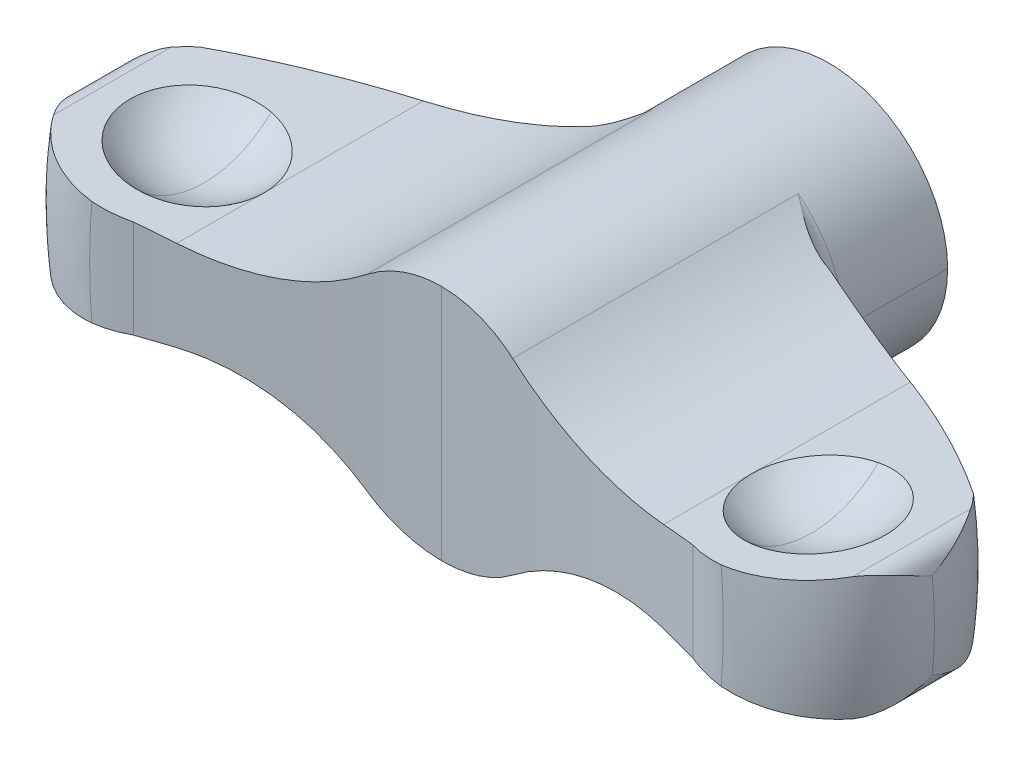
ISO-10303-21;
HEADER;
FILE_DESCRIPTION(('STEP AP214'),'2;1');
FILE_NAME('part.step','',(''),(''),'','','');
FILE_SCHEMA(('AUTOMOTIVE_DESIGN { 1 0 10303 214 1 1 1 1 }'));
ENDSEC;
DATA;
#1=APPLICATION_CONTEXT('core data for automotive mechanical design processes');
#2=APPLICATION_PROTOCOL_DEFINITION('international standard','automotive_design',2000,#1);
#3=PRODUCT_CONTEXT('',#1,'mechanical');
#4=PRODUCT('Part','Part','',(#3));
#5=PRODUCT_RELATED_PRODUCT_CATEGORY('part','',(#4));
#6=PRODUCT_DEFINITION_FORMATION('','',#4);
#7=PRODUCT_DEFINITION_CONTEXT('part definition',#1,'design');
#8=PRODUCT_DEFINITION('design','',#6,#7);
#9=PRODUCT_DEFINITION_SHAPE('','',#8);
#10=(LENGTH_UNIT() NAMED_UNIT(*) SI_UNIT(.MILLI.,.METRE.));
#11=(NAMED_UNIT(*) PLANE_ANGLE_UNIT() SI_UNIT($,.RADIAN.));
#12=(NAMED_UNIT(*) SI_UNIT($,.STERADIAN.) SOLID_ANGLE_UNIT());
#13=UNCERTAINTY_MEASURE_WITH_UNIT(LENGTH_MEASURE(1.E-05),#10,'distance_accuracy_value','');
#14=(GEOMETRIC_REPRESENTATION_CONTEXT(3) GLOBAL_UNCERTAINTY_ASSIGNED_CONTEXT((#13)) GLOBAL_UNIT_ASSIGNED_CONTEXT((#10,
#11,#12)) REPRESENTATION_CONTEXT('',''));
#15=CARTESIAN_POINT('',(0.,0.,0.));
#16=DIRECTION('',(0.,0.,1.));
#17=DIRECTION('',(1.,0.,0.));
#18=AXIS2_PLACEMENT_3D('',#15,#16,#17);
#19=CARTESIAN_POINT('',(0.,0.,18.));
#20=DIRECTION('',(0.,0.,-1.));
#21=DIRECTION('',(0.,1.,0.));
#22=AXIS2_PLACEMENT_3D('',#19,#20,#21);
#23=TOROIDAL_SURFACE('',#22,18.,6.);
#24=CARTESIAN_POINT('',(-21.977730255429,-3.4226360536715,13.7573593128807));
#25=CARTESIAN_POINT('',(-22.1148980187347,-3.43705296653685,13.8951719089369));
#26=CARTESIAN_POINT('',(-22.2448209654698,-3.4507084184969,14.0389827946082));
#27=CARTESIAN_POINT('',(-22.4901772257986,-3.47649640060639,14.3386011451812));
#28=CARTESIAN_POINT('',(-22.6056105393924,-3.48862893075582,14.4944086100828));
#29=CARTESIAN_POINT('',(-22.7137990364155,-3.49999999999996,14.6562143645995));
#30=B_SPLINE_CURVE_WITH_KNOTS('',3,(#24,#25,#26,#27,#28,#29),.UNSPECIFIED.,.F.,.F.,(4,2,4),(0.,
0.582865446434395,1.16573089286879),.UNSPECIFIED.);
#31=CARTESIAN_POINT('',(-21.977730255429,-3.4226360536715,13.7573593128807));
#32=VERTEX_POINT('',#31);
#33=CARTESIAN_POINT('',(-22.7137990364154,-3.5,14.6562143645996));
#34=VERTEX_POINT('',#33);
#35=EDGE_CURVE('E245',#32,#34,#30,.T.);
#36=ORIENTED_EDGE('',*,*,#35,.T.);
#37=CARTESIAN_POINT('',(-22.7137990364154,-3.49999999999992,14.6562143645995));
#38=CARTESIAN_POINT('',(-22.7337448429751,-3.49999809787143,14.6855840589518));
#39=CARTESIAN_POINT('',(-22.7534820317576,-3.49948399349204,14.7150931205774));
#40=CARTESIAN_POINT('',(-22.7930491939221,-3.49746578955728,14.7751706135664));
#41=CARTESIAN_POINT('',(-22.8128671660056,-3.49593521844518,14.8057460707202));
#42=CARTESIAN_POINT('',(-22.8525506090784,-3.49187049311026,14.8679711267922));
#43=CARTESIAN_POINT('',(-22.8724028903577,-3.48931033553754,14.899627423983));
#44=CARTESIAN_POINT('',(-22.9121080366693,-3.48317090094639,14.9640274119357));
#45=CARTESIAN_POINT('',(-22.93194657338,-3.47956607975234,14.9967774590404));
#46=CARTESIAN_POINT('',(-22.9921814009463,-3.46703764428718,15.098009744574));
#47=CARTESIAN_POINT('',(-23.0316323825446,-3.45657528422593,15.1668705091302));
#48=CARTESIAN_POINT('',(-23.1099900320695,-3.4314908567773,15.3090592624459));
#49=CARTESIAN_POINT('',(-23.1487563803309,-3.41667729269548,15.3824301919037));
#50=CARTESIAN_POINT('',(-23.2181157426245,-3.38596509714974,15.5195051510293));
#51=CARTESIAN_POINT('',(-23.249091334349,-3.37051233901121,15.5831169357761));
#52=CARTESIAN_POINT('',(-23.3104529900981,-3.33652607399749,15.7142089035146));
#53=CARTESIAN_POINT('',(-23.3407188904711,-3.31787198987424,15.7817140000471));
#54=CARTESIAN_POINT('',(-23.4002954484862,-3.27739846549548,15.9206320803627));
#55=CARTESIAN_POINT('',(-23.4294767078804,-3.25546550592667,15.9920673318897));
#56=CARTESIAN_POINT('',(-23.4864947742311,-3.20836495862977,16.1388719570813));
#57=CARTESIAN_POINT('',(-23.5141933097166,-3.183090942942,16.214260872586));
#58=CARTESIAN_POINT('',(-23.5623040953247,-3.13476960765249,16.3530161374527));
#59=CARTESIAN_POINT('',(-23.5831675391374,-3.11203272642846,16.416335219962));
#60=CARTESIAN_POINT('',(-23.6243043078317,-3.06353993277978,16.5480431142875));
#61=CARTESIAN_POINT('',(-23.6444097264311,-3.03768620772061,16.616448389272));
#62=CARTESIAN_POINT('',(-23.6835194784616,-2.98287692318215,16.7583576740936));
#63=CARTESIAN_POINT('',(-23.7023425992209,-2.95383170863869,16.8318768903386));
#64=CARTESIAN_POINT('',(-23.73833490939,-2.89259496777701,16.9840331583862));
#65=CARTESIAN_POINT('',(-23.7553095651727,-2.86032288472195,17.0626839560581));
#66=CARTESIAN_POINT('',(-23.7810371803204,-2.80525234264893,17.1943835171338));
#67=CARTESIAN_POINT('',(-23.7906651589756,-2.7828003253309,17.2474085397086));
#68=CARTESIAN_POINT('',(-23.810519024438,-2.73222392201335,17.3657769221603));
#69=CARTESIAN_POINT('',(-23.8203691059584,-2.70398748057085,17.431135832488));
#70=CARTESIAN_POINT('',(-23.8394872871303,-2.64170079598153,17.5742249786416));
#71=CARTESIAN_POINT('',(-23.848299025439,-2.60755421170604,17.6519743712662));
#72=CARTESIAN_POINT('',(-23.8639224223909,-2.53327674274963,17.819818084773));
#73=CARTESIAN_POINT('',(-23.8701979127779,-2.49305295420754,17.9099215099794));
#74=CARTESIAN_POINT('',(-23.8743581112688,-2.45255474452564,18.));
#75=B_SPLINE_CURVE_WITH_KNOTS('',3,(#37,#38,#39,#40,#41,#42,#43,#44,#45,#46,#47,#48,#49,#50,#51,
#52,#53,#54,#55,#56,#57,#58,#59,#60,#61,#62,#63,#64,#65,#66,#67,#68,#69,#70,#71,#72,#73,#74),
.UNSPECIFIED.,.F.,.F.,(4,2,2,2,2,2,2,2,2,2,2,2,2,2,2,2,2,2,4),(0.,0.106499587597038,
0.215887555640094,0.328231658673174,0.443595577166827,0.68359398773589,0.936345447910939,
1.1535372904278,1.3823468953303,1.62293629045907,1.87544734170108,2.08672005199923,
2.3141921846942,2.55791147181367,2.81791458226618,2.99304229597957,3.20863194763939,
3.46469242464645,3.76122005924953),.UNSPECIFIED.);
#76=CARTESIAN_POINT('',(-23.8743581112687,-2.45255474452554,18.));
#77=VERTEX_POINT('',#76);
#78=EDGE_CURVE('E257',#77,#34,#75,.F.);
#79=ORIENTED_EDGE('',*,*,#78,.F.);
#80=CARTESIAN_POINT('',(0.,0.,18.));
#81=DIRECTION('',(0.,0.,-1.));
#82=DIRECTION('',(0.,1.,0.));
#83=AXIS2_PLACEMENT_3D('',#80,#81,#82);
#84=CIRCLE('',#83,24.);
#85=CARTESIAN_POINT('',(-23.8743581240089,2.45255462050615,18.));
#86=VERTEX_POINT('',#85);
#87=EDGE_CURVE('E685',#86,#77,#84,.F.);
#88=ORIENTED_EDGE('',*,*,#87,.F.);
#89=CARTESIAN_POINT('',(-23.874358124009,2.45255462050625,18.));
#90=CARTESIAN_POINT('',(-23.8701995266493,2.49303723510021,17.9099576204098));
#91=CARTESIAN_POINT('',(-23.8639273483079,2.53324548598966,17.8198902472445));
#92=CARTESIAN_POINT('',(-23.8483115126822,2.60750265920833,17.6520944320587));
#93=CARTESIAN_POINT('',(-23.8395028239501,2.64164431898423,17.5743569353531));
#94=CARTESIAN_POINT('',(-23.8203882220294,2.70393144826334,17.4312674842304));
#95=CARTESIAN_POINT('',(-23.8105377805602,2.73217311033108,17.3658964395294));
#96=CARTESIAN_POINT('',(-23.7906781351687,2.78277017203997,17.2474800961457));
#97=CARTESIAN_POINT('',(-23.7810441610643,2.80523740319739,17.1944192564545));
#98=CARTESIAN_POINT('',(-23.755311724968,2.860318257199,17.0626950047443));
#99=CARTESIAN_POINT('',(-23.7383396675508,2.89258614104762,16.9840553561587));
#100=CARTESIAN_POINT('',(-23.7023517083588,2.95381735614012,16.8319137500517));
#101=CARTESIAN_POINT('',(-23.6835300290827,2.9828611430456,16.7583980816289));
#102=CARTESIAN_POINT('',(-23.6444213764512,3.03767054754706,16.616488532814));
#103=CARTESIAN_POINT('',(-23.6243153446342,3.0635256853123,16.5480794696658));
#104=CARTESIAN_POINT('',(-23.5831747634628,3.11202436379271,16.4163569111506));
#105=CARTESIAN_POINT('',(-23.5623078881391,3.13476554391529,16.3530269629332));
#106=CARTESIAN_POINT('',(-23.5141971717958,3.18308736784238,16.2142721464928));
#107=CARTESIAN_POINT('',(-23.4865029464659,3.20835813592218,16.1388944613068));
#108=CARTESIAN_POINT('',(-23.4294915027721,3.25545451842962,15.9921044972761));
#109=CARTESIAN_POINT('',(-23.4003122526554,3.27738636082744,15.9206727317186));
#110=CARTESIAN_POINT('',(-23.3407368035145,3.31786002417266,15.7817542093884));
#111=CARTESIAN_POINT('',(-23.3104697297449,3.33651512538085,15.7142452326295));
#112=CARTESIAN_POINT('',(-23.2491019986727,3.37050600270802,15.5831385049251));
#113=CARTESIAN_POINT('',(-23.218121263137,3.38596206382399,15.5195158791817));
#114=CARTESIAN_POINT('',(-23.1487585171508,3.41667703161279,15.3824346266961));
#115=CARTESIAN_POINT('',(-23.1099944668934,3.4314907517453,15.3090681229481));
#116=CARTESIAN_POINT('',(-23.0316402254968,3.45657531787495,15.1668850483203));
#117=CARTESIAN_POINT('',(-22.9921902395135,3.46703756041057,15.0980255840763));
#118=CARTESIAN_POINT('',(-22.9319563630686,3.47956590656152,14.9967941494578));
#119=CARTESIAN_POINT('',(-22.9121177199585,3.48317074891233,14.9640436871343));
#120=CARTESIAN_POINT('',(-22.8724119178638,3.48931023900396,14.8996421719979));
#121=CARTESIAN_POINT('',(-22.8525590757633,3.49187041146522,14.867984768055));
#122=CARTESIAN_POINT('',(-22.8128740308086,3.49593518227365,14.8057568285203));
#123=CARTESIAN_POINT('',(-22.793055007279,3.49746576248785,14.7751795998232));
#124=CARTESIAN_POINT('',(-22.7534852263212,3.49948399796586,14.7150979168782));
#125=CARTESIAN_POINT('',(-22.7337464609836,3.49999810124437,14.6855864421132));
#126=CARTESIAN_POINT('',(-22.7137990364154,3.49999999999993,14.6562143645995));
#127=B_SPLINE_CURVE_WITH_KNOTS('',3,(#89,#90,#91,#92,#93,#94,#95,#96,#97,#98,#99,#100,#101,#102,
#103,#104,#105,#106,#107,#108,#109,#110,#111,#112,#113,#114,#115,#116,#117,#118,#119,#120,#121,
#122,#123,#124,#125,#126),.UNSPECIFIED.,.F.,.F.,(4,2,2,2,2,2,2,2,2,2,2,2,2,2,2,2,2,2,4),(0.,
0.296409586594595,0.552430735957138,0.768059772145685,0.943305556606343,1.20327214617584,
1.44697927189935,1.67446358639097,1.88577279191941,2.13824653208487,2.37882350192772,
2.6076455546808,2.82487466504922,3.07761148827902,3.31760499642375,3.43297014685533,
3.54531794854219,3.65471208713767,3.76122031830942),.UNSPECIFIED.);
#128=CARTESIAN_POINT('',(-22.7137990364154,3.5,14.6562143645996));
#129=VERTEX_POINT('',#128);
#130=EDGE_CURVE('E1509',#129,#86,#127,.F.);
#131=ORIENTED_EDGE('',*,*,#130,.F.);
#132=CARTESIAN_POINT('',(-22.7137990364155,3.5,14.6562143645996));
#133=CARTESIAN_POINT('',(-22.6056105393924,3.48862893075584,14.4944086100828));
#134=CARTESIAN_POINT('',(-22.4901772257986,3.47649640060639,14.3386011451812));
#135=CARTESIAN_POINT('',(-22.2448209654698,3.45070841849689,14.0389827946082));
#136=CARTESIAN_POINT('',(-22.1148980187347,3.43705296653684,13.8951719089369));
#137=CARTESIAN_POINT('',(-21.977730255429,3.4226360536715,13.7573593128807));
#138=B_SPLINE_CURVE_WITH_KNOTS('',3,(#132,#133,#134,#135,#136,#137),.UNSPECIFIED.,.F.,.F.,(4,2,
4),(0.,0.582865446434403,1.16573089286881),.UNSPECIFIED.);
#139=CARTESIAN_POINT('',(-21.977730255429,3.42263605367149,13.7573593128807));
#140=VERTEX_POINT('',#139);
#141=EDGE_CURVE('E258',#129,#140,#138,.T.);
#142=ORIENTED_EDGE('',*,*,#141,.T.);
#143=CARTESIAN_POINT('',(0.,0.,13.7573593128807));
#144=DIRECTION('',(0.,0.,-1.));
#145=DIRECTION('',(0.,1.,0.));
#146=AXIS2_PLACEMENT_3D('',#143,#144,#145);
#147=CIRCLE('',#146,22.2426406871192);
#148=EDGE_CURVE('E262',#32,#140,#147,.T.);
#149=ORIENTED_EDGE('',*,*,#148,.F.);
#150=EDGE_LOOP('',(#36,#79,#88,#131,#142,#149));
#151=FACE_BOUND('',#150,.T.);
#152=ADVANCED_FACE('F15',(#151),#23,.T.);
#153=CARTESIAN_POINT('',(-22.7137990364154,-2.33333333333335,0.));
#154=DIRECTION('',(0.,0.,-1.));
#155=DIRECTION('',(0.,1.,0.));
#156=AXIS2_PLACEMENT_3D('',#153,#154,#155);
#157=CYLINDRICAL_SURFACE('',#156,1.16666666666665);
#158=ORIENTED_EDGE('',*,*,#78,.T.);
#159=DIRECTION('',(0.,0.,1.));
#160=VECTOR('',#159,1.);
#161=CARTESIAN_POINT('',(-22.7137990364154,-3.5,0.));
#162=LINE('',#161,#160);
#163=CARTESIAN_POINT('',(-22.7137990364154,-3.5,21.3437856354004));
#164=VERTEX_POINT('',#163);
#165=EDGE_CURVE('E253',#34,#164,#162,.T.);
#166=ORIENTED_EDGE('',*,*,#165,.T.);
#167=CARTESIAN_POINT('',(-23.8743581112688,-2.45255474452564,18.));
#168=CARTESIAN_POINT('',(-23.8701982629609,-2.4930495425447,18.0900709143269));
#169=CARTESIAN_POINT('',(-23.8639234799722,-2.53326995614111,18.1801667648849));
#170=CARTESIAN_POINT('',(-23.8483016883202,-2.6075430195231,18.3480004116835));
#171=CARTESIAN_POINT('',(-23.8394905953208,-2.64168853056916,18.425747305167));
#172=CARTESIAN_POINT('',(-23.8203731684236,-2.70397529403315,18.5688365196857));
#173=CARTESIAN_POINT('',(-23.8105230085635,-2.73221284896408,18.6341979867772));
#174=CARTESIAN_POINT('',(-23.7906679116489,-2.78279375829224,18.7525764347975));
#175=CARTESIAN_POINT('',(-23.7810386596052,-2.80524909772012,18.8056089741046));
#176=CARTESIAN_POINT('',(-23.7553117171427,-2.86031839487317,18.9373049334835));
#177=CARTESIAN_POINT('',(-23.7383396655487,-2.89258617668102,19.0159446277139));
#178=CARTESIAN_POINT('',(-23.7023517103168,-2.95381732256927,19.1680862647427));
#179=CARTESIAN_POINT('',(-23.6835300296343,-2.98286113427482,19.2416019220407));
#180=CARTESIAN_POINT('',(-23.6444213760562,-3.03767055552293,19.3835114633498));
#181=CARTESIAN_POINT('',(-23.6243153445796,-3.06352568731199,19.4519205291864));
#182=CARTESIAN_POINT('',(-23.5831747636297,-3.11202436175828,19.5836430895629));
#183=CARTESIAN_POINT('',(-23.5623078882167,-3.13476554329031,19.6469730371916));
#184=CARTESIAN_POINT('',(-23.5141971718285,-3.18308736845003,19.7857278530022));
#185=CARTESIAN_POINT('',(-23.4865029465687,-3.20835813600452,19.8611055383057));
#186=CARTESIAN_POINT('',(-23.4294915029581,-3.25545451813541,20.0078955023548));
#187=CARTESIAN_POINT('',(-23.4003122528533,-3.27738636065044,20.0793272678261));
#188=CARTESIAN_POINT('',(-23.3407368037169,-3.3178600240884,20.2182457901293));
#189=CARTESIAN_POINT('',(-23.3104697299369,-3.33651512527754,20.2857547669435));
#190=CARTESIAN_POINT('',(-23.2491019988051,-3.37050600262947,20.416861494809));
#191=CARTESIAN_POINT('',(-23.2181212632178,-3.38596206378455,20.4804841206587));
#192=CARTESIAN_POINT('',(-23.1487585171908,-3.41667703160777,20.6175653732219));
#193=CARTESIAN_POINT('',(-23.1099944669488,-3.43149075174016,20.6909318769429));
#194=CARTESIAN_POINT('',(-23.0316402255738,-3.45657531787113,20.8331149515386));
#195=CARTESIAN_POINT('',(-22.9921902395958,-3.46703756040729,20.9019744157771));
#196=CARTESIAN_POINT('',(-22.9319563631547,-3.47956590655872,21.0032058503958));
#197=CARTESIAN_POINT('',(-22.9121177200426,-3.4831707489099,21.0359563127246));
#198=CARTESIAN_POINT('',(-22.8724119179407,-3.48931023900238,21.1003578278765));
#199=CARTESIAN_POINT('',(-22.852559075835,-3.49187041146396,21.1320152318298));
#200=CARTESIAN_POINT('',(-22.8128740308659,-3.49593518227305,21.19424317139));
#201=CARTESIAN_POINT('',(-22.7930550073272,-3.49746576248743,21.2248204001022));
#202=CARTESIAN_POINT('',(-22.7534852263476,-3.49948399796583,21.2849020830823));
#203=CARTESIAN_POINT('',(-22.733746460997,-3.49999810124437,21.3144135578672));
#204=CARTESIAN_POINT('',(-22.7137990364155,-3.49999999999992,21.3437856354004));
#205=B_SPLINE_CURVE_WITH_KNOTS('',3,(#167,#168,#169,#170,#171,#172,#173,#174,#175,#176,#177,
#178,#179,#180,#181,#182,#183,#184,#185,#186,#187,#188,#189,#190,#191,#192,#193,#194,#195,#196,
#197,#198,#199,#200,#201,#202,#203,#204),.UNSPECIFIED.,.F.,.F.,(4,2,2,2,2,2,2,2,2,2,2,2,2,2,2,2,
2,2,4),(0.,0.296502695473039,0.552554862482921,0.768152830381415,0.943305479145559,
1.20327206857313,1.44697919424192,1.67446350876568,1.88577271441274,2.13824645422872,
2.37882342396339,2.60764547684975,2.82487458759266,3.07761141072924,3.31760491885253,
3.43297006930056,3.54531787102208,3.65471200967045,3.76122024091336),.UNSPECIFIED.);
#206=EDGE_CURVE('E646',#77,#164,#205,.T.);
#207=ORIENTED_EDGE('',*,*,#206,.F.);
#208=EDGE_LOOP('',(#158,#166,#207));
#209=FACE_BOUND('',#208,.T.);
#210=ADVANCED_FACE('F712',(#209),#157,.T.);
#211=CARTESIAN_POINT('',(-17.25,-6.75,18.25));
#212=DIRECTION('',(0.,0.,1.));
#213=DIRECTION('',(1.,0.,0.));
#214=AXIS2_PLACEMENT_3D('',#211,#212,#213);
#215=SPHERICAL_SURFACE('',#214,5.4);
#216=CARTESIAN_POINT('',(-17.25,-6.75,18.25));
#217=DIRECTION('',(-1.,0.,0.));
#218=DIRECTION('',(0.,0.,1.));
#219=AXIS2_PLACEMENT_3D('',#216,#217,#218);
#220=CIRCLE('',#219,5.4);
#221=CARTESIAN_POINT('',(-17.25,-1.35,18.25));
#222=VERTEX_POINT('',#221);
#223=CARTESIAN_POINT('',(-17.25,-2.92573158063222,22.062475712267));
#224=VERTEX_POINT('',#223);
#225=EDGE_CURVE('E699',#222,#224,#220,.F.);
#226=ORIENTED_EDGE('',*,*,#225,.T.);
#227=CARTESIAN_POINT('',(-17.25,-2.92573158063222,22.062475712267));
#228=CARTESIAN_POINT('',(-17.3566407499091,-2.93693997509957,22.0737291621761));
#229=CARTESIAN_POINT('',(-17.4637505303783,-2.94819766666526,22.0804377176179));
#230=CARTESIAN_POINT('',(-17.6781466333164,-2.97073160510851,22.0847651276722));
#231=CARTESIAN_POINT('',(-17.7854329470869,-2.98200785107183,22.0823844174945));
#232=CARTESIAN_POINT('',(-17.9993557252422,-3.00449204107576,22.0685393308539));
#233=CARTESIAN_POINT('',(-18.1059925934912,-3.0157000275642,22.0570813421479));
#234=CARTESIAN_POINT('',(-18.317899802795,-3.03797237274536,22.0251903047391));
#235=CARTESIAN_POINT('',(-18.4231701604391,-3.04903673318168,22.0047573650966));
#236=CARTESIAN_POINT('',(-18.7359174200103,-3.08190779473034,21.9301450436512));
#237=CARTESIAN_POINT('',(-18.9404210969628,-3.10340199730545,21.8626462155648));
#238=CARTESIAN_POINT('',(-19.3351018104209,-3.14488461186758,21.6941292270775));
#239=CARTESIAN_POINT('',(-19.5252816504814,-3.1648733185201,21.5931176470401));
#240=CARTESIAN_POINT('',(-19.8861130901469,-3.20279823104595,21.3604156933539));
#241=CARTESIAN_POINT('',(-20.0567642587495,-3.22073439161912,21.2287246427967));
#242=CARTESIAN_POINT('',(-20.3736745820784,-3.2540430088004,20.9383859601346));
#243=CARTESIAN_POINT('',(-20.5199300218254,-3.26941507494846,20.7797342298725));
#244=CARTESIAN_POINT('',(-20.7838696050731,-3.29715624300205,20.4399985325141));
#245=CARTESIAN_POINT('',(-20.9015550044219,-3.30952547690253,20.2589155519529));
#246=CARTESIAN_POINT('',(-21.1050125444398,-3.33090972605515,19.8794651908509));
#247=CARTESIAN_POINT('',(-21.1907867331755,-3.33992495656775,19.6810989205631));
#248=CARTESIAN_POINT('',(-21.3279998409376,-3.35434663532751,19.2726986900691));
#249=CARTESIAN_POINT('',(-21.3794381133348,-3.35975301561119,19.0626645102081));
#250=CARTESIAN_POINT('',(-21.4465173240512,-3.36680332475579,18.6368883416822));
#251=CARTESIAN_POINT('',(-21.462157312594,-3.36844715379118,18.421146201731));
#252=CARTESIAN_POINT('',(-21.4571932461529,-3.36792540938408,17.9900840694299));
#253=CARTESIAN_POINT('',(-21.4365892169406,-3.36575983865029,17.7747640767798));
#254=CARTESIAN_POINT('',(-21.3597229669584,-3.35768087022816,17.3506638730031));
#255=CARTESIAN_POINT('',(-21.3034616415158,-3.35176756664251,17.1418834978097));
#256=CARTESIAN_POINT('',(-21.156880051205,-3.33636122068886,16.7367865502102));
#257=CARTESIAN_POINT('',(-21.0665603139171,-3.3268682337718,16.5404697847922));
#258=CARTESIAN_POINT('',(-20.8544187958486,-3.30457126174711,16.1658584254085));
#259=CARTESIAN_POINT('',(-20.7325952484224,-3.29176709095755,15.9875648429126));
#260=CARTESIAN_POINT('',(-20.4609056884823,-3.26321136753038,15.6540690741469));
#261=CARTESIAN_POINT('',(-20.3110388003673,-3.24745972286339,15.4988676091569));
#262=CARTESIAN_POINT('',(-19.9875278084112,-3.21345734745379,15.2159844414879));
#263=CARTESIAN_POINT('',(-19.8138865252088,-3.19520691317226,15.0882994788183));
#264=CARTESIAN_POINT('',(-19.447779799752,-3.1567275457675,14.8640526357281));
#265=CARTESIAN_POINT('',(-19.2553139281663,-3.13649856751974,14.767491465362));
#266=CARTESIAN_POINT('',(-18.8568521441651,-3.0946185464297,14.6082122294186));
#267=CARTESIAN_POINT('',(-18.6508552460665,-3.07296739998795,14.5454966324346));
#268=CARTESIAN_POINT('',(-18.3436575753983,-3.04067962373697,14.4797242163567));
#269=CARTESIAN_POINT('',(-18.2452279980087,-3.03033425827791,14.4626927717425));
#270=CARTESIAN_POINT('',(-18.0473221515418,-3.00953351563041,14.4364394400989));
#271=CARTESIAN_POINT('',(-17.9478459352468,-2.99907814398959,14.4272171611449));
#272=CARTESIAN_POINT('',(-17.7484767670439,-2.97812360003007,14.4166533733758));
#273=CARTESIAN_POINT('',(-17.6485837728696,-2.96762442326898,14.4153126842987));
#274=CARTESIAN_POINT('',(-17.4489917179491,-2.94664645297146,14.4205097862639));
#275=CARTESIAN_POINT('',(-17.3492926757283,-2.93616766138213,14.4270482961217));
#276=CARTESIAN_POINT('',(-17.25,-2.92573158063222,14.4375242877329));
#277=B_SPLINE_CURVE_WITH_KNOTS('',3,(#227,#228,#229,#230,#231,#232,#233,#234,#235,#236,#237,
#238,#239,#240,#241,#242,#243,#244,#245,#246,#247,#248,#249,#250,#251,#252,#253,#254,#255,#256,
#257,#258,#259,#260,#261,#262,#263,#264,#265,#266,#267,#268,#269,#270,#271,#272,#273,#274,#275,
#276),.UNSPECIFIED.,.F.,.F.,(4,2,2,2,2,2,2,2,2,2,2,2,2,2,2,2,2,2,2,2,2,2,2,2,4),(0.,
0.323345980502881,0.646676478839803,0.96977964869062,1.29287889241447,1.93880698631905,
2.58460832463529,3.23042391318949,3.87633775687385,4.52222320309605,5.16806718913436,
5.81392333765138,6.4597966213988,7.10566944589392,7.75152605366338,8.39737265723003,
9.04325548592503,9.68915848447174,10.3349849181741,10.9808260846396,11.6267143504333,
11.9277483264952,12.2287671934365,12.5298173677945,12.8308950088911),.UNSPECIFIED.);
#278=CARTESIAN_POINT('',(-17.25,-2.92573158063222,14.4375242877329));
#279=VERTEX_POINT('',#278);
#280=EDGE_CURVE('E716',#224,#279,#277,.T.);
#281=ORIENTED_EDGE('',*,*,#280,.T.);
#282=CARTESIAN_POINT('',(-17.25,-6.75,18.25));
#283=DIRECTION('',(-1.,0.,0.));
#284=DIRECTION('',(0.,0.,1.));
#285=AXIS2_PLACEMENT_3D('',#282,#283,#284);
#286=CIRCLE('',#285,5.4);
#287=EDGE_CURVE('E693',#279,#222,#286,.F.);
#288=ORIENTED_EDGE('',*,*,#287,.T.);
#289=EDGE_LOOP('',(#226,#281,#288));
#290=FACE_BOUND('',#289,.T.);
#291=ADVANCED_FACE('F709',(#290),#215,.F.);
#292=CARTESIAN_POINT('',(-17.25,-6.75,18.25));
#293=DIRECTION('',(0.,0.,1.));
#294=DIRECTION('',(1.,0.,0.));
#295=AXIS2_PLACEMENT_3D('',#292,#293,#294);
#296=SPHERICAL_SURFACE('',#295,5.4);
#297=CARTESIAN_POINT('',(-17.25,-2.92573158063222,14.4375242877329));
#298=CARTESIAN_POINT('',(-17.1433574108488,-2.91452299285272,14.4487571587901));
#299=CARTESIAN_POINT('',(-17.0371935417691,-2.90336472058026,14.464533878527));
#300=CARTESIAN_POINT('',(-16.8265681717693,-2.88122710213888,14.5050161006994));
#301=CARTESIAN_POINT('',(-16.7221065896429,-2.87024774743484,14.529721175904));
#302=CARTESIAN_POINT('',(-16.5156923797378,-2.8485527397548,14.5878820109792));
#303=CARTESIAN_POINT('',(-16.4137380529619,-2.83783690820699,14.6213316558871));
#304=CARTESIAN_POINT('',(-16.2130176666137,-2.81674034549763,14.6967258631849));
#305=CARTESIAN_POINT('',(-16.114251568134,-2.80635961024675,14.7386703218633));
#306=CARTESIAN_POINT('',(-15.8236921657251,-2.77582058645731,14.8768908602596));
#307=CARTESIAN_POINT('',(-15.63755544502,-2.75625682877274,14.9855773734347));
#308=CARTESIAN_POINT('',(-15.2862224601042,-2.71933024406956,15.2327482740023));
#309=CARTESIAN_POINT('',(-15.1210209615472,-2.70196686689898,15.3712251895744));
#310=CARTESIAN_POINT('',(-14.8160669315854,-2.66991490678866,15.6740954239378));
#311=CARTESIAN_POINT('',(-14.676311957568,-2.65522606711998,15.8384862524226));
#312=CARTESIAN_POINT('',(-14.4261783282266,-2.62893596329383,16.1886069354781));
#313=CARTESIAN_POINT('',(-14.315812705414,-2.6173360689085,16.3743462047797));
#314=CARTESIAN_POINT('',(-14.127617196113,-2.59755592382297,16.7618844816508));
#315=CARTESIAN_POINT('',(-14.0498041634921,-2.58937744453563,16.9636917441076));
#316=CARTESIAN_POINT('',(-13.9290924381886,-2.57669013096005,17.3774240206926));
#317=CARTESIAN_POINT('',(-13.8861423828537,-2.57217589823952,17.589333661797));
#318=CARTESIAN_POINT('',(-13.8525068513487,-2.56864066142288,17.8773186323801));
#319=CARTESIAN_POINT('',(-13.8460058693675,-2.56795738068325,17.9517714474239));
#320=CARTESIAN_POINT('',(-13.8373477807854,-2.56704737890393,18.1008056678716));
#321=CARTESIAN_POINT('',(-13.8351833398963,-2.56681988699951,18.1753866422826));
#322=CARTESIAN_POINT('',(-13.8351792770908,-2.56681945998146,18.25));
#323=B_SPLINE_CURVE_WITH_KNOTS('',3,(#297,#298,#299,#300,#301,#302,#303,#304,#305,#306,#307,
#308,#309,#310,#311,#312,#313,#314,#315,#316,#317,#318,#319,#320,#321,#322),.UNSPECIFIED.,.F.,
.F.,(4,2,2,2,2,2,2,2,2,2,2,2,4),(0.,0.323345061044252,0.646674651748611,0.969778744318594,
1.29287889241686,1.93882452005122,2.58460832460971,3.23033010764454,3.87633775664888,
4.52267945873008,5.16806718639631,5.39219018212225,5.61593380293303),.UNSPECIFIED.);
#324=CARTESIAN_POINT('',(-13.8351792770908,-2.56681945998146,18.25));
#325=VERTEX_POINT('',#324);
#326=EDGE_CURVE('E724',#279,#325,#323,.T.);
#327=ORIENTED_EDGE('',*,*,#326,.T.);
#328=CARTESIAN_POINT('',(-13.8351792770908,-2.56681945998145,18.25));
#329=CARTESIAN_POINT('',(-13.8351690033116,-2.56681838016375,18.3578167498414));
#330=CARTESIAN_POINT('',(-13.8397029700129,-2.56729491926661,18.4656286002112));
#331=CARTESIAN_POINT('',(-13.8577798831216,-2.56919487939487,18.6804809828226));
#332=CARTESIAN_POINT('',(-13.8713223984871,-2.57061825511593,18.7875215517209));
#333=CARTESIAN_POINT('',(-13.9073243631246,-2.57440221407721,19.0000061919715));
#334=CARTESIAN_POINT('',(-13.9297775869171,-2.57676214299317,19.1054513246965));
#335=CARTESIAN_POINT('',(-13.9834188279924,-2.5824000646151,19.3140390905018));
#336=CARTESIAN_POINT('',(-14.014606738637,-2.58567804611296,19.4171817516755));
#337=CARTESIAN_POINT('',(-14.1210210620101,-2.59686264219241,19.7221624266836));
#338=CARTESIAN_POINT('',(-14.2091125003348,-2.60612142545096,19.9196378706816));
#339=CARTESIAN_POINT('',(-14.4169521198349,-2.62796624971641,20.2967550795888));
#340=CARTESIAN_POINT('',(-14.5366923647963,-2.64055145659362,20.4764012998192));
#341=CARTESIAN_POINT('',(-14.8044605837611,-2.66869503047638,20.8129466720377));
#342=CARTESIAN_POINT('',(-14.9524858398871,-2.68425311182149,20.969848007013));
#343=CARTESIAN_POINT('',(-15.2727061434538,-2.7179096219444,21.2564988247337));
#344=CARTESIAN_POINT('',(-15.4449118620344,-2.7360091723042,21.3862362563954));
#345=CARTESIAN_POINT('',(-15.8086008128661,-2.77423442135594,21.6148492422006));
#346=CARTESIAN_POINT('',(-16.0000939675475,-2.79436116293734,21.7137088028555));
#347=CARTESIAN_POINT('',(-16.3967286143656,-2.83604914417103,21.8775677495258));
#348=CARTESIAN_POINT('',(-16.6018495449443,-2.85760822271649,21.9426168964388));
#349=CARTESIAN_POINT('',(-16.8831878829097,-2.88717807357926,22.0062844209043));
#350=CARTESIAN_POINT('',(-16.9561512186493,-2.8948468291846,22.0205495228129));
#351=CARTESIAN_POINT('',(-17.1026580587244,-2.91024531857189,22.0447491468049));
#352=CARTESIAN_POINT('',(-17.1762003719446,-2.91797492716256,22.0546909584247));
#353=CARTESIAN_POINT('',(-17.25,-2.92573158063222,22.062475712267));
#354=B_SPLINE_CURVE_WITH_KNOTS('',3,(#328,#329,#330,#331,#332,#333,#334,#335,#336,#337,#338,
#339,#340,#341,#342,#343,#344,#345,#346,#347,#348,#349,#350,#351,#352,#353),.UNSPECIFIED.,.F.,
.F.,(4,2,2,2,2,2,2,2,2,2,2,2,4),(0.,0.323345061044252,0.646674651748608,0.969778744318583,
1.29287889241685,1.9388245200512,2.58460832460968,3.23033010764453,3.87633775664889,
4.5226794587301,5.16806718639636,5.39219018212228,5.61593380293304),.UNSPECIFIED.);
#355=EDGE_CURVE('E725',#325,#224,#354,.T.);
#356=ORIENTED_EDGE('',*,*,#355,.T.);
#357=ORIENTED_EDGE('',*,*,#225,.F.);
#358=ORIENTED_EDGE('',*,*,#287,.F.);
#359=EDGE_LOOP('',(#327,#356,#357,#358));
#360=FACE_BOUND('',#359,.T.);
#361=ADVANCED_FACE('F627',(#360),#296,.F.);
#362=CARTESIAN_POINT('',(0.,0.,18.));
#363=DIRECTION('',(0.,0.,-1.));
#364=DIRECTION('',(0.,1.,0.));
#365=AXIS2_PLACEMENT_3D('',#362,#363,#364);
#366=TOROIDAL_SURFACE('',#365,18.,6.);
#367=CARTESIAN_POINT('',(-17.8757076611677,2.99149610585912,23.9987124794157));
#368=CARTESIAN_POINT('',(-18.0439542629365,3.00917953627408,23.9952318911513));
#369=CARTESIAN_POINT('',(-18.2120514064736,3.02684725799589,23.9845859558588));
#370=CARTESIAN_POINT('',(-18.5467541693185,3.06202593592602,23.9491139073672));
#371=CARTESIAN_POINT('',(-18.7133598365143,3.07953689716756,23.9242882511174));
#372=CARTESIAN_POINT('',(-19.0437271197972,3.11425989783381,23.8606399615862));
#373=CARTESIAN_POINT('',(-19.2074914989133,3.13147222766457,23.8218318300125));
#374=CARTESIAN_POINT('',(-19.5311857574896,3.16549386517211,23.730491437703));
#375=CARTESIAN_POINT('',(-19.6911157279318,3.18230318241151,23.6779595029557));
#376=CARTESIAN_POINT('',(-20.0061065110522,3.21541004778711,23.5595000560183));
#377=CARTESIAN_POINT('',(-20.1611641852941,3.23170726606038,23.4935641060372));
#378=CARTESIAN_POINT('',(-20.4652571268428,3.26366872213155,23.3487536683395));
#379=CARTESIAN_POINT('',(-20.6142900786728,3.27933271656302,23.2698742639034));
#380=CARTESIAN_POINT('',(-20.9050901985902,3.3098970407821,23.0998205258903));
#381=CARTESIAN_POINT('',(-21.0468629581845,3.32479795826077,23.0086558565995));
#382=CARTESIAN_POINT('',(-21.3223050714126,3.35374809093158,22.8145922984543));
#383=CARTESIAN_POINT('',(-21.4559718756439,3.36779703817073,22.7116897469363));
#384=CARTESIAN_POINT('',(-21.693287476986,3.3927399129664,22.5124611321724));
#385=CARTESIAN_POINT('',(-21.7982943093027,3.4037765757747,22.4177640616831));
#386=CARTESIAN_POINT('',(-22.0013794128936,3.42512168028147,22.2211347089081));
#387=CARTESIAN_POINT('',(-22.0994579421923,3.4354301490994,22.1192026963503));
#388=CARTESIAN_POINT('',(-22.2882075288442,3.45526853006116,21.9085914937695));
#389=CARTESIAN_POINT('',(-22.3788771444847,3.46479829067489,21.7999109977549));
#390=CARTESIAN_POINT('',(-22.5523526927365,3.48303130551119,21.5763545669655));
#391=CARTESIAN_POINT('',(-22.6351574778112,3.4917344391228,21.4614777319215));
#392=CARTESIAN_POINT('',(-22.7137990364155,3.5,21.3437856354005));
#393=B_SPLINE_CURVE_WITH_KNOTS('',3,(#367,#368,#369,#370,#371,#372,#373,#374,#375,#376,#377,
#378,#379,#380,#381,#382,#383,#384,#385,#386,#387,#388,#389,#390,#391,#392),.UNSPECIFIED.,.F.,
.F.,(4,2,2,2,2,2,2,2,2,2,2,2,4),(0.,0.507473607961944,1.01493086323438,1.5218633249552,
2.02878374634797,2.53602426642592,3.04345791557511,3.55049469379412,4.05769012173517,
4.4828373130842,4.90796866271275,5.33318254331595,5.75845837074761),.UNSPECIFIED.);
#394=CARTESIAN_POINT('',(-17.8757076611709,2.99149610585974,23.9987124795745));
#395=VERTEX_POINT('',#394);
#396=CARTESIAN_POINT('',(-22.7137990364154,3.5,21.3437856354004));
#397=VERTEX_POINT('',#396);
#398=EDGE_CURVE('E617',#395,#397,#393,.T.);
#399=ORIENTED_EDGE('',*,*,#398,.T.);
#400=CARTESIAN_POINT('',(-22.7137990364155,3.49999999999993,21.3437856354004));
#401=CARTESIAN_POINT('',(-22.7337448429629,3.49999809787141,21.3144159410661));
#402=CARTESIAN_POINT('',(-22.7534820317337,3.49948399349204,21.2849068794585));
#403=CARTESIAN_POINT('',(-22.7930491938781,3.49746578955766,21.2248293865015));
#404=CARTESIAN_POINT('',(-22.8128671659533,3.49593521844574,21.1942539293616));
#405=CARTESIAN_POINT('',(-22.852550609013,3.49187049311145,21.1320288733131));
#406=CARTESIAN_POINT('',(-22.8724028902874,3.48931033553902,21.1003725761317));
#407=CARTESIAN_POINT('',(-22.9121080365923,3.48317090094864,21.0359725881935));
#408=CARTESIAN_POINT('',(-22.9319465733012,3.47956607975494,21.0032225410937));
#409=CARTESIAN_POINT('',(-22.9921814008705,3.46703764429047,20.9019902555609));
#410=CARTESIAN_POINT('',(-23.0316323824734,3.45657528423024,20.8331294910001));
#411=CARTESIAN_POINT('',(-23.1099900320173,3.43149085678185,20.6909407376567));
#412=CARTESIAN_POINT('',(-23.1487563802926,3.41667729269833,20.6175698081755));
#413=CARTESIAN_POINT('',(-23.2181157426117,3.38596509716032,20.4804948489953));
#414=CARTESIAN_POINT('',(-23.2490913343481,3.37051233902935,20.4168830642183));
#415=CARTESIAN_POINT('',(-23.3104529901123,3.3365260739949,20.2857910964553));
#416=CARTESIAN_POINT('',(-23.3407188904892,3.31787198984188,20.2182859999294));
#417=CARTESIAN_POINT('',(-23.400295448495,3.27739846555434,20.0793679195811));
#418=CARTESIAN_POINT('',(-23.4294767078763,3.25546550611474,20.0079326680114));
#419=CARTESIAN_POINT('',(-23.4864947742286,3.2083649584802,19.8611280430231));
#420=CARTESIAN_POINT('',(-23.5141933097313,3.18309094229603,19.785739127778));
#421=CARTESIAN_POINT('',(-23.5623040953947,3.13476960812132,19.6469838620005));
#422=CARTESIAN_POINT('',(-23.5831675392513,3.11203272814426,19.5836647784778));
#423=CARTESIAN_POINT('',(-23.6243043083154,3.06353993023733,19.4519568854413));
#424=CARTESIAN_POINT('',(-23.6444097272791,3.03768619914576,19.3835516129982));
#425=CARTESIAN_POINT('',(-23.6835194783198,2.98287693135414,19.2416423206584));
#426=CARTESIAN_POINT('',(-23.702342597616,2.95383174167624,19.1681230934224));
#427=CARTESIAN_POINT('',(-23.738334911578,2.8925949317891,19.0159668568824));
#428=CARTESIAN_POINT('',(-23.7553095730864,2.86032274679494,18.9373161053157));
#429=CARTESIAN_POINT('',(-23.7810426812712,2.80524064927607,18.8055882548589));
#430=CARTESIAN_POINT('',(-23.790675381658,2.78277674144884,18.7525349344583));
#431=CARTESIAN_POINT('',(-23.8105337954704,2.73218418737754,18.6341286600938));
#432=CARTESIAN_POINT('',(-23.8203841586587,2.70394363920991,18.568760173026));
#433=CARTESIAN_POINT('',(-23.8394995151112,2.64165658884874,18.4256707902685));
#434=CARTESIAN_POINT('',(-23.8483088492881,2.60751385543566,18.3479307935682));
#435=CARTESIAN_POINT('',(-23.8639262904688,2.5332522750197,18.1801249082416));
#436=CARTESIAN_POINT('',(-23.8701991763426,2.4930406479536,18.0900499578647));
#437=CARTESIAN_POINT('',(-23.874358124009,2.45255462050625,18.));
#438=B_SPLINE_CURVE_WITH_KNOTS('',3,(#400,#401,#402,#403,#404,#405,#406,#407,#408,#409,#410,
#411,#412,#413,#414,#415,#416,#417,#418,#419,#420,#421,#422,#423,#424,#425,#426,#427,#428,#429,
#430,#431,#432,#433,#434,#435,#436,#437),.UNSPECIFIED.,.F.,.F.,(4,2,2,2,2,2,2,2,2,2,2,2,2,2,2,2,
2,2,4),(0.,0.106499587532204,0.215887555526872,0.32823165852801,0.443595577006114,
0.683593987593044,0.93634544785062,1.15353729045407,1.38234689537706,1.62293629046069,
1.87544734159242,2.08672005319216,2.31419218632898,2.55791147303,2.81791458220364,
2.99313542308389,3.20875614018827,3.46478560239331,3.76122013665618),.UNSPECIFIED.);
#439=EDGE_CURVE('E680',#86,#397,#438,.F.);
#440=ORIENTED_EDGE('',*,*,#439,.F.);
#441=ORIENTED_EDGE('',*,*,#87,.T.);
#442=ORIENTED_EDGE('',*,*,#206,.T.);
#443=CARTESIAN_POINT('',(-22.7137990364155,-3.5,21.3437856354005));
#444=CARTESIAN_POINT('',(-22.6201235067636,-3.49015430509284,21.4839907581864));
#445=CARTESIAN_POINT('',(-22.5205311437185,-3.47968672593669,21.6201945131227));
#446=CARTESIAN_POINT('',(-22.3102926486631,-3.45758976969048,21.8836750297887));
#447=CARTESIAN_POINT('',(-22.1996470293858,-3.44596044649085,22.0109522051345));
#448=CARTESIAN_POINT('',(-21.9682113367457,-3.42163557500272,22.2555223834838));
#449=CARTESIAN_POINT('',(-21.847433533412,-3.40894131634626,22.3728271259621));
#450=CARTESIAN_POINT('',(-21.596487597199,-3.38256583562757,22.5967934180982));
#451=CARTESIAN_POINT('',(-21.4663196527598,-3.36888463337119,22.7034551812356));
#452=CARTESIAN_POINT('',(-21.1974424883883,-3.34062450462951,22.9054398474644));
#453=CARTESIAN_POINT('',(-21.0587285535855,-3.32604508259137,23.0007564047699));
#454=CARTESIAN_POINT('',(-20.7737583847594,-3.29609351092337,23.1793432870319));
#455=CARTESIAN_POINT('',(-20.6274993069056,-3.28072106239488,23.2626090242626));
#456=CARTESIAN_POINT('',(-20.3286351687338,-3.249309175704,23.4164102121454));
#457=CARTESIAN_POINT('',(-20.1760345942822,-3.23327020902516,23.4869544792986));
#458=CARTESIAN_POINT('',(-19.8654179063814,-3.20062307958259,23.6149114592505));
#459=CARTESIAN_POINT('',(-19.7074000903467,-3.18401473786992,23.6723199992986));
#460=CARTESIAN_POINT('',(-19.4121641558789,-3.15298419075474,23.7656591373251));
#461=CARTESIAN_POINT('',(-19.2755530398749,-3.13862578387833,23.8035439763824));
#462=CARTESIAN_POINT('',(-19.0000020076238,-3.10966420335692,23.869473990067));
#463=CARTESIAN_POINT('',(-18.8610621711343,-3.09506103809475,23.8975195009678));
#464=CARTESIAN_POINT('',(-18.5815402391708,-3.06568209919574,23.9436317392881));
#465=CARTESIAN_POINT('',(-18.4409579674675,-3.05090630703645,23.9616973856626));
#466=CARTESIAN_POINT('',(-18.1588550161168,-3.02125609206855,23.9877703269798));
#467=CARTESIAN_POINT('',(-18.017334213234,-3.00638165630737,23.9957762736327));
#468=CARTESIAN_POINT('',(-17.8757076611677,-2.99149610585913,23.9987124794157));
#469=B_SPLINE_CURVE_WITH_KNOTS('',3,(#443,#444,#445,#446,#447,#448,#449,#450,#451,#452,#453,
#454,#455,#456,#457,#458,#459,#460,#461,#462,#463,#464,#465,#466,#467,#468),.UNSPECIFIED.,.F.,
.F.,(4,2,2,2,2,2,2,2,2,2,2,2,4),(0.,0.506565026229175,1.01310656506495,1.51904330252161,
2.02496988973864,2.53117814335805,3.03757860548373,3.54362675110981,4.04983542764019,
4.47696497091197,4.90407991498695,5.331241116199,5.75845956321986),.UNSPECIFIED.);
#470=CARTESIAN_POINT('',(-17.8757076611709,-2.99149610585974,23.9987124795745));
#471=VERTEX_POINT('',#470);
#472=EDGE_CURVE('E279',#164,#471,#469,.T.);
#473=ORIENTED_EDGE('',*,*,#472,.T.);
#474=CARTESIAN_POINT('',(-17.8757076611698,-2.99149610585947,23.9987124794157));
#475=CARTESIAN_POINT('',(-17.8860573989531,-2.86694718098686,23.9989265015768));
#476=CARTESIAN_POINT('',(-17.8957622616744,-2.74234461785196,23.99910131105));
#477=CARTESIAN_POINT('',(-17.9138720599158,-2.49317902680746,23.9993890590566));
#478=CARTESIAN_POINT('',(-17.9222783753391,-2.36861609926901,23.9995020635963));
#479=CARTESIAN_POINT('',(-17.9377971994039,-2.11950393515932,23.999683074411));
#480=CARTESIAN_POINT('',(-17.9449106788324,-1.99495475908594,23.9997511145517));
#481=CARTESIAN_POINT('',(-17.9578474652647,-1.74584381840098,23.9998559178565));
#482=CARTESIAN_POINT('',(-17.9636713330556,-1.62128208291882,23.9998926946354));
#483=CARTESIAN_POINT('',(-17.974030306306,-1.37211944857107,23.9999463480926));
#484=CARTESIAN_POINT('',(-17.9785655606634,-1.24751855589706,23.9999632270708));
#485=CARTESIAN_POINT('',(-17.9863464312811,-0.998250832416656,23.9999858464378));
#486=CARTESIAN_POINT('',(-17.9895917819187,-0.873583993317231,23.9999915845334));
#487=CARTESIAN_POINT('',(-17.9947897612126,-0.62415749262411,23.9999983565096));
#488=CARTESIAN_POINT('',(-17.9967417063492,-0.499397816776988,23.9999993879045));
#489=CARTESIAN_POINT('',(-17.9993473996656,-0.24975878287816,23.999999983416));
#490=CARTESIAN_POINT('',(-18.0000000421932,-0.124879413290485,23.9999995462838));
#491=CARTESIAN_POINT('',(-18.,0.,24.));
#492=B_SPLINE_CURVE_WITH_KNOTS('',3,(#474,#475,#476,#477,#478,#479,#480,#481,#482,#483,#484,
#485,#486,#487,#488,#489,#490,#491),.UNSPECIFIED.,.F.,.F.,(4,2,2,2,2,2,2,2,4),(0.,
0.374933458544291,0.749465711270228,1.12371555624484,1.49780233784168,1.87184587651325,
2.24596639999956,2.6202844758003,2.99492094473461),.UNSPECIFIED.);
#493=CARTESIAN_POINT('',(-18.,0.,24.));
#494=VERTEX_POINT('',#493);
#495=EDGE_CURVE('E657',#494,#471,#492,.F.);
#496=ORIENTED_EDGE('',*,*,#495,.F.);
#497=CARTESIAN_POINT('',(-18.,0.,24.));
#498=CARTESIAN_POINT('',(-18.0000000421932,0.124879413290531,23.9999995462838));
#499=CARTESIAN_POINT('',(-17.9993473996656,0.24975878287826,23.999999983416));
#500=CARTESIAN_POINT('',(-17.9967417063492,0.499397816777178,23.9999993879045));
#501=CARTESIAN_POINT('',(-17.9947897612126,0.624157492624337,23.9999983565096));
#502=CARTESIAN_POINT('',(-17.9895917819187,0.87358399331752,23.9999915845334));
#503=CARTESIAN_POINT('',(-17.986346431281,0.998250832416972,23.9999858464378));
#504=CARTESIAN_POINT('',(-17.9785655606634,1.24751855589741,23.9999632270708));
#505=CARTESIAN_POINT('',(-17.9740303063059,1.37211944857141,23.9999463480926));
#506=CARTESIAN_POINT('',(-17.9636713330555,1.62128208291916,23.9998926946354));
#507=CARTESIAN_POINT('',(-17.9578474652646,1.74584381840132,23.9998559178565));
#508=CARTESIAN_POINT('',(-17.9449106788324,1.99495475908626,23.9997511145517));
#509=CARTESIAN_POINT('',(-17.9377971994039,2.11950393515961,23.999683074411));
#510=CARTESIAN_POINT('',(-17.922278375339,2.36861609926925,23.9995020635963));
#511=CARTESIAN_POINT('',(-17.9138720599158,2.49317902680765,23.9993890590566));
#512=CARTESIAN_POINT('',(-17.8957622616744,2.74234461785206,23.99910131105));
#513=CARTESIAN_POINT('',(-17.8860573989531,2.86694718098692,23.9989265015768));
#514=CARTESIAN_POINT('',(-17.8757076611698,2.99149610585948,23.9987124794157));
#515=B_SPLINE_CURVE_WITH_KNOTS('',3,(#497,#498,#499,#500,#501,#502,#503,#504,#505,#506,#507,
#508,#509,#510,#511,#512,#513,#514),.UNSPECIFIED.,.F.,.F.,(4,2,2,2,2,2,2,2,4),(0.,
0.374636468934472,0.748954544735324,1.12307506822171,1.49711860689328,1.87120538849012,
2.24545523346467,2.61998748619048,2.99492094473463),.UNSPECIFIED.);
#516=EDGE_CURVE('E668',#395,#494,#515,.F.);
#517=ORIENTED_EDGE('',*,*,#516,.F.);
#518=EDGE_LOOP('',(#399,#440,#441,#442,#473,#496,#517));
#519=FACE_BOUND('',#518,.T.);
#520=ADVANCED_FACE('F620',(#519),#366,.T.);
#521=CARTESIAN_POINT('',(-22.7137990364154,2.33333333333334,0.));
#522=DIRECTION('',(0.,0.,-1.));
#523=DIRECTION('',(0.,1.,0.));
#524=AXIS2_PLACEMENT_3D('',#521,#522,#523);
#525=CYLINDRICAL_SURFACE('',#524,1.16666666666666);
#526=ORIENTED_EDGE('',*,*,#439,.T.);
#527=DIRECTION('',(0.,0.,1.));
#528=VECTOR('',#527,1.);
#529=CARTESIAN_POINT('',(-22.7137990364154,3.5,0.));
#530=LINE('',#529,#528);
#531=EDGE_CURVE('E1126',#397,#129,#530,.F.);
#532=ORIENTED_EDGE('',*,*,#531,.T.);
#533=ORIENTED_EDGE('',*,*,#130,.T.);
#534=EDGE_LOOP('',(#526,#532,#533));
#535=FACE_BOUND('',#534,.T.);
#536=ADVANCED_FACE('F626',(#535),#525,.T.);
#537=CARTESIAN_POINT('',(-17.25,6.75,18.25));
#538=DIRECTION('',(0.,0.,1.));
#539=DIRECTION('',(1.,0.,0.));
#540=AXIS2_PLACEMENT_3D('',#537,#538,#539);
#541=SPHERICAL_SURFACE('',#540,5.4);
#542=CARTESIAN_POINT('',(-17.25,2.92573158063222,22.062475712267));
#543=CARTESIAN_POINT('',(-17.1433570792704,2.91452295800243,22.0512428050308));
#544=CARTESIAN_POINT('',(-17.0371928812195,2.9033646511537,22.0354660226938));
#545=CARTESIAN_POINT('',(-16.8265668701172,2.88122696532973,21.9949836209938));
#546=CARTESIAN_POINT('',(-16.7221049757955,2.87024757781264,21.970278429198));
#547=CARTESIAN_POINT('',(-16.515690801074,2.84855257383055,21.9121174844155));
#548=CARTESIAN_POINT('',(-16.4137368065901,2.83783677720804,21.87866790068));
#549=CARTESIAN_POINT('',(-16.2130170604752,2.8167402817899,21.8032738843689));
#550=CARTESIAN_POINT('',(-16.1142512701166,2.80635957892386,21.7613295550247));
#551=CARTESIAN_POINT('',(-15.8236974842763,2.77582114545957,21.6231116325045));
#552=CARTESIAN_POINT('',(-15.6375656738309,2.75625790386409,21.5144283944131));
#553=CARTESIAN_POINT('',(-15.2862315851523,2.71933120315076,21.2672595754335));
#554=CARTESIAN_POINT('',(-15.1210252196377,2.70196731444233,21.1287798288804));
#555=CARTESIAN_POINT('',(-14.8160445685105,2.66991255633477,20.8258815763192));
#556=CARTESIAN_POINT('',(-14.6762708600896,2.65522174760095,20.6614624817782));
#557=CARTESIAN_POINT('',(-14.4261460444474,2.62893257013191,20.3113416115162));
#558=CARTESIAN_POINT('',(-14.3157993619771,2.61733466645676,20.1256366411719));
#559=CARTESIAN_POINT('',(-14.1276835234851,2.59756289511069,19.7382417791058));
#560=CARTESIAN_POINT('',(-14.0499128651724,2.58938886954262,19.5365526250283));
#561=CARTESIAN_POINT('',(-13.9291556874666,2.57669677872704,19.1229206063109));
#562=CARTESIAN_POINT('',(-13.8861671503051,2.57217850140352,18.9109783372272));
#563=CARTESIAN_POINT('',(-13.8361855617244,2.56692522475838,18.4828397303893));
#564=CARTESIAN_POINT('',(-13.8291934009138,2.56619031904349,18.2666432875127));
#565=CARTESIAN_POINT('',(-13.8514057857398,2.56852493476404,17.8361367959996));
#566=CARTESIAN_POINT('',(-13.880610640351,2.57159448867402,17.6218267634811));
#567=CARTESIAN_POINT('',(-13.9743877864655,2.58145086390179,17.2011812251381));
#568=CARTESIAN_POINT('',(-14.0389596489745,2.58823764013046,16.994845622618));
#569=CARTESIAN_POINT('',(-14.201639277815,2.60533595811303,16.5960000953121));
#570=CARTESIAN_POINT('',(-14.2997475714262,2.61564755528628,16.4034903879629));
#571=CARTESIAN_POINT('',(-14.5267112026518,2.63950239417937,16.0377687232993));
#572=CARTESIAN_POINT('',(-14.655566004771,2.6530455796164,15.8645564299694));
#573=CARTESIAN_POINT('',(-14.9403744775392,2.6829801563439,15.5423379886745));
#574=CARTESIAN_POINT('',(-15.0963286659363,2.69937160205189,15.3933323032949));
#575=CARTESIAN_POINT('',(-15.4309190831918,2.73453847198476,15.1237392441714));
#576=CARTESIAN_POINT('',(-15.6095599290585,2.75331438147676,15.0031576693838));
#577=CARTESIAN_POINT('',(-15.9844285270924,2.79271465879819,14.7938994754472));
#578=CARTESIAN_POINT('',(-16.1806487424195,2.81333823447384,14.7052092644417));
#579=CARTESIAN_POINT('',(-16.5229682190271,2.84931746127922,14.5841482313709));
#580=CARTESIAN_POINT('',(-16.6660141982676,2.86435219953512,14.5428477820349));
#581=CARTESIAN_POINT('',(-16.9557189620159,2.89480139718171,14.4773163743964));
#582=CARTESIAN_POINT('',(-17.1023726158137,2.91021531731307,14.453062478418));
#583=CARTESIAN_POINT('',(-17.25,2.92573158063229,14.4375242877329));
#584=B_SPLINE_CURVE_WITH_KNOTS('',3,(#542,#543,#544,#545,#546,#547,#548,#549,#550,#551,#552,
#553,#554,#555,#556,#557,#558,#559,#560,#561,#562,#563,#564,#565,#566,#567,#568,#569,#570,#571,
#572,#573,#574,#575,#576,#577,#578,#579,#580,#581,#582,#583),.UNSPECIFIED.,.F.,.F.,(4,2,2,2,2,2,
2,2,2,2,2,2,2,2,2,2,2,2,2,2,4),(0.,0.323346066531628,0.646676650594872,0.969779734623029,
1.29287889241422,1.93880678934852,2.58460832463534,3.23042451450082,3.87633775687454,
4.5222212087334,5.16806718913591,5.81392914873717,6.45979662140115,7.10565626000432,
7.75152605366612,8.3973845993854,9.04325548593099,9.68925802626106,10.3349849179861,
10.7829624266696,11.2303359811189),.UNSPECIFIED.);
#585=CARTESIAN_POINT('',(-17.25,2.92573158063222,22.062475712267));
#586=VERTEX_POINT('',#585);
#587=CARTESIAN_POINT('',(-17.25,2.92573158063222,14.4375242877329));
#588=VERTEX_POINT('',#587);
#589=EDGE_CURVE('E573',#586,#588,#584,.T.);
#590=ORIENTED_EDGE('',*,*,#589,.T.);
#591=CARTESIAN_POINT('',(-17.25,6.75,18.25));
#592=DIRECTION('',(1.,0.,0.));
#593=DIRECTION('',(0.,0.,1.));
#594=AXIS2_PLACEMENT_3D('',#591,#592,#593);
#595=CIRCLE('',#594,5.4);
#596=CARTESIAN_POINT('',(-17.25,1.35,18.25));
#597=VERTEX_POINT('',#596);
#598=EDGE_CURVE('E1498',#588,#597,#595,.F.);
#599=ORIENTED_EDGE('',*,*,#598,.T.);
#600=CARTESIAN_POINT('',(-17.25,6.75,18.25));
#601=DIRECTION('',(1.,0.,0.));
#602=DIRECTION('',(0.,0.,1.));
#603=AXIS2_PLACEMENT_3D('',#600,#601,#602);
#604=CIRCLE('',#603,5.4);
#605=EDGE_CURVE('E1494',#597,#586,#604,.F.);
#606=ORIENTED_EDGE('',*,*,#605,.T.);
#607=EDGE_LOOP('',(#590,#599,#606));
#608=FACE_BOUND('',#607,.T.);
#609=ADVANCED_FACE('F1253',(#608),#541,.F.);
#610=CARTESIAN_POINT('',(-17.25,6.75,18.25));
#611=DIRECTION('',(0.,0.,1.));
#612=DIRECTION('',(1.,0.,0.));
#613=AXIS2_PLACEMENT_3D('',#610,#611,#612);
#614=SPHERICAL_SURFACE('',#613,5.4);
#615=ORIENTED_EDGE('',*,*,#598,.F.);
#616=CARTESIAN_POINT('',(-17.25,2.92573158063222,14.4375242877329));
#617=CARTESIAN_POINT('',(-17.3566458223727,2.93694050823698,14.4262702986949));
#618=CARTESIAN_POINT('',(-17.4637607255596,2.94819873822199,14.4195616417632));
#619=CARTESIAN_POINT('',(-17.6781670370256,2.97073374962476,14.4152348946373));
#620=CARTESIAN_POINT('',(-17.7854584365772,2.98201053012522,14.4176163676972));
#621=CARTESIAN_POINT('',(-17.9993810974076,3.0044947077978,14.4314631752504));
#622=CARTESIAN_POINT('',(-18.1060128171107,3.01570215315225,14.4429212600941));
#623=CARTESIAN_POINT('',(-18.317909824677,3.0379734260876,14.4748116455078));
#624=CARTESIAN_POINT('',(-18.4231751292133,3.04903725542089,14.4952438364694));
#625=CARTESIAN_POINT('',(-18.7359096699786,3.08190698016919,14.5698530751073));
#626=CARTESIAN_POINT('',(-18.9404058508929,3.10340039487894,14.6373485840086));
#627=CARTESIAN_POINT('',(-19.3350876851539,3.14488312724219,14.8058634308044));
#628=CARTESIAN_POINT('',(-19.5252750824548,3.16487262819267,14.9068786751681));
#629=CARTESIAN_POINT('',(-19.886125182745,3.20279950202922,15.1395915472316));
#630=CARTESIAN_POINT('',(-20.0567868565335,3.22073676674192,15.271290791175));
#631=CARTESIAN_POINT('',(-20.3736950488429,3.25404515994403,15.5616380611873));
#632=CARTESIAN_POINT('',(-20.5199411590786,3.26941624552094,15.7202865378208));
#633=CARTESIAN_POINT('',(-20.783859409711,3.29715517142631,16.0599819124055));
#634=CARTESIAN_POINT('',(-20.9015326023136,3.30952312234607,16.2410279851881));
#635=CARTESIAN_POINT('',(-21.1050102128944,3.33090948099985,16.6205451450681));
#636=CARTESIAN_POINT('',(-21.1908128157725,3.33992769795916,16.8190172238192));
#637=CARTESIAN_POINT('',(-21.2925266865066,3.35061825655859,17.1217006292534));
#638=CARTESIAN_POINT('',(-21.3216404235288,3.35367823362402,17.2216115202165));
#639=CARTESIAN_POINT('',(-21.3717022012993,3.35893993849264,17.4235072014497));
#640=CARTESIAN_POINT('',(-21.3926504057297,3.36114168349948,17.5254919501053));
#641=CARTESIAN_POINT('',(-21.426230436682,3.36467108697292,17.7308807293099));
#642=CARTESIAN_POINT('',(-21.4388581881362,3.36599831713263,17.8342854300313));
#643=CARTESIAN_POINT('',(-21.4557131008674,3.36776983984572,18.0417918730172));
#644=CARTESIAN_POINT('',(-21.4599396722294,3.36821407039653,18.1458936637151));
#645=CARTESIAN_POINT('',(-21.459930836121,3.36821314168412,18.25));
#646=B_SPLINE_CURVE_WITH_KNOTS('',3,(#616,#617,#618,#619,#620,#621,#622,#623,#624,#625,#626,
#627,#628,#629,#630,#631,#632,#633,#634,#635,#636,#637,#638,#639,#640,#641,#642,#643,#644,#645),
.UNSPECIFIED.,.F.,.F.,(4,2,2,2,2,2,2,2,2,2,2,2,2,2,4),(0.,0.323361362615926,0.646707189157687,
0.969795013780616,1.29287889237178,1.9387830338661,2.58460832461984,3.23046764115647,
3.87633775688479,4.52218408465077,5.16806718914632,5.48012281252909,5.79217218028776,
6.10437426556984,6.41659827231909),.UNSPECIFIED.);
#647=CARTESIAN_POINT('',(-21.459930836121,3.3682131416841,18.25));
#648=VERTEX_POINT('',#647);
#649=EDGE_CURVE('E565',#588,#648,#646,.T.);
#650=ORIENTED_EDGE('',*,*,#649,.T.);
#651=CARTESIAN_POINT('',(-21.459930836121,3.3682131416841,18.25));
#652=CARTESIAN_POINT('',(-21.4599411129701,3.36821422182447,18.3578221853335));
#653=CARTESIAN_POINT('',(-21.4554066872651,3.36773763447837,18.4656394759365));
#654=CARTESIAN_POINT('',(-21.4373279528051,3.36583748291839,18.6805026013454));
#655=CARTESIAN_POINT('',(-21.4237840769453,3.36441396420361,18.7875484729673));
#656=CARTESIAN_POINT('',(-21.3877803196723,3.36062981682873,19.0000327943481));
#657=CARTESIAN_POINT('',(-21.3653275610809,3.35826993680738,19.1054724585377));
#658=CARTESIAN_POINT('',(-21.3116881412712,3.35263220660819,19.3140494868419));
#659=CARTESIAN_POINT('',(-21.2805015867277,3.34935436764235,19.41718687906));
#660=CARTESIAN_POINT('',(-21.1740936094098,3.33817043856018,19.7221493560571));
#661=CARTESIAN_POINT('',(-21.0860089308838,3.32891236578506,19.9196124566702));
#662=CARTESIAN_POINT('',(-20.8781734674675,3.3070679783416,20.296731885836));
#663=CARTESIAN_POINT('',(-20.7584265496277,3.29448207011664,20.4763903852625));
#664=CARTESIAN_POINT('',(-20.4906208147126,3.26633455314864,20.8129826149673));
#665=CARTESIAN_POINT('',(-20.3425605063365,3.25077278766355,20.9699151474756));
#666=CARTESIAN_POINT('',(-20.0223308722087,3.21711529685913,21.2565541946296));
#667=CARTESIAN_POINT('',(-19.8501611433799,3.19901952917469,21.3862602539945));
#668=CARTESIAN_POINT('',(-19.4866471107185,3.16081266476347,21.6147619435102));
#669=CARTESIAN_POINT('',(-19.2953035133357,3.14070164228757,21.7135587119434));
#670=CARTESIAN_POINT('',(-18.8987045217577,3.09901740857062,21.8774655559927));
#671=CARTESIAN_POINT('',(-18.6934483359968,3.07744411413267,21.9425737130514));
#672=CARTESIAN_POINT('',(-18.3834575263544,3.04486276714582,22.0127263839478));
#673=CARTESIAN_POINT('',(-18.2815997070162,3.03415707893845,22.0314221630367));
#674=CARTESIAN_POINT('',(-18.0766842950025,3.0126196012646,22.0604315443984));
#675=CARTESIAN_POINT('',(-17.9736267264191,3.0017878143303,22.0707453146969));
#676=CARTESIAN_POINT('',(-17.766975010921,2.98006784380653,22.0829082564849));
#677=CARTESIAN_POINT('',(-17.6633806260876,2.9691796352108,22.084753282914));
#678=CARTESIAN_POINT('',(-17.4563784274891,2.94742282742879,22.0799698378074));
#679=CARTESIAN_POINT('',(-17.352970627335,2.93655422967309,22.0733407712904));
#680=CARTESIAN_POINT('',(-17.25,2.92573158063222,22.062475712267));
#681=B_SPLINE_CURVE_WITH_KNOTS('',3,(#651,#652,#653,#654,#655,#656,#657,#658,#659,#660,#661,
#662,#663,#664,#665,#666,#667,#668,#669,#670,#671,#672,#673,#674,#675,#676,#677,#678,#679,#680),
.UNSPECIFIED.,.F.,.F.,(4,2,2,2,2,2,2,2,2,2,2,2,2,2,4),(0.,0.32336136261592,0.646707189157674,
0.969795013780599,1.29287889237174,1.93878303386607,2.58460832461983,3.23046764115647,
3.8763377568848,4.52218408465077,5.16806718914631,5.48012281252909,5.79217218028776,
6.10437426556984,6.41659827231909),.UNSPECIFIED.);
#682=EDGE_CURVE('E604',#648,#586,#681,.T.);
#683=ORIENTED_EDGE('',*,*,#682,.T.);
#684=ORIENTED_EDGE('',*,*,#605,.F.);
#685=EDGE_LOOP('',(#615,#650,#683,#684));
#686=FACE_BOUND('',#685,.T.);
#687=ADVANCED_FACE('F580',(#686),#614,.F.);
#688=CARTESIAN_POINT('',(22.7137990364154,-2.33333333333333,0.));
#689=DIRECTION('',(0.,0.,-1.));
#690=DIRECTION('',(0.,1.,0.));
#691=AXIS2_PLACEMENT_3D('',#688,#689,#690);
#692=CYLINDRICAL_SURFACE('',#691,1.16666666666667);
#693=DIRECTION('',(0.,0.,1.));
#694=VECTOR('',#693,1.);
#695=CARTESIAN_POINT('',(22.7137990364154,-3.5,0.));
#696=LINE('',#695,#694);
#697=CARTESIAN_POINT('',(22.7137990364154,-3.5,21.3437856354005));
#698=VERTEX_POINT('',#697);
#699=CARTESIAN_POINT('',(22.7137990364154,-3.5,14.6562143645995));
#700=VERTEX_POINT('',#699);
#701=EDGE_CURVE('E544',#698,#700,#696,.F.);
#702=ORIENTED_EDGE('',*,*,#701,.T.);
#703=CARTESIAN_POINT('',(23.8743581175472,-2.45255468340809,18.));
#704=CARTESIAN_POINT('',(23.8701988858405,-2.49304347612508,17.909943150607));
#705=CARTESIAN_POINT('',(23.8639253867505,-2.53325789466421,17.8198613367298));
#706=CARTESIAN_POINT('',(23.8483065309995,-2.60752312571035,17.6520463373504));
#707=CARTESIAN_POINT('',(23.8394966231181,-2.64166673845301,17.5743040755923));
#708=CARTESIAN_POINT('',(23.8203805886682,-2.70395368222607,17.4312147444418));
#709=CARTESIAN_POINT('',(23.8105302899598,-2.73219326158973,17.3658485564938));
#710=CARTESIAN_POINT('',(23.7906729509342,-2.78278213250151,17.2474514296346));
#711=CARTESIAN_POINT('',(23.7810413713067,-2.80524333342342,17.1944049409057));
#712=CARTESIAN_POINT('',(23.7553117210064,-2.86031832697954,17.0626950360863));
#713=CARTESIAN_POINT('',(23.738339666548,-2.89258615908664,16.9840553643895));
#714=CARTESIAN_POINT('',(23.7023517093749,-2.95381733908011,16.8319137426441));
#715=CARTESIAN_POINT('',(23.6835300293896,-2.98286113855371,16.7583980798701));
#716=CARTESIAN_POINT('',(23.644421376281,-3.03767055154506,16.6164885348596));
#717=CARTESIAN_POINT('',(23.6243153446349,-3.06352568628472,16.5480794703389));
#718=CARTESIAN_POINT('',(23.5831747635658,-3.11202436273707,16.4163569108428));
#719=CARTESIAN_POINT('',(23.5623078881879,-3.13476554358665,16.3530269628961));
#720=CARTESIAN_POINT('',(23.5141971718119,-3.18308736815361,16.2142721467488));
#721=CARTESIAN_POINT('',(23.4865029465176,-3.20835813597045,16.1388944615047));
#722=CARTESIAN_POINT('',(23.4294915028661,-3.25545451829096,15.9921044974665));
#723=CARTESIAN_POINT('',(23.4003122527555,-3.27738636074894,15.920672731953));
#724=CARTESIAN_POINT('',(23.340736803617,-3.31786002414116,15.7817542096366));
#725=CARTESIAN_POINT('',(23.3104697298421,-3.336515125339,15.7142452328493));
#726=CARTESIAN_POINT('',(23.2491019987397,-3.37050600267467,15.5831385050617));
#727=CARTESIAN_POINT('',(23.2181212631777,-3.38596206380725,15.5195158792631));
#728=CARTESIAN_POINT('',(23.1487585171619,-3.41667703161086,15.3824346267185));
#729=CARTESIAN_POINT('',(23.1099944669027,-3.43149075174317,15.3090681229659));
#730=CARTESIAN_POINT('',(23.0316402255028,-3.45657531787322,15.1668850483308));
#731=CARTESIAN_POINT('',(22.9921902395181,-3.46703756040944,15.0980255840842));
#732=CARTESIAN_POINT('',(22.9319563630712,-3.47956590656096,14.9967941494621));
#733=CARTESIAN_POINT('',(22.9121177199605,-3.48317074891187,14.9640436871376));
#734=CARTESIAN_POINT('',(22.872411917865,-3.48931023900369,14.8996421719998));
#735=CARTESIAN_POINT('',(22.8525590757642,-3.49187041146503,14.8679847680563));
#736=CARTESIAN_POINT('',(22.8128740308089,-3.49593518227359,14.8057568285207));
#737=CARTESIAN_POINT('',(22.7930550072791,-3.49746576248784,14.7751795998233));
#738=CARTESIAN_POINT('',(22.7534852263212,-3.49948399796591,14.7150979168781));
#739=CARTESIAN_POINT('',(22.7337464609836,-3.49999810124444,14.6855864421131));
#740=CARTESIAN_POINT('',(22.7137990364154,-3.49999999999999,14.6562143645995));
#741=B_SPLINE_CURVE_WITH_KNOTS('',3,(#703,#704,#705,#706,#707,#708,#709,#710,#711,#712,#713,
#714,#715,#716,#717,#718,#719,#720,#721,#722,#723,#724,#725,#726,#727,#728,#729,#730,#731,#732,
#733,#734,#735,#736,#737,#738,#739,#740),.UNSPECIFIED.,.F.,.F.,(4,2,2,2,2,2,2,2,2,2,2,2,2,2,2,2,
2,2,4),(0.,0.296456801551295,0.552493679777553,0.768106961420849,0.943305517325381,
1.20327210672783,1.4469792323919,1.67446354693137,1.8857727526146,2.13824649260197,
2.37882346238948,2.60764551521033,2.82487462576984,3.07761144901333,3.31760495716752,
3.43297010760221,3.54531790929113,3.65471204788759,3.76122027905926),.UNSPECIFIED.);
#742=CARTESIAN_POINT('',(23.8743581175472,-2.45255468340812,18.));
#743=VERTEX_POINT('',#742);
#744=EDGE_CURVE('E325',#743,#700,#741,.T.);
#745=ORIENTED_EDGE('',*,*,#744,.F.);
#746=CARTESIAN_POINT('',(22.7137990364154,-3.49999999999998,21.3437856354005));
#747=CARTESIAN_POINT('',(22.7337448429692,-3.49999809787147,21.3144159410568));
#748=CARTESIAN_POINT('',(22.7534820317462,-3.49948399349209,21.2849068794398));
#749=CARTESIAN_POINT('',(22.793049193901,-3.4974657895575,21.2248293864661));
#750=CARTESIAN_POINT('',(22.8128671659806,-3.49593521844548,21.1942539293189));
#751=CARTESIAN_POINT('',(22.8525506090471,-3.49187049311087,21.1320288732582));
#752=CARTESIAN_POINT('',(22.872402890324,-3.48931033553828,21.1003725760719));
#753=CARTESIAN_POINT('',(22.9121080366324,-3.48317090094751,21.0359725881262));
#754=CARTESIAN_POINT('',(22.9319465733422,-3.47956607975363,21.0032225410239));
#755=CARTESIAN_POINT('',(22.9921814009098,-3.46703764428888,20.9019902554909));
#756=CARTESIAN_POINT('',(23.0316323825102,-3.45657528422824,20.8331294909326));
#757=CARTESIAN_POINT('',(23.109990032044,-3.43149085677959,20.6909407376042));
#758=CARTESIAN_POINT('',(23.1487563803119,-3.41667729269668,20.6175698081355));
#759=CARTESIAN_POINT('',(23.2181157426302,-3.38596509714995,20.4804948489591));
#760=CARTESIAN_POINT('',(23.249091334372,-3.37051233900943,20.4168830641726));
#761=CARTESIAN_POINT('',(23.3104529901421,-3.33652607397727,20.2857910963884));
#762=CARTESIAN_POINT('',(23.3407188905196,-3.31787198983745,20.2182859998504));
#763=CARTESIAN_POINT('',(23.4002954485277,-3.27739846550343,20.0793679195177));
#764=CARTESIAN_POINT('',(23.429476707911,-3.25546550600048,20.0079326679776));
#765=CARTESIAN_POINT('',(23.4864947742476,-3.20836495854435,19.86112804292));
#766=CARTESIAN_POINT('',(23.5141933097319,-3.18309094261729,19.7857391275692));
#767=CARTESIAN_POINT('',(23.5623040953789,-3.13476960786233,19.6469838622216));
#768=CARTESIAN_POINT('',(23.5831675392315,-3.11203272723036,19.5836647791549));
#769=CARTESIAN_POINT('',(23.6243043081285,-3.06353993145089,19.4519568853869));
#770=CARTESIAN_POINT('',(23.6444097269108,-3.03768620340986,19.3835516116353));
#771=CARTESIAN_POINT('',(23.6835194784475,-2.98287692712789,19.2416423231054));
#772=CARTESIAN_POINT('',(23.7023425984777,-2.95383172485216,19.1681231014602));
#773=CARTESIAN_POINT('',(23.7383349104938,-2.89259494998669,19.0159668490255));
#774=CARTESIAN_POINT('',(23.7553095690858,-2.8603228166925,18.937316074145));
#775=CARTESIAN_POINT('',(23.7810398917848,-2.8052465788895,18.8056025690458));
#776=CARTESIAN_POINT('',(23.7906701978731,-2.78278870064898,18.7525635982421));
#777=CARTESIAN_POINT('',(23.8105263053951,-2.7322043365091,18.6341765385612));
#778=CARTESIAN_POINT('',(23.8203765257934,-2.70396587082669,18.5688129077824));
#779=CARTESIAN_POINT('',(23.8394933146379,-2.64167900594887,18.4257236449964));
#780=CARTESIAN_POINT('',(23.8483038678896,-2.60753431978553,18.3479788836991));
#781=CARTESIAN_POINT('',(23.8639243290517,-2.53326468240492,18.1801538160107));
#782=CARTESIAN_POINT('',(23.8701985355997,-2.4930468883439,18.0900644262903));
#783=CARTESIAN_POINT('',(23.8743581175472,-2.45255468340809,18.));
#784=B_SPLINE_CURVE_WITH_KNOTS('',3,(#746,#747,#748,#749,#750,#751,#752,#753,#754,#755,#756,
#757,#758,#759,#760,#761,#762,#763,#764,#765,#766,#767,#768,#769,#770,#771,#772,#773,#774,#775,
#776,#777,#778,#779,#780,#781,#782,#783),.UNSPECIFIED.,.F.,.F.,(4,2,2,2,2,2,2,2,2,2,2,2,2,2,2,2,
2,2,4),(0.,0.106499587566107,0.215887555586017,0.328231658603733,0.443595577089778,
0.683593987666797,0.936345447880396,1.15353729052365,1.38234689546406,1.62293629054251,
1.87544734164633,2.0867200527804,2.314192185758,2.55791147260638,2.81791458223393,
2.99308819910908,3.2086931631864,3.4647383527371,3.76122009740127),.UNSPECIFIED.);
#785=EDGE_CURVE('E478',#698,#743,#784,.T.);
#786=ORIENTED_EDGE('',*,*,#785,.F.);
#787=EDGE_LOOP('',(#702,#745,#786));
#788=FACE_BOUND('',#787,.T.);
#789=ADVANCED_FACE('F1238',(#788),#692,.T.);
#790=CARTESIAN_POINT('',(17.25,-6.75,18.25));
#791=DIRECTION('',(0.,0.,1.));
#792=DIRECTION('',(1.,0.,0.));
#793=AXIS2_PLACEMENT_3D('',#790,#791,#792);
#794=SPHERICAL_SURFACE('',#793,5.4);
#795=CARTESIAN_POINT('',(17.25,-6.75,18.25));
#796=DIRECTION('',(-1.,0.,0.));
#797=DIRECTION('',(0.,0.,1.));
#798=AXIS2_PLACEMENT_3D('',#795,#796,#797);
#799=CIRCLE('',#798,5.4);
#800=CARTESIAN_POINT('',(17.25,-1.35,18.25));
#801=VERTEX_POINT('',#800);
#802=CARTESIAN_POINT('',(17.25,-2.92573158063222,22.062475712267));
#803=VERTEX_POINT('',#802);
#804=EDGE_CURVE('E1497',#801,#803,#799,.F.);
#805=ORIENTED_EDGE('',*,*,#804,.T.);
#806=CARTESIAN_POINT('',(17.25,-2.92573158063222,22.062475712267));
#807=CARTESIAN_POINT('',(17.1433570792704,-2.91452295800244,22.0512428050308));
#808=CARTESIAN_POINT('',(17.0371928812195,-2.90336465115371,22.0354660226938));
#809=CARTESIAN_POINT('',(16.8265668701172,-2.88122696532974,21.9949836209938));
#810=CARTESIAN_POINT('',(16.7221049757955,-2.87024757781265,21.970278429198));
#811=CARTESIAN_POINT('',(16.515690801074,-2.84855257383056,21.9121174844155));
#812=CARTESIAN_POINT('',(16.4137368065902,-2.83783677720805,21.87866790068));
#813=CARTESIAN_POINT('',(16.2130170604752,-2.81674028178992,21.8032738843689));
#814=CARTESIAN_POINT('',(16.1142512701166,-2.80635957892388,21.7613295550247));
#815=CARTESIAN_POINT('',(15.8236974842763,-2.77582114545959,21.6231116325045));
#816=CARTESIAN_POINT('',(15.6375656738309,-2.7562579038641,21.5144283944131));
#817=CARTESIAN_POINT('',(15.2862315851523,-2.71933120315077,21.2672595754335));
#818=CARTESIAN_POINT('',(15.1210252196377,-2.70196731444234,21.1287798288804));
#819=CARTESIAN_POINT('',(14.8160445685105,-2.66991255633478,20.8258815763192));
#820=CARTESIAN_POINT('',(14.6762708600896,-2.65522174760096,20.6614624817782));
#821=CARTESIAN_POINT('',(14.4261460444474,-2.62893257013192,20.3113416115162));
#822=CARTESIAN_POINT('',(14.3157993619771,-2.61733466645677,20.1256366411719));
#823=CARTESIAN_POINT('',(14.1276835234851,-2.5975628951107,19.7382417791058));
#824=CARTESIAN_POINT('',(14.0499128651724,-2.58938886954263,19.5365526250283));
#825=CARTESIAN_POINT('',(13.9291556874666,-2.57669677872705,19.1229206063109));
#826=CARTESIAN_POINT('',(13.8861671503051,-2.57217850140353,18.9109783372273));
#827=CARTESIAN_POINT('',(13.8361855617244,-2.56692522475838,18.4828397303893));
#828=CARTESIAN_POINT('',(13.8291934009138,-2.5661903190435,18.2666432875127));
#829=CARTESIAN_POINT('',(13.8514057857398,-2.56852493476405,17.8361367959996));
#830=CARTESIAN_POINT('',(13.880610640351,-2.57159448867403,17.6218267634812));
#831=CARTESIAN_POINT('',(13.9743877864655,-2.5814508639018,17.2011812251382));
#832=CARTESIAN_POINT('',(14.0389596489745,-2.58823764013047,16.994845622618));
#833=CARTESIAN_POINT('',(14.2016392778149,-2.60533595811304,16.5960000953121));
#834=CARTESIAN_POINT('',(14.2997475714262,-2.61564755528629,16.4034903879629));
#835=CARTESIAN_POINT('',(14.5267112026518,-2.63950239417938,16.0377687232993));
#836=CARTESIAN_POINT('',(14.655566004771,-2.65304557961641,15.8645564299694));
#837=CARTESIAN_POINT('',(14.9403744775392,-2.68298015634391,15.5423379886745));
#838=CARTESIAN_POINT('',(15.0963286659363,-2.6993716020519,15.3933323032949));
#839=CARTESIAN_POINT('',(15.4309190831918,-2.73453847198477,15.1237392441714));
#840=CARTESIAN_POINT('',(15.6095599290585,-2.75331438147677,15.0031576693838));
#841=CARTESIAN_POINT('',(15.9844285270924,-2.7927146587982,14.7938994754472));
#842=CARTESIAN_POINT('',(16.1806487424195,-2.81333823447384,14.7052092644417));
#843=CARTESIAN_POINT('',(16.5229682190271,-2.84931746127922,14.5841482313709));
#844=CARTESIAN_POINT('',(16.6660141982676,-2.86435219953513,14.5428477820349));
#845=CARTESIAN_POINT('',(16.9557189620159,-2.89480139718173,14.4773163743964));
#846=CARTESIAN_POINT('',(17.1023726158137,-2.91021531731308,14.4530624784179));
#847=CARTESIAN_POINT('',(17.25,-2.9257315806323,14.4375242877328));
#848=B_SPLINE_CURVE_WITH_KNOTS('',3,(#806,#807,#808,#809,#810,#811,#812,#813,#814,#815,#816,
#817,#818,#819,#820,#821,#822,#823,#824,#825,#826,#827,#828,#829,#830,#831,#832,#833,#834,#835,
#836,#837,#838,#839,#840,#841,#842,#843,#844,#845,#846,#847),.UNSPECIFIED.,.F.,.F.,(4,2,2,2,2,2,
2,2,2,2,2,2,2,2,2,2,2,2,2,2,4),(0.,0.32334606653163,0.646676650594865,0.96977973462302,
1.29287889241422,1.9388067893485,2.58460832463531,3.23042451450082,3.87633775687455,
4.52222120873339,5.16806718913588,5.81392914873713,6.45979662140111,7.10565626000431,
7.75152605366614,8.39738459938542,9.04325548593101,9.68925802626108,10.3349849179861,
10.7829624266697,11.2303359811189),.UNSPECIFIED.);
#849=CARTESIAN_POINT('',(17.25,-2.92573158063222,14.4375242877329));
#850=VERTEX_POINT('',#849);
#851=EDGE_CURVE('E536',#803,#850,#848,.T.);
#852=ORIENTED_EDGE('',*,*,#851,.T.);
#853=CARTESIAN_POINT('',(17.25,-6.75,18.25));
#854=DIRECTION('',(-1.,0.,0.));
#855=DIRECTION('',(0.,0.,1.));
#856=AXIS2_PLACEMENT_3D('',#853,#854,#855);
#857=CIRCLE('',#856,5.4);
#858=EDGE_CURVE('E508',#850,#801,#857,.F.);
#859=ORIENTED_EDGE('',*,*,#858,.T.);
#860=EDGE_LOOP('',(#805,#852,#859));
#861=FACE_BOUND('',#860,.T.);
#862=ADVANCED_FACE('F514',(#861),#794,.F.);
#863=CARTESIAN_POINT('',(17.25,-6.75,18.25));
#864=DIRECTION('',(0.,0.,1.));
#865=DIRECTION('',(1.,0.,0.));
#866=AXIS2_PLACEMENT_3D('',#863,#864,#865);
#867=SPHERICAL_SURFACE('',#866,5.4);
#868=CARTESIAN_POINT('',(17.25,-2.92573158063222,14.4375242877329));
#869=CARTESIAN_POINT('',(17.3566458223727,-2.93694050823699,14.4262702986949));
#870=CARTESIAN_POINT('',(17.4637607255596,-2.948198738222,14.4195616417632));
#871=CARTESIAN_POINT('',(17.6781670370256,-2.97073374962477,14.4152348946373));
#872=CARTESIAN_POINT('',(17.7854584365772,-2.98201053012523,14.4176163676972));
#873=CARTESIAN_POINT('',(17.9993810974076,-3.00449470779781,14.4314631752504));
#874=CARTESIAN_POINT('',(18.1060128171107,-3.01570215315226,14.4429212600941));
#875=CARTESIAN_POINT('',(18.317909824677,-3.03797342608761,14.4748116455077));
#876=CARTESIAN_POINT('',(18.4231751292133,-3.0490372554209,14.4952438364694));
#877=CARTESIAN_POINT('',(18.7359096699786,-3.0819069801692,14.5698530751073));
#878=CARTESIAN_POINT('',(18.9404058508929,-3.10340039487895,14.6373485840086));
#879=CARTESIAN_POINT('',(19.3350876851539,-3.1448831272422,14.8058634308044));
#880=CARTESIAN_POINT('',(19.5252750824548,-3.16487262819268,14.9068786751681));
#881=CARTESIAN_POINT('',(19.886125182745,-3.20279950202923,15.1395915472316));
#882=CARTESIAN_POINT('',(20.0567868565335,-3.22073676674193,15.2712907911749));
#883=CARTESIAN_POINT('',(20.3736950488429,-3.25404515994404,15.5616380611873));
#884=CARTESIAN_POINT('',(20.5199411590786,-3.26941624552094,15.7202865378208));
#885=CARTESIAN_POINT('',(20.783859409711,-3.29715517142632,16.0599819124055));
#886=CARTESIAN_POINT('',(20.9015326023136,-3.30952312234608,16.2410279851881));
#887=CARTESIAN_POINT('',(21.1050102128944,-3.33090948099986,16.6205451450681));
#888=CARTESIAN_POINT('',(21.1908128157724,-3.33992769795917,16.8190172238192));
#889=CARTESIAN_POINT('',(21.2925266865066,-3.3506182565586,17.1217006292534));
#890=CARTESIAN_POINT('',(21.3216404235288,-3.35367823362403,17.2216115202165));
#891=CARTESIAN_POINT('',(21.3717022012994,-3.35893993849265,17.4235072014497));
#892=CARTESIAN_POINT('',(21.3926504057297,-3.36114168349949,17.5254919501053));
#893=CARTESIAN_POINT('',(21.426230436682,-3.36467108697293,17.7308807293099));
#894=CARTESIAN_POINT('',(21.4388581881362,-3.36599831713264,17.8342854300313));
#895=CARTESIAN_POINT('',(21.4557131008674,-3.36776983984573,18.0417918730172));
#896=CARTESIAN_POINT('',(21.4599396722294,-3.36821407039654,18.1458936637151));
#897=CARTESIAN_POINT('',(21.459930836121,-3.36821314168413,18.25));
#898=B_SPLINE_CURVE_WITH_KNOTS('',3,(#868,#869,#870,#871,#872,#873,#874,#875,#876,#877,#878,
#879,#880,#881,#882,#883,#884,#885,#886,#887,#888,#889,#890,#891,#892,#893,#894,#895,#896,#897),
.UNSPECIFIED.,.F.,.F.,(4,2,2,2,2,2,2,2,2,2,2,2,2,2,4),(0.,0.323361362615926,0.646707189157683,
0.969795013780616,1.29287889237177,1.9387830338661,2.58460832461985,3.23046764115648,
3.8763377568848,4.52218408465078,5.16806718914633,5.4801228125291,5.79217218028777,
6.10437426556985,6.4165982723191),.UNSPECIFIED.);
#899=CARTESIAN_POINT('',(21.459930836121,-3.36821314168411,18.25));
#900=VERTEX_POINT('',#899);
#901=EDGE_CURVE('E521',#850,#900,#898,.T.);
#902=ORIENTED_EDGE('',*,*,#901,.T.);
#903=CARTESIAN_POINT('',(21.459930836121,-3.36821314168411,18.25));
#904=CARTESIAN_POINT('',(21.4599411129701,-3.36821422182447,18.3578221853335));
#905=CARTESIAN_POINT('',(21.4554066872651,-3.36773763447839,18.4656394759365));
#906=CARTESIAN_POINT('',(21.4373279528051,-3.3658374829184,18.6805026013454));
#907=CARTESIAN_POINT('',(21.4237840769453,-3.36441396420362,18.7875484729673));
#908=CARTESIAN_POINT('',(21.3877803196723,-3.36062981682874,19.0000327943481));
#909=CARTESIAN_POINT('',(21.3653275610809,-3.35826993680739,19.1054724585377));
#910=CARTESIAN_POINT('',(21.3116881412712,-3.35263220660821,19.3140494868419));
#911=CARTESIAN_POINT('',(21.2805015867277,-3.34935436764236,19.41718687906));
#912=CARTESIAN_POINT('',(21.1740936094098,-3.3381704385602,19.7221493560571));
#913=CARTESIAN_POINT('',(21.0860089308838,-3.32891236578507,19.9196124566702));
#914=CARTESIAN_POINT('',(20.8781734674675,-3.30706797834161,20.296731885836));
#915=CARTESIAN_POINT('',(20.7584265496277,-3.29448207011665,20.4763903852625));
#916=CARTESIAN_POINT('',(20.4906208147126,-3.26633455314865,20.8129826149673));
#917=CARTESIAN_POINT('',(20.3425605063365,-3.25077278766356,20.9699151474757));
#918=CARTESIAN_POINT('',(20.0223308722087,-3.21711529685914,21.2565541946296));
#919=CARTESIAN_POINT('',(19.8501611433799,-3.1990195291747,21.3862602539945));
#920=CARTESIAN_POINT('',(19.4866471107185,-3.16081266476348,21.6147619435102));
#921=CARTESIAN_POINT('',(19.2953035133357,-3.14070164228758,21.7135587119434));
#922=CARTESIAN_POINT('',(18.8987045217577,-3.09901740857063,21.8774655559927));
#923=CARTESIAN_POINT('',(18.6934483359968,-3.07744411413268,21.9425737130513));
#924=CARTESIAN_POINT('',(18.3834575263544,-3.04486276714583,22.0127263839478));
#925=CARTESIAN_POINT('',(18.2815997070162,-3.03415707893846,22.0314221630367));
#926=CARTESIAN_POINT('',(18.0766842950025,-3.01261960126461,22.0604315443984));
#927=CARTESIAN_POINT('',(17.9736267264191,-3.00178781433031,22.070745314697));
#928=CARTESIAN_POINT('',(17.766975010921,-2.98006784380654,22.0829082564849));
#929=CARTESIAN_POINT('',(17.6633806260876,-2.96917963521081,22.084753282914));
#930=CARTESIAN_POINT('',(17.4563784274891,-2.9474228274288,22.0799698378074));
#931=CARTESIAN_POINT('',(17.352970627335,-2.9365542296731,22.0733407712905));
#932=CARTESIAN_POINT('',(17.25,-2.92573158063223,22.062475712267));
#933=B_SPLINE_CURVE_WITH_KNOTS('',3,(#903,#904,#905,#906,#907,#908,#909,#910,#911,#912,#913,
#914,#915,#916,#917,#918,#919,#920,#921,#922,#923,#924,#925,#926,#927,#928,#929,#930,#931,#932),
.UNSPECIFIED.,.F.,.F.,(4,2,2,2,2,2,2,2,2,2,2,2,2,2,4),(0.,0.323361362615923,0.646707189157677,
0.9697950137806,1.29287889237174,1.93878303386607,2.58460832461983,3.23046764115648,
3.87633775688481,4.52218408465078,5.16806718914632,5.48012281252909,5.79217218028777,
6.10437426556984,6.41659827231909),.UNSPECIFIED.);
#934=EDGE_CURVE('E528',#900,#803,#933,.T.);
#935=ORIENTED_EDGE('',*,*,#934,.T.);
#936=ORIENTED_EDGE('',*,*,#804,.F.);
#937=ORIENTED_EDGE('',*,*,#858,.F.);
#938=EDGE_LOOP('',(#902,#935,#936,#937));
#939=FACE_BOUND('',#938,.T.);
#940=ADVANCED_FACE('F510',(#939),#867,.F.);
#941=CARTESIAN_POINT('',(22.7137990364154,2.33333333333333,0.));
#942=DIRECTION('',(0.,0.,-1.));
#943=DIRECTION('',(0.,1.,0.));
#944=AXIS2_PLACEMENT_3D('',#941,#942,#943);
#945=CYLINDRICAL_SURFACE('',#944,1.16666666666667);
#946=DIRECTION('',(0.,0.,1.));
#947=VECTOR('',#946,1.);
#948=CARTESIAN_POINT('',(22.7137990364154,3.5,0.));
#949=LINE('',#948,#947);
#950=CARTESIAN_POINT('',(22.7137990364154,3.5,14.6562143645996));
#951=VERTEX_POINT('',#950);
#952=CARTESIAN_POINT('',(22.7137990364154,3.5,21.3437856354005));
#953=VERTEX_POINT('',#952);
#954=EDGE_CURVE('E1099',#951,#953,#949,.T.);
#955=ORIENTED_EDGE('',*,*,#954,.T.);
#956=CARTESIAN_POINT('',(23.8743581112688,2.45255474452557,18.));
#957=CARTESIAN_POINT('',(23.8701982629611,2.49304954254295,18.0900709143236));
#958=CARTESIAN_POINT('',(23.8639234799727,2.53326995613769,18.1801667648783));
#959=CARTESIAN_POINT('',(23.8483016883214,2.60754301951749,18.3480004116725));
#960=CARTESIAN_POINT('',(23.8394905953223,2.641688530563,18.4257473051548));
#961=CARTESIAN_POINT('',(23.8203731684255,2.70397529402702,18.5688365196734));
#962=CARTESIAN_POINT('',(23.8105230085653,2.73221284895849,18.6341979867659));
#963=CARTESIAN_POINT('',(23.7906679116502,2.78279375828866,18.7525764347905));
#964=CARTESIAN_POINT('',(23.781038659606,2.80524909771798,18.8056089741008));
#965=CARTESIAN_POINT('',(23.7553117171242,2.86031839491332,18.9373049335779));
#966=CARTESIAN_POINT('',(23.7383396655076,2.89258617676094,19.0159446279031));
#967=CARTESIAN_POINT('',(23.702351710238,2.95381732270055,19.1680862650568));
#968=CARTESIAN_POINT('',(23.6835300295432,2.98286113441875,19.2416019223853));
#969=CARTESIAN_POINT('',(23.6444213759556,3.03767055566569,19.3835114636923));
#970=CARTESIAN_POINT('',(23.6243153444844,3.06352568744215,19.4519205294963));
#971=CARTESIAN_POINT('',(23.5831747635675,3.11202436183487,19.5836430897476));
#972=CARTESIAN_POINT('',(23.5623078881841,3.13476554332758,19.6469730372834));
#973=CARTESIAN_POINT('',(23.5141971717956,3.18308736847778,19.7857278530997));
#974=CARTESIAN_POINT('',(23.4865029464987,3.2083581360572,19.8611055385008));
#975=CARTESIAN_POINT('',(23.4294915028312,3.25545451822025,20.0078955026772));
#976=CARTESIAN_POINT('',(23.400312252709,3.27738636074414,20.0793272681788));
#977=CARTESIAN_POINT('',(23.3407368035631,3.31786002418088,20.2182457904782));
#978=CARTESIAN_POINT('',(23.3104697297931,3.33651512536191,20.2857547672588));
#979=CARTESIAN_POINT('',(23.2491019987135,3.37050600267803,20.4168614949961));
#980=CARTESIAN_POINT('',(23.2181212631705,3.3859620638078,20.4804841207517));
#981=CARTESIAN_POINT('',(23.1487585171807,3.41667703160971,20.6175653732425));
#982=CARTESIAN_POINT('',(23.1099944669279,3.43149075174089,20.6909318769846));
#983=CARTESIAN_POINT('',(23.0316402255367,3.45657531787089,20.8331149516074));
#984=CARTESIAN_POINT('',(22.992190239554,3.46703756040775,20.901974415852));
#985=CARTESIAN_POINT('',(22.9319563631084,3.47956590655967,21.0032058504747));
#986=CARTESIAN_POINT('',(22.9121177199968,3.48317074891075,21.0359563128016));
#987=CARTESIAN_POINT('',(22.872411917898,3.48931023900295,21.1003578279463));
#988=CARTESIAN_POINT('',(22.8525590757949,3.49187041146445,21.1320152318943));
#989=CARTESIAN_POINT('',(22.8128740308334,3.49593518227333,21.1942431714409));
#990=CARTESIAN_POINT('',(22.7930550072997,3.49746576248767,21.2248204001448));
#991=CARTESIAN_POINT('',(22.7534852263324,3.49948399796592,21.2849020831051));
#992=CARTESIAN_POINT('',(22.7337464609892,3.49999810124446,21.3144135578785));
#993=CARTESIAN_POINT('',(22.7137990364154,3.50000000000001,21.3437856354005));
#994=B_SPLINE_CURVE_WITH_KNOTS('',3,(#956,#957,#958,#959,#960,#961,#962,#963,#964,#965,#966,
#967,#968,#969,#970,#971,#972,#973,#974,#975,#976,#977,#978,#979,#980,#981,#982,#983,#984,#985,
#986,#987,#988,#989,#990,#991,#992,#993),.UNSPECIFIED.,.F.,.F.,(4,2,2,2,2,2,2,2,2,2,2,2,2,2,2,2,
2,2,4),(0.,0.296502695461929,0.552554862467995,0.768152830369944,0.943305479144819,
1.20327206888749,1.4469791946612,1.67446350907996,1.88577271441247,2.13824645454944,
2.37882342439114,2.60764547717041,2.8248745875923,3.07761141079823,3.3176049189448,
3.43297006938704,3.54531787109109,3.6547120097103,3.76122024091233),.UNSPECIFIED.);
#995=CARTESIAN_POINT('',(23.8743581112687,2.45255474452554,18.));
#996=VERTEX_POINT('',#995);
#997=EDGE_CURVE('E444',#996,#953,#994,.T.);
#998=ORIENTED_EDGE('',*,*,#997,.F.);
#999=CARTESIAN_POINT('',(22.7137990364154,3.50000000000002,14.6562143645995));
#1000=CARTESIAN_POINT('',(22.7337448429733,3.49999809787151,14.6855840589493));
#1001=CARTESIAN_POINT('',(22.7534820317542,3.49948399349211,14.7150931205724));
#1002=CARTESIAN_POINT('',(22.7930491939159,3.49746578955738,14.775170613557));
#1003=CARTESIAN_POINT('',(22.8128671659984,3.49593521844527,14.8057460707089));
#1004=CARTESIAN_POINT('',(22.8525506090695,3.49187049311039,14.8679711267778));
#1005=CARTESIAN_POINT('',(22.8724028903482,3.48931033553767,14.8996274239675));
#1006=CARTESIAN_POINT('',(22.9121080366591,3.48317090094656,14.9640274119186));
#1007=CARTESIAN_POINT('',(22.9319465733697,3.47956607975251,14.9967774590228));
#1008=CARTESIAN_POINT('',(22.992181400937,3.46703764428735,15.0980097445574));
#1009=CARTESIAN_POINT('',(23.0316323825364,3.4565752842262,15.166870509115));
#1010=CARTESIAN_POINT('',(23.1099900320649,3.43149085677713,15.3090592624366));
#1011=CARTESIAN_POINT('',(23.1487563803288,3.41667729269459,15.3824301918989));
#1012=CARTESIAN_POINT('',(23.2181157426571,3.38596509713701,15.5195051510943));
#1013=CARTESIAN_POINT('',(23.2490913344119,3.37051233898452,15.5831169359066));
#1014=CARTESIAN_POINT('',(23.3104529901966,3.33652607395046,15.7142089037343));
#1015=CARTESIAN_POINT('',(23.3407188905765,3.31787198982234,15.7817140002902));
#1016=CARTESIAN_POINT('',(23.400295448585,3.27739846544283,15.9206320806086));
#1017=CARTESIAN_POINT('',(23.4294767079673,3.25546550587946,15.9920673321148));
#1018=CARTESIAN_POINT('',(23.4864947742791,3.20836495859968,16.1388719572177));
#1019=CARTESIAN_POINT('',(23.5141933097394,3.18309094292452,16.2142608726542));
#1020=CARTESIAN_POINT('',(23.5623040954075,3.13476960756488,16.3530161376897));
#1021=CARTESIAN_POINT('',(23.5831675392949,3.11203272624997,16.4163352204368));
#1022=CARTESIAN_POINT('',(23.6243043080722,3.06353993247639,16.5480431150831));
#1023=CARTESIAN_POINT('',(23.6444097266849,3.03768620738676,16.6164483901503));
#1024=CARTESIAN_POINT('',(23.6835194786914,2.98287692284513,16.7583576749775));
#1025=CARTESIAN_POINT('',(23.7023425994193,2.95383170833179,16.8318768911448));
#1026=CARTESIAN_POINT('',(23.7383349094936,2.89259496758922,16.9840331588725));
#1027=CARTESIAN_POINT('',(23.7553095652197,2.86032288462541,17.0626839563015));
#1028=CARTESIAN_POINT('',(23.7810371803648,2.80525234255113,17.194383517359));
#1029=CARTESIAN_POINT('',(23.7906651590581,2.7828003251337,17.2474085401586));
#1030=CARTESIAN_POINT('',(23.8105190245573,2.73222392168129,17.3657769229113));
#1031=CARTESIAN_POINT('',(23.8203691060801,2.70398748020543,17.4311358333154));
#1032=CARTESIAN_POINT('',(23.8394872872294,2.64170079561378,17.5742249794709));
#1033=CARTESIAN_POINT('',(23.8482990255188,2.60755421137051,17.6519743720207));
#1034=CARTESIAN_POINT('',(23.8639224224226,2.53327674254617,17.8198180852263));
#1035=CARTESIAN_POINT('',(23.8701979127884,2.49305295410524,17.909921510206));
#1036=CARTESIAN_POINT('',(23.8743581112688,2.45255474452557,18.));
#1037=B_SPLINE_CURVE_WITH_KNOTS('',3,(#999,#1000,#1001,#1002,#1003,#1004,#1005,#1006,#1007,
#1008,#1009,#1010,#1011,#1012,#1013,#1014,#1015,#1016,#1017,#1018,#1019,#1020,#1021,#1022,#1023,
#1024,#1025,#1026,#1027,#1028,#1029,#1030,#1031,#1032,#1033,#1034,#1035,#1036),.UNSPECIFIED.,
.F.,.F.,(4,2,2,2,2,2,2,2,2,2,2,2,2,2,2,2,2,2,4),(0.,0.106499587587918,0.215887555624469,
0.328231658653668,0.443595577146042,0.683593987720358,0.936345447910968,1.15353729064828,
1.38234689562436,1.62293629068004,1.87544734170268,2.08672005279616,2.31419218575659,
2.55791147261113,2.81791458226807,2.99304229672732,3.20863194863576,3.46469242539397,
3.76122005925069),.UNSPECIFIED.);
#1038=EDGE_CURVE('E268',#951,#996,#1037,.T.);
#1039=ORIENTED_EDGE('',*,*,#1038,.F.);
#1040=EDGE_LOOP('',(#955,#998,#1039));
#1041=FACE_BOUND('',#1040,.T.);
#1042=ADVANCED_FACE('F430',(#1041),#945,.T.);
#1043=CARTESIAN_POINT('',(0.,0.,18.));
#1044=DIRECTION('',(0.,0.,-1.));
#1045=DIRECTION('',(0.,1.,0.));
#1046=AXIS2_PLACEMENT_3D('',#1043,#1044,#1045);
#1047=TOROIDAL_SURFACE('',#1046,18.,6.);
#1048=CARTESIAN_POINT('',(17.8757076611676,-2.99149610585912,23.9987124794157));
#1049=CARTESIAN_POINT('',(18.0439542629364,-3.00917953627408,23.9952318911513));
#1050=CARTESIAN_POINT('',(18.2120514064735,-3.02684725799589,23.9845859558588));
#1051=CARTESIAN_POINT('',(18.5467541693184,-3.06202593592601,23.9491139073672));
#1052=CARTESIAN_POINT('',(18.7133598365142,-3.07953689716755,23.9242882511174));
#1053=CARTESIAN_POINT('',(19.0437271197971,-3.11425989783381,23.8606399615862));
#1054=CARTESIAN_POINT('',(19.2074914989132,-3.13147222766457,23.8218318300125));
#1055=CARTESIAN_POINT('',(19.5311857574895,-3.16549386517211,23.7304914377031));
#1056=CARTESIAN_POINT('',(19.6911157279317,-3.1823031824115,23.6779595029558));
#1057=CARTESIAN_POINT('',(20.0061065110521,-3.21541004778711,23.5595000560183));
#1058=CARTESIAN_POINT('',(20.161164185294,-3.23170726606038,23.4935641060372));
#1059=CARTESIAN_POINT('',(20.4652571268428,-3.26366872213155,23.3487536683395));
#1060=CARTESIAN_POINT('',(20.6142900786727,-3.27933271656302,23.2698742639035));
#1061=CARTESIAN_POINT('',(20.9050901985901,-3.3098970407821,23.0998205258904));
#1062=CARTESIAN_POINT('',(21.0468629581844,-3.32479795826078,23.0086558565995));
#1063=CARTESIAN_POINT('',(21.3223050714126,-3.35374809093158,22.8145922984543));
#1064=CARTESIAN_POINT('',(21.4559718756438,-3.36779703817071,22.7116897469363));
#1065=CARTESIAN_POINT('',(21.6932874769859,-3.39273991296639,22.5124611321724));
#1066=CARTESIAN_POINT('',(21.7982943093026,-3.4037765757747,22.4177640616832));
#1067=CARTESIAN_POINT('',(22.0013794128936,-3.42512168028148,22.2211347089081));
#1068=CARTESIAN_POINT('',(22.0994579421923,-3.4354301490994,22.1192026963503));
#1069=CARTESIAN_POINT('',(22.2882075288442,-3.45526853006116,21.9085914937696));
#1070=CARTESIAN_POINT('',(22.3788771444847,-3.46479829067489,21.7999109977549));
#1071=CARTESIAN_POINT('',(22.5523526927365,-3.48303130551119,21.5763545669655));
#1072=CARTESIAN_POINT('',(22.6351574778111,-3.4917344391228,21.4614777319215));
#1073=CARTESIAN_POINT('',(22.7137990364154,-3.5,21.3437856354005));
#1074=B_SPLINE_CURVE_WITH_KNOTS('',3,(#1048,#1049,#1050,#1051,#1052,#1053,#1054,#1055,#1056,
#1057,#1058,#1059,#1060,#1061,#1062,#1063,#1064,#1065,#1066,#1067,#1068,#1069,#1070,#1071,#1072,
#1073),.UNSPECIFIED.,.F.,.F.,(4,2,2,2,2,2,2,2,2,2,2,2,4),(0.,0.50747360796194,1.01493086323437,
1.5218633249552,2.02878374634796,2.53602426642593,3.04345791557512,3.55049469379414,
4.0576901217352,4.48283731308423,4.90796866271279,5.33318254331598,5.75845837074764),.UNSPECIFIED.);
#1075=CARTESIAN_POINT('',(17.8757076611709,-2.99149610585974,23.9987124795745));
#1076=VERTEX_POINT('',#1075);
#1077=EDGE_CURVE('E551',#1076,#698,#1074,.T.);
#1078=ORIENTED_EDGE('',*,*,#1077,.T.);
#1079=ORIENTED_EDGE('',*,*,#785,.T.);
#1080=CARTESIAN_POINT('',(0.,0.,18.));
#1081=DIRECTION('',(0.,0.,-1.));
#1082=DIRECTION('',(0.,1.,0.));
#1083=AXIS2_PLACEMENT_3D('',#1080,#1081,#1082);
#1084=CIRCLE('',#1083,24.);
#1085=EDGE_CURVE('E341',#996,#743,#1084,.T.);
#1086=ORIENTED_EDGE('',*,*,#1085,.F.);
#1087=ORIENTED_EDGE('',*,*,#997,.T.);
#1088=CARTESIAN_POINT('',(22.7137990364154,3.5,21.3437856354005));
#1089=CARTESIAN_POINT('',(22.6201235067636,3.49015430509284,21.4839907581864));
#1090=CARTESIAN_POINT('',(22.5205311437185,3.47968672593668,21.6201945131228));
#1091=CARTESIAN_POINT('',(22.310292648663,3.45758976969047,21.8836750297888));
#1092=CARTESIAN_POINT('',(22.1996470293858,3.44596044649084,22.0109522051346));
#1093=CARTESIAN_POINT('',(21.9682113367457,3.42163557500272,22.2555223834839));
#1094=CARTESIAN_POINT('',(21.8474335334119,3.40894131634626,22.3728271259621));
#1095=CARTESIAN_POINT('',(21.596487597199,3.38256583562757,22.5967934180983));
#1096=CARTESIAN_POINT('',(21.4663196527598,3.36888463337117,22.7034551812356));
#1097=CARTESIAN_POINT('',(21.1974424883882,3.34062450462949,22.9054398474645));
#1098=CARTESIAN_POINT('',(21.0587285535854,3.32604508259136,23.0007564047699));
#1099=CARTESIAN_POINT('',(20.7737583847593,3.29609351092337,23.1793432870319));
#1100=CARTESIAN_POINT('',(20.6274993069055,3.28072106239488,23.2626090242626));
#1101=CARTESIAN_POINT('',(20.3286351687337,3.24930917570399,23.4164102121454));
#1102=CARTESIAN_POINT('',(20.1760345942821,3.23327020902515,23.4869544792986));
#1103=CARTESIAN_POINT('',(19.8654179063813,3.20062307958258,23.6149114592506));
#1104=CARTESIAN_POINT('',(19.7074000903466,3.1840147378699,23.6723199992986));
#1105=CARTESIAN_POINT('',(19.4121641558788,3.15298419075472,23.7656591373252));
#1106=CARTESIAN_POINT('',(19.2755530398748,3.13862578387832,23.8035439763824));
#1107=CARTESIAN_POINT('',(19.0000020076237,3.10966420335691,23.869473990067));
#1108=CARTESIAN_POINT('',(18.8610621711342,3.09506103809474,23.8975195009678));
#1109=CARTESIAN_POINT('',(18.5815402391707,3.06568209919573,23.9436317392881));
#1110=CARTESIAN_POINT('',(18.4409579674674,3.05090630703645,23.9616973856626));
#1111=CARTESIAN_POINT('',(18.1588550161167,3.02125609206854,23.9877703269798));
#1112=CARTESIAN_POINT('',(18.0173342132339,3.00638165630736,23.9957762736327));
#1113=CARTESIAN_POINT('',(17.8757076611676,2.99149610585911,23.9987124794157));
#1114=B_SPLINE_CURVE_WITH_KNOTS('',3,(#1088,#1089,#1090,#1091,#1092,#1093,#1094,#1095,#1096,
#1097,#1098,#1099,#1100,#1101,#1102,#1103,#1104,#1105,#1106,#1107,#1108,#1109,#1110,#1111,#1112,
#1113),.UNSPECIFIED.,.F.,.F.,(4,2,2,2,2,2,2,2,2,2,2,2,4),(0.,0.506565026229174,1.01310656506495,
1.51904330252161,2.02496988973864,2.53117814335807,3.03757860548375,3.54362675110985,
4.04983542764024,4.47696497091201,4.90407991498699,5.33124111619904,5.7584595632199),.UNSPECIFIED.);
#1115=CARTESIAN_POINT('',(17.8757076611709,2.99149610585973,23.9987124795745));
#1116=VERTEX_POINT('',#1115);
#1117=EDGE_CURVE('E423',#953,#1116,#1114,.T.);
#1118=ORIENTED_EDGE('',*,*,#1117,.T.);
#1119=CARTESIAN_POINT('',(17.8757076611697,2.99149610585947,23.9987124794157));
#1120=CARTESIAN_POINT('',(17.8860573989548,2.86694718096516,23.9989265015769));
#1121=CARTESIAN_POINT('',(17.8957622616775,2.74234461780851,23.99910131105));
#1122=CARTESIAN_POINT('',(17.9138720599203,2.49317902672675,23.9993890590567));
#1123=CARTESIAN_POINT('',(17.9222783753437,2.36861609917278,23.9995020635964));
#1124=CARTESIAN_POINT('',(17.937797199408,2.11950393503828,23.9996830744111));
#1125=CARTESIAN_POINT('',(17.9449106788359,1.99495475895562,23.9997511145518));
#1126=CARTESIAN_POINT('',(17.9578474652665,1.74584381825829,23.9998559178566));
#1127=CARTESIAN_POINT('',(17.9636713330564,1.62128208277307,23.9998926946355));
#1128=CARTESIAN_POINT('',(17.9740303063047,1.3721194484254,23.9999463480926));
#1129=CARTESIAN_POINT('',(17.9785655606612,1.24751855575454,23.9999632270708));
#1130=CARTESIAN_POINT('',(17.9863464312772,0.99825083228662,23.9999858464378));
#1131=CARTESIAN_POINT('',(17.9895917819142,0.873583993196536,23.9999915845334));
#1132=CARTESIAN_POINT('',(17.9947897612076,0.624157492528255,23.9999983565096));
#1133=CARTESIAN_POINT('',(17.9967417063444,0.499397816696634,23.9999993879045));
#1134=CARTESIAN_POINT('',(17.9993473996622,0.249758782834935,23.999999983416));
#1135=CARTESIAN_POINT('',(18.0000000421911,0.124879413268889,23.9999995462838));
#1136=CARTESIAN_POINT('',(18.,0.,24.));
#1137=B_SPLINE_CURVE_WITH_KNOTS('',3,(#1119,#1120,#1121,#1122,#1123,#1124,#1125,#1126,#1127,
#1128,#1129,#1130,#1131,#1132,#1133,#1134,#1135,#1136),.UNSPECIFIED.,.F.,.F.,(4,2,2,2,2,2,2,2,
4),(0.,0.374933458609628,0.749465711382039,1.12371555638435,1.49780233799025,1.87184587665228,
2.24596640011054,2.6202844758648,2.99492094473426),.UNSPECIFIED.);
#1138=CARTESIAN_POINT('',(18.,0.,24.));
#1139=VERTEX_POINT('',#1138);
#1140=EDGE_CURVE('E456',#1139,#1116,#1137,.F.);
#1141=ORIENTED_EDGE('',*,*,#1140,.F.);
#1142=CARTESIAN_POINT('',(18.,0.,24.));
#1143=CARTESIAN_POINT('',(18.0000000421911,-0.12487941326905,23.9999995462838));
#1144=CARTESIAN_POINT('',(17.9993473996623,-0.249758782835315,23.999999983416));
#1145=CARTESIAN_POINT('',(17.9967417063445,-0.49939781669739,23.9999993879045));
#1146=CARTESIAN_POINT('',(17.9947897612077,-0.624157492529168,23.9999983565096));
#1147=CARTESIAN_POINT('',(17.9895917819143,-0.873583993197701,23.9999915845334));
#1148=CARTESIAN_POINT('',(17.9863464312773,-0.998250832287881,23.9999858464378));
#1149=CARTESIAN_POINT('',(17.9785655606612,-1.24751855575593,23.9999632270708));
#1150=CARTESIAN_POINT('',(17.9740303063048,-1.37211944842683,23.9999463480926));
#1151=CARTESIAN_POINT('',(17.9636713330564,-1.62128208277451,23.9998926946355));
#1152=CARTESIAN_POINT('',(17.9578474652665,-1.74584381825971,23.9998559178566));
#1153=CARTESIAN_POINT('',(17.9449106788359,-1.99495475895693,23.9997511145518));
#1154=CARTESIAN_POINT('',(17.937797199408,-2.1195039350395,23.9996830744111));
#1155=CARTESIAN_POINT('',(17.9222783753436,-2.36861609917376,23.9995020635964));
#1156=CARTESIAN_POINT('',(17.9138720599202,-2.49317902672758,23.9993890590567));
#1157=CARTESIAN_POINT('',(17.8957622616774,-2.74234461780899,23.99910131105));
#1158=CARTESIAN_POINT('',(17.8860573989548,-2.86694718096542,23.9989265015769));
#1159=CARTESIAN_POINT('',(17.8757076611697,-2.99149610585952,23.9987124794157));
#1160=B_SPLINE_CURVE_WITH_KNOTS('',3,(#1142,#1143,#1144,#1145,#1146,#1147,#1148,#1149,#1150,
#1151,#1152,#1153,#1154,#1155,#1156,#1157,#1158,#1159),.UNSPECIFIED.,.F.,.F.,(4,2,2,2,2,2,2,2,
4),(0.,0.374636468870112,0.748954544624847,1.12307506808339,1.49711860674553,1.87120538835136,
2.24545523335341,2.61998748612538,2.99492094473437),.UNSPECIFIED.);
#1161=EDGE_CURVE('E468',#1076,#1139,#1160,.F.);
#1162=ORIENTED_EDGE('',*,*,#1161,.F.);
#1163=EDGE_LOOP('',(#1078,#1079,#1086,#1087,#1118,#1141,#1162));
#1164=FACE_BOUND('',#1163,.T.);
#1165=ADVANCED_FACE('F425',(#1164),#1047,.T.);
#1166=CARTESIAN_POINT('',(17.25,6.75,18.25));
#1167=DIRECTION('',(0.,0.,1.));
#1168=DIRECTION('',(1.,0.,0.));
#1169=AXIS2_PLACEMENT_3D('',#1166,#1167,#1168);
#1170=SPHERICAL_SURFACE('',#1169,5.4);
#1171=CARTESIAN_POINT('',(17.25,2.92573158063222,22.062475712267));
#1172=CARTESIAN_POINT('',(17.3566407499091,2.93693997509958,22.0737291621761));
#1173=CARTESIAN_POINT('',(17.4637505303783,2.94819766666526,22.0804377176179));
#1174=CARTESIAN_POINT('',(17.6781466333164,2.97073160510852,22.0847651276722));
#1175=CARTESIAN_POINT('',(17.7854329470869,2.98200785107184,22.0823844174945));
#1176=CARTESIAN_POINT('',(17.9993557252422,3.00449204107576,22.0685393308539));
#1177=CARTESIAN_POINT('',(18.1059925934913,3.0157000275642,22.057081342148));
#1178=CARTESIAN_POINT('',(18.317899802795,3.03797237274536,22.0251903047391));
#1179=CARTESIAN_POINT('',(18.4231701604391,3.04903673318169,22.0047573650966));
#1180=CARTESIAN_POINT('',(18.7359174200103,3.08190779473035,21.9301450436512));
#1181=CARTESIAN_POINT('',(18.9404210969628,3.10340199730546,21.8626462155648));
#1182=CARTESIAN_POINT('',(19.3351018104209,3.14488461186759,21.6941292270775));
#1183=CARTESIAN_POINT('',(19.5252816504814,3.1648733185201,21.5931176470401));
#1184=CARTESIAN_POINT('',(19.8861130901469,3.20279823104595,21.3604156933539));
#1185=CARTESIAN_POINT('',(20.0567642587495,3.22073439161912,21.2287246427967));
#1186=CARTESIAN_POINT('',(20.3736745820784,3.2540430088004,20.9383859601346));
#1187=CARTESIAN_POINT('',(20.5199300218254,3.26941507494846,20.7797342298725));
#1188=CARTESIAN_POINT('',(20.7838696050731,3.29715624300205,20.4399985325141));
#1189=CARTESIAN_POINT('',(20.9015550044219,3.30952547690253,20.2589155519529));
#1190=CARTESIAN_POINT('',(21.1050125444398,3.33090972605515,19.8794651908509));
#1191=CARTESIAN_POINT('',(21.1907867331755,3.33992495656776,19.6810989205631));
#1192=CARTESIAN_POINT('',(21.3279998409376,3.35434663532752,19.2726986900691));
#1193=CARTESIAN_POINT('',(21.3794381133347,3.3597530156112,19.0626645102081));
#1194=CARTESIAN_POINT('',(21.4465173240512,3.36680332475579,18.6368883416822));
#1195=CARTESIAN_POINT('',(21.462157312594,3.36844715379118,18.421146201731));
#1196=CARTESIAN_POINT('',(21.4571932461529,3.36792540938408,17.9900840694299));
#1197=CARTESIAN_POINT('',(21.4365892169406,3.36575983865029,17.7747640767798));
#1198=CARTESIAN_POINT('',(21.3597229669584,3.35768087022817,17.3506638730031));
#1199=CARTESIAN_POINT('',(21.3034616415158,3.35176756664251,17.1418834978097));
#1200=CARTESIAN_POINT('',(21.156880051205,3.33636122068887,16.7367865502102));
#1201=CARTESIAN_POINT('',(21.0665603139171,3.32686823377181,16.5404697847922));
#1202=CARTESIAN_POINT('',(20.8544187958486,3.30457126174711,16.1658584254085));
#1203=CARTESIAN_POINT('',(20.7325952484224,3.29176709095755,15.9875648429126));
#1204=CARTESIAN_POINT('',(20.4609056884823,3.26321136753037,15.6540690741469));
#1205=CARTESIAN_POINT('',(20.3110388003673,3.24745972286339,15.4988676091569));
#1206=CARTESIAN_POINT('',(19.9875278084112,3.2134573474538,15.2159844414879));
#1207=CARTESIAN_POINT('',(19.8138865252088,3.19520691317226,15.0882994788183));
#1208=CARTESIAN_POINT('',(19.447779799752,3.15672754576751,14.8640526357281));
#1209=CARTESIAN_POINT('',(19.2553139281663,3.13649856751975,14.7674914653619));
#1210=CARTESIAN_POINT('',(18.8568521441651,3.09461854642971,14.6082122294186));
#1211=CARTESIAN_POINT('',(18.6508552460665,3.07296739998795,14.5454966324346));
#1212=CARTESIAN_POINT('',(18.3436575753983,3.04067962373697,14.4797242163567));
#1213=CARTESIAN_POINT('',(18.2452279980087,3.03033425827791,14.4626927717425));
#1214=CARTESIAN_POINT('',(18.0473221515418,3.00953351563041,14.4364394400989));
#1215=CARTESIAN_POINT('',(17.9478459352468,2.9990781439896,14.4272171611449));
#1216=CARTESIAN_POINT('',(17.7484767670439,2.97812360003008,14.4166533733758));
#1217=CARTESIAN_POINT('',(17.6485837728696,2.96762442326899,14.4153126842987));
#1218=CARTESIAN_POINT('',(17.4489917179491,2.94664645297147,14.4205097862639));
#1219=CARTESIAN_POINT('',(17.3492926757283,2.93616766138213,14.4270482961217));
#1220=CARTESIAN_POINT('',(17.25,2.92573158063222,14.4375242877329));
#1221=B_SPLINE_CURVE_WITH_KNOTS('',3,(#1171,#1172,#1173,#1174,#1175,#1176,#1177,#1178,#1179,
#1180,#1181,#1182,#1183,#1184,#1185,#1186,#1187,#1188,#1189,#1190,#1191,#1192,#1193,#1194,#1195,
#1196,#1197,#1198,#1199,#1200,#1201,#1202,#1203,#1204,#1205,#1206,#1207,#1208,#1209,#1210,#1211,
#1212,#1213,#1214,#1215,#1216,#1217,#1218,#1219,#1220),.UNSPECIFIED.,.F.,.F.,(4,2,2,2,2,2,2,2,2,
2,2,2,2,2,2,2,2,2,2,2,2,2,2,2,4),(0.,0.323345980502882,0.646676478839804,0.969779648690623,
1.29287889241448,1.93880698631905,2.58460832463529,3.23042391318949,3.87633775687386,
4.52222320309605,5.16806718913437,5.81392333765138,6.4597966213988,7.10566944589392,
7.75152605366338,8.39737265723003,9.04325548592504,9.68915848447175,10.3349849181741,
10.9808260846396,11.6267143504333,11.9277483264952,12.2287671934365,12.5298173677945,
12.8308950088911),.UNSPECIFIED.);
#1222=CARTESIAN_POINT('',(17.25,2.92573158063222,22.062475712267));
#1223=VERTEX_POINT('',#1222);
#1224=CARTESIAN_POINT('',(17.25,2.92573158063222,14.4375242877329));
#1225=VERTEX_POINT('',#1224);
#1226=EDGE_CURVE('E383',#1223,#1225,#1221,.T.);
#1227=ORIENTED_EDGE('',*,*,#1226,.T.);
#1228=CARTESIAN_POINT('',(17.25,6.75,18.25));
#1229=DIRECTION('',(1.,0.,0.));
#1230=DIRECTION('',(0.,0.,1.));
#1231=AXIS2_PLACEMENT_3D('',#1228,#1229,#1230);
#1232=CIRCLE('',#1231,5.4);
#1233=CARTESIAN_POINT('',(17.25,1.35,18.25));
#1234=VERTEX_POINT('',#1233);
#1235=EDGE_CURVE('E1471',#1225,#1234,#1232,.F.);
#1236=ORIENTED_EDGE('',*,*,#1235,.T.);
#1237=CARTESIAN_POINT('',(17.25,6.75,18.25));
#1238=DIRECTION('',(1.,0.,0.));
#1239=DIRECTION('',(0.,0.,1.));
#1240=AXIS2_PLACEMENT_3D('',#1237,#1238,#1239);
#1241=CIRCLE('',#1240,5.4);
#1242=EDGE_CURVE('E349',#1234,#1223,#1241,.F.);
#1243=ORIENTED_EDGE('',*,*,#1242,.T.);
#1244=EDGE_LOOP('',(#1227,#1236,#1243));
#1245=FACE_BOUND('',#1244,.T.);
#1246=ADVANCED_FACE('F359',(#1245),#1170,.F.);
#1247=CARTESIAN_POINT('',(17.25,6.75,18.25));
#1248=DIRECTION('',(0.,0.,1.));
#1249=DIRECTION('',(1.,0.,0.));
#1250=AXIS2_PLACEMENT_3D('',#1247,#1248,#1249);
#1251=SPHERICAL_SURFACE('',#1250,5.4);
#1252=ORIENTED_EDGE('',*,*,#1235,.F.);
#1253=CARTESIAN_POINT('',(17.25,2.92573158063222,14.4375242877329));
#1254=CARTESIAN_POINT('',(17.1433574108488,2.91452299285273,14.4487571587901));
#1255=CARTESIAN_POINT('',(17.0371935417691,2.90336472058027,14.464533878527));
#1256=CARTESIAN_POINT('',(16.8265681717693,2.88122710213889,14.5050161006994));
#1257=CARTESIAN_POINT('',(16.7221065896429,2.87024774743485,14.529721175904));
#1258=CARTESIAN_POINT('',(16.5156923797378,2.8485527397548,14.5878820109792));
#1259=CARTESIAN_POINT('',(16.4137380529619,2.837836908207,14.6213316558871));
#1260=CARTESIAN_POINT('',(16.2130176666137,2.81674034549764,14.6967258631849));
#1261=CARTESIAN_POINT('',(16.114251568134,2.80635961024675,14.7386703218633));
#1262=CARTESIAN_POINT('',(15.8236921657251,2.77582058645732,14.8768908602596));
#1263=CARTESIAN_POINT('',(15.63755544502,2.75625682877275,14.9855773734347));
#1264=CARTESIAN_POINT('',(15.2862224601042,2.71933024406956,15.2327482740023));
#1265=CARTESIAN_POINT('',(15.1210209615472,2.70196686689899,15.3712251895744));
#1266=CARTESIAN_POINT('',(14.8160669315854,2.66991490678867,15.6740954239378));
#1267=CARTESIAN_POINT('',(14.676311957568,2.65522606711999,15.8384862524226));
#1268=CARTESIAN_POINT('',(14.4261783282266,2.62893596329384,16.1886069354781));
#1269=CARTESIAN_POINT('',(14.315812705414,2.61733606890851,16.3743462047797));
#1270=CARTESIAN_POINT('',(14.127617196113,2.59755592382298,16.7618844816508));
#1271=CARTESIAN_POINT('',(14.0498041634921,2.58937744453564,16.9636917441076));
#1272=CARTESIAN_POINT('',(13.9290924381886,2.57669013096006,17.3774240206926));
#1273=CARTESIAN_POINT('',(13.8861423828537,2.57217589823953,17.589333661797));
#1274=CARTESIAN_POINT('',(13.8525068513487,2.56864066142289,17.8773186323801));
#1275=CARTESIAN_POINT('',(13.8460058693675,2.56795738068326,17.9517714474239));
#1276=CARTESIAN_POINT('',(13.8373477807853,2.56704737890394,18.1008056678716));
#1277=CARTESIAN_POINT('',(13.8351833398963,2.56681988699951,18.1753866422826));
#1278=CARTESIAN_POINT('',(13.8351792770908,2.56681945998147,18.25));
#1279=B_SPLINE_CURVE_WITH_KNOTS('',3,(#1253,#1254,#1255,#1256,#1257,#1258,#1259,#1260,#1261,
#1262,#1263,#1264,#1265,#1266,#1267,#1268,#1269,#1270,#1271,#1272,#1273,#1274,#1275,#1276,#1277,
#1278),.UNSPECIFIED.,.F.,.F.,(4,2,2,2,2,2,2,2,2,2,2,2,4),(0.,0.323345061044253,
0.646674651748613,0.969778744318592,1.29287889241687,1.93882452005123,2.58460832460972,
3.23033010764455,3.87633775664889,4.52267945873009,5.16806718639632,5.39219018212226,
5.61593380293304),.UNSPECIFIED.);
#1280=CARTESIAN_POINT('',(13.8351792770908,2.56681945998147,18.25));
#1281=VERTEX_POINT('',#1280);
#1282=EDGE_CURVE('E366',#1225,#1281,#1279,.T.);
#1283=ORIENTED_EDGE('',*,*,#1282,.T.);
#1284=CARTESIAN_POINT('',(13.8351792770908,2.56681945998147,18.25));
#1285=CARTESIAN_POINT('',(13.8351690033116,2.56681838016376,18.3578167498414));
#1286=CARTESIAN_POINT('',(13.8397029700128,2.56729491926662,18.4656286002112));
#1287=CARTESIAN_POINT('',(13.8577798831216,2.56919487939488,18.6804809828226));
#1288=CARTESIAN_POINT('',(13.871322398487,2.57061825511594,18.7875215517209));
#1289=CARTESIAN_POINT('',(13.9073243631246,2.57440221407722,19.0000061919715));
#1290=CARTESIAN_POINT('',(13.9297775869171,2.57676214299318,19.1054513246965));
#1291=CARTESIAN_POINT('',(13.9834188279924,2.58240006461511,19.3140390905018));
#1292=CARTESIAN_POINT('',(14.014606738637,2.58567804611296,19.4171817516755));
#1293=CARTESIAN_POINT('',(14.1210210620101,2.59686264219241,19.7221624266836));
#1294=CARTESIAN_POINT('',(14.2091125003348,2.60612142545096,19.9196378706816));
#1295=CARTESIAN_POINT('',(14.4169521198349,2.62796624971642,20.2967550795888));
#1296=CARTESIAN_POINT('',(14.5366923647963,2.64055145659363,20.4764012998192));
#1297=CARTESIAN_POINT('',(14.8044605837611,2.66869503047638,20.8129466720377));
#1298=CARTESIAN_POINT('',(14.9524858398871,2.68425311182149,20.969848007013));
#1299=CARTESIAN_POINT('',(15.2727061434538,2.71790962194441,21.2564988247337));
#1300=CARTESIAN_POINT('',(15.4449118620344,2.73600917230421,21.3862362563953));
#1301=CARTESIAN_POINT('',(15.8086008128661,2.77423442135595,21.6148492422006));
#1302=CARTESIAN_POINT('',(16.0000939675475,2.79436116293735,21.7137088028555));
#1303=CARTESIAN_POINT('',(16.3967286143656,2.83604914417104,21.8775677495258));
#1304=CARTESIAN_POINT('',(16.6018495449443,2.85760822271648,21.9426168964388));
#1305=CARTESIAN_POINT('',(16.8831878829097,2.88717807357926,22.0062844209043));
#1306=CARTESIAN_POINT('',(16.9561512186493,2.8948468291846,22.0205495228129));
#1307=CARTESIAN_POINT('',(17.1026580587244,2.91024531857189,22.0447491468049));
#1308=CARTESIAN_POINT('',(17.1762003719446,2.91797492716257,22.0546909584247));
#1309=CARTESIAN_POINT('',(17.25,2.92573158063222,22.062475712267));
#1310=B_SPLINE_CURVE_WITH_KNOTS('',3,(#1284,#1285,#1286,#1287,#1288,#1289,#1290,#1291,#1292,
#1293,#1294,#1295,#1296,#1297,#1298,#1299,#1300,#1301,#1302,#1303,#1304,#1305,#1306,#1307,#1308,
#1309),.UNSPECIFIED.,.F.,.F.,(4,2,2,2,2,2,2,2,2,2,2,2,4),(0.,0.323345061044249,
0.646674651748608,0.969778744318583,1.29287889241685,1.9388245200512,2.58460832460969,
3.23033010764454,3.8763377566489,4.5226794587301,5.16806718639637,5.39219018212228,
5.61593380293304),.UNSPECIFIED.);
#1311=EDGE_CURVE('E375',#1281,#1223,#1310,.T.);
#1312=ORIENTED_EDGE('',*,*,#1311,.T.);
#1313=ORIENTED_EDGE('',*,*,#1242,.F.);
#1314=EDGE_LOOP('',(#1252,#1283,#1312,#1313));
#1315=FACE_BOUND('',#1314,.T.);
#1316=ADVANCED_FACE('F355',(#1315),#1251,.F.);
#1317=CARTESIAN_POINT('',(0.,0.,18.));
#1318=DIRECTION('',(0.,0.,-1.));
#1319=DIRECTION('',(0.,1.,0.));
#1320=AXIS2_PLACEMENT_3D('',#1317,#1318,#1319);
#1321=TOROIDAL_SURFACE('',#1320,18.,6.);
#1322=CARTESIAN_POINT('',(21.977730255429,3.42263605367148,13.7573593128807));
#1323=CARTESIAN_POINT('',(22.1148980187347,3.43705296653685,13.8951719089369));
#1324=CARTESIAN_POINT('',(22.2448209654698,3.4507084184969,14.0389827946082));
#1325=CARTESIAN_POINT('',(22.4901772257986,3.47649640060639,14.3386011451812));
#1326=CARTESIAN_POINT('',(22.6056105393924,3.48862893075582,14.4944086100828));
#1327=CARTESIAN_POINT('',(22.7137990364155,3.49999999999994,14.6562143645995));
#1328=B_SPLINE_CURVE_WITH_KNOTS('',3,(#1322,#1323,#1324,#1325,#1326,#1327),.UNSPECIFIED.,.F.,
.F.,(4,2,4),(0.,0.582865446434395,1.16573089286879),.UNSPECIFIED.);
#1329=CARTESIAN_POINT('',(21.977730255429,3.42263605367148,13.7573593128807));
#1330=VERTEX_POINT('',#1329);
#1331=EDGE_CURVE('E424',#1330,#951,#1328,.T.);
#1332=ORIENTED_EDGE('',*,*,#1331,.T.);
#1333=ORIENTED_EDGE('',*,*,#1038,.T.);
#1334=ORIENTED_EDGE('',*,*,#1085,.T.);
#1335=ORIENTED_EDGE('',*,*,#744,.T.);
#1336=CARTESIAN_POINT('',(22.7137990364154,-3.5,14.6562143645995));
#1337=CARTESIAN_POINT('',(22.6056105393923,-3.48862893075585,14.4944086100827));
#1338=CARTESIAN_POINT('',(22.4901772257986,-3.4764964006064,14.3386011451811));
#1339=CARTESIAN_POINT('',(22.2448209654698,-3.4507084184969,14.0389827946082));
#1340=CARTESIAN_POINT('',(22.1148980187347,-3.43705296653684,13.8951719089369));
#1341=CARTESIAN_POINT('',(21.977730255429,-3.42263605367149,13.7573593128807));
#1342=B_SPLINE_CURVE_WITH_KNOTS('',3,(#1336,#1337,#1338,#1339,#1340,#1341),.UNSPECIFIED.,.F.,
.F.,(4,2,4),(0.,0.582865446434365,1.16573089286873),.UNSPECIFIED.);
#1343=CARTESIAN_POINT('',(21.977730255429,-3.42263605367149,13.7573593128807));
#1344=VERTEX_POINT('',#1343);
#1345=EDGE_CURVE('E537',#700,#1344,#1342,.T.);
#1346=ORIENTED_EDGE('',*,*,#1345,.T.);
#1347=CARTESIAN_POINT('',(0.,0.,13.7573593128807));
#1348=DIRECTION('',(0.,0.,-1.));
#1349=DIRECTION('',(0.,1.,0.));
#1350=AXIS2_PLACEMENT_3D('',#1347,#1348,#1349);
#1351=CIRCLE('',#1350,22.2426406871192);
#1352=EDGE_CURVE('E1089',#1330,#1344,#1351,.T.);
#1353=ORIENTED_EDGE('',*,*,#1352,.F.);
#1354=EDGE_LOOP('',(#1332,#1333,#1334,#1335,#1346,#1353));
#1355=FACE_BOUND('',#1354,.T.);
#1356=ADVANCED_FACE('F306',(#1355),#1321,.T.);
#1357=CARTESIAN_POINT('',(0.,-5.08848936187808,53.2163168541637));
#1358=DIRECTION('',(1.,0.,0.));
#1359=DIRECTION('',(0.,1.,0.));
#1360=AXIS2_PLACEMENT_3D('',#1357,#1358,#1359);
#1361=CIRCLE('',#1360,48.);
#1362=TRIMMED_CURVE('',#1361,(PARAMETER_VALUE(-1.46458656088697)),
(PARAMETER_VALUE(1.46458656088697)),.T.,.PARAMETER.);
#1363=CARTESIAN_POINT('',(0.,0.,53.2163168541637));
#1364=DIRECTION('',(0.,0.,-1.));
#1365=AXIS1_PLACEMENT('',#1363,#1364);
#1366=SURFACE_OF_REVOLUTION('',#1362,#1365);
#1367=CARTESIAN_POINT('',(-13.8328349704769,2.5665730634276,9.20502834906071));
#1368=CARTESIAN_POINT('',(-13.5852356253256,2.54054314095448,9.09699568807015));
#1369=CARTESIAN_POINT('',(-13.3358994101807,2.52126806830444,8.99126790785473));
#1370=CARTESIAN_POINT('',(-12.8341994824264,2.49658386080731,8.7846797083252));
#1371=CARTESIAN_POINT('',(-12.5818325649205,2.49119099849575,8.6838251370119));
#1372=CARTESIAN_POINT('',(-12.074998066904,2.49469091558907,8.48745595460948));
#1373=CARTESIAN_POINT('',(-11.8205296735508,2.50358950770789,8.39194353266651));
#1374=CARTESIAN_POINT('',(-11.3166708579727,2.53561065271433,8.20900347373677));
#1375=CARTESIAN_POINT('',(-11.067309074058,2.55837877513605,8.12143495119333));
#1376=CARTESIAN_POINT('',(-10.5683528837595,2.61808370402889,7.95229585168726));
#1377=CARTESIAN_POINT('',(-10.3187586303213,2.65501419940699,7.87072262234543));
#1378=CARTESIAN_POINT('',(-9.82024146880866,2.74322236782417,7.71407186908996));
#1379=CARTESIAN_POINT('',(-9.571318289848,2.79449293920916,7.63899115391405));
#1380=CARTESIAN_POINT('',(-8.92994150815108,2.94575959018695,7.45402131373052));
#1381=CARTESIAN_POINT('',(-8.53843843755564,3.05673464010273,7.34936608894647));
#1382=CARTESIAN_POINT('',(-8.01986949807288,3.22966512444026,7.22289138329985));
#1383=CARTESIAN_POINT('',(-7.88937152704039,3.27541755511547,7.19211045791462));
#1384=CARTESIAN_POINT('',(-7.62933534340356,3.37111276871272,7.13295499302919));
#1385=CARTESIAN_POINT('',(-7.49979725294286,3.42105607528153,7.10458075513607));
#1386=CARTESIAN_POINT('',(-7.24182732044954,3.52512964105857,7.05035973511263));
#1387=CARTESIAN_POINT('',(-7.11339586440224,3.57926130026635,7.02451380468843));
#1388=CARTESIAN_POINT('',(-6.98562628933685,3.63547113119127,7.));
#1389=B_SPLINE_CURVE_WITH_KNOTS('',3,(#1367,#1368,#1369,#1370,#1371,#1372,#1373,#1374,#1375,
#1376,#1377,#1378,#1379,#1380,#1381,#1382,#1383,#1384,#1385,#1386,#1387,#1388),.UNSPECIFIED.,
.F.,.F.,(4,2,2,2,2,2,2,2,2,2,4),(0.,0.814107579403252,1.62916901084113,2.44456203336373,
3.23994444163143,4.03497281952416,4.82960816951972,6.08763786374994,6.51259704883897,
6.93760941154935,7.3627644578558),.UNSPECIFIED.);
#1390=CARTESIAN_POINT('',(-13.8328349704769,2.56657306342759,9.20502834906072));
#1391=VERTEX_POINT('',#1390);
#1392=CARTESIAN_POINT('',(-6.98562628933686,3.63547113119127,7.));
#1393=VERTEX_POINT('',#1392);
#1394=EDGE_CURVE('E965',#1391,#1393,#1389,.T.);
#1395=ORIENTED_EDGE('',*,*,#1394,.T.);
#1396=CARTESIAN_POINT('',(0.,0.,7.));
#1397=DIRECTION('',(0.,0.,-1.));
#1398=DIRECTION('',(0.,1.,0.));
#1399=AXIS2_PLACEMENT_3D('',#1396,#1397,#1398);
#1400=CIRCLE('',#1399,7.875);
#1401=CARTESIAN_POINT('',(-6.98562628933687,-3.63547113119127,7.));
#1402=VERTEX_POINT('',#1401);
#1403=EDGE_CURVE('E771',#1393,#1402,#1400,.F.);
#1404=ORIENTED_EDGE('',*,*,#1403,.T.);
#1405=CARTESIAN_POINT('',(-6.9856262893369,-3.63547113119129,7.));
#1406=CARTESIAN_POINT('',(-7.19907334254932,-3.54156374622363,7.04095841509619));
#1407=CARTESIAN_POINT('',(-7.41434030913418,-3.45347438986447,7.08561820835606));
#1408=CARTESIAN_POINT('',(-7.84764243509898,-3.28901314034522,7.18176147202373));
#1409=CARTESIAN_POINT('',(-8.06567568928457,-3.21263361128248,7.23324045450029));
#1410=CARTESIAN_POINT('',(-8.50388770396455,-3.07156083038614,7.34248998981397));
#1411=CARTESIAN_POINT('',(-8.72406614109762,-3.00686584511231,7.40025960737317));
#1412=CARTESIAN_POINT('',(-9.16138252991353,-2.89031067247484,7.52037658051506));
#1413=CARTESIAN_POINT('',(-9.37849019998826,-2.83821442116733,7.58260572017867));
#1414=CARTESIAN_POINT('',(-9.81354313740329,-2.74509040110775,7.71225735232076));
#1415=CARTESIAN_POINT('',(-10.0314884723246,-2.70406354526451,7.77968027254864));
#1416=CARTESIAN_POINT('',(-10.4675834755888,-2.63296928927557,7.919350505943));
#1417=CARTESIAN_POINT('',(-10.6857331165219,-2.60290058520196,7.99159724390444));
#1418=CARTESIAN_POINT('',(-11.148662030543,-2.55051576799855,8.14981680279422));
#1419=CARTESIAN_POINT('',(-11.3933999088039,-2.52961731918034,8.2363824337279));
#1420=CARTESIAN_POINT('',(-11.8817826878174,-2.5012012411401,8.41482909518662));
#1421=CARTESIAN_POINT('',(-12.1254272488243,-2.49368751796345,8.50671166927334));
#1422=CARTESIAN_POINT('',(-12.6146886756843,-2.49174707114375,8.69689289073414));
#1423=CARTESIAN_POINT('',(-12.860275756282,-2.49752928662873,8.79527005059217));
#1424=CARTESIAN_POINT('',(-13.3487360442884,-2.52226516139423,8.99671300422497));
#1425=CARTESIAN_POINT('',(-13.5916103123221,-2.54121347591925,9.09977687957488));
#1426=CARTESIAN_POINT('',(-13.832834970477,-2.56657306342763,9.20502834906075));
#1427=B_SPLINE_CURVE_WITH_KNOTS('',3,(#1405,#1406,#1407,#1408,#1409,#1410,#1411,#1412,#1413,
#1414,#1415,#1416,#1417,#1418,#1419,#1420,#1421,#1422,#1423,#1424,#1425,#1426),.UNSPECIFIED.,
.F.,.F.,(4,2,2,2,2,2,2,2,2,2,4),(0.,0.710137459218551,1.41980985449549,2.12937688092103,
2.82438812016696,3.51945666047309,4.2144424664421,4.99533243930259,5.77645026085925,
6.5699266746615,7.36308116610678),.UNSPECIFIED.);
#1428=CARTESIAN_POINT('',(-13.832834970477,-2.5665730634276,9.20502834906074));
#1429=VERTEX_POINT('',#1428);
#1430=EDGE_CURVE('E267',#1402,#1429,#1427,.T.);
#1431=ORIENTED_EDGE('',*,*,#1430,.T.);
#1432=CARTESIAN_POINT('',(-13.832834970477,-2.56657306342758,9.20502834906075));
#1433=CARTESIAN_POINT('',(-14.3717487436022,-2.62321518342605,9.44016519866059));
#1434=CARTESIAN_POINT('',(-14.9063325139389,-2.67940220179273,9.6853372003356));
#1435=CARTESIAN_POINT('',(-15.9661411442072,-2.79079257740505,10.1953949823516));
#1436=CARTESIAN_POINT('',(-16.4913656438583,-2.84599589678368,10.4602815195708));
#1437=CARTESIAN_POINT('',(-17.5298453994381,-2.95514451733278,11.0084067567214));
#1438=CARTESIAN_POINT('',(-18.0431368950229,-3.0090936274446,11.2915760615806));
#1439=CARTESIAN_POINT('',(-19.0589885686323,-3.11586394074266,11.8767188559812));
#1440=CARTESIAN_POINT('',(-19.5615492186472,-3.16868519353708,12.1786915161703));
#1441=CARTESIAN_POINT('',(-20.3832982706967,-3.25505449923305,12.693329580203));
#1442=CARTESIAN_POINT('',(-20.7057570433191,-3.28894628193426,12.9007356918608));
#1443=CARTESIAN_POINT('',(-21.3455919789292,-3.35619564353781,13.3232764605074));
#1444=CARTESIAN_POINT('',(-21.6629685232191,-3.38955326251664,13.5384105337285));
#1445=CARTESIAN_POINT('',(-21.9777302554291,-3.42263605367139,13.7573593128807));
#1446=B_SPLINE_CURVE_WITH_KNOTS('',3,(#1432,#1433,#1434,#1435,#1436,#1437,#1438,#1439,#1440,
#1441,#1442,#1443,#1444,#1445),.UNSPECIFIED.,.F.,.F.,(4,2,2,2,2,2,4),(0.,1.77199869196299,
3.54406544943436,5.30976200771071,7.07538074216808,8.22996787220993,9.38446796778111),.UNSPECIFIED.);
#1447=EDGE_CURVE('E251',#1429,#32,#1446,.T.);
#1448=ORIENTED_EDGE('',*,*,#1447,.T.);
#1449=ORIENTED_EDGE('',*,*,#148,.T.);
#1450=CARTESIAN_POINT('',(-21.977730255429,3.4226360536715,13.7573593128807));
#1451=CARTESIAN_POINT('',(-21.4418178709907,3.36630939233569,13.384568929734));
#1452=CARTESIAN_POINT('',(-20.8982986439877,3.30918321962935,13.0228339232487));
#1453=CARTESIAN_POINT('',(-19.7969222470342,3.19342389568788,12.3220215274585));
#1454=CARTESIAN_POINT('',(-19.2390636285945,3.13479059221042,11.982946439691));
#1455=CARTESIAN_POINT('',(-18.1122443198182,3.01635711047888,11.3293822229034));
#1456=CARTESIAN_POINT('',(-17.5433367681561,2.95656251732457,11.0148004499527));
#1457=CARTESIAN_POINT('',(-16.393275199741,2.83568617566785,10.409291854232));
#1458=CARTESIAN_POINT('',(-15.8121225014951,2.77460456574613,10.118362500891));
#1459=CARTESIAN_POINT('',(-14.7645610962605,2.66450142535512,9.62052926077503));
#1460=CARTESIAN_POINT('',(-14.3003216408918,2.61570789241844,9.40900064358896));
#1461=CARTESIAN_POINT('',(-13.8328349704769,2.56657306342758,9.20502834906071));
#1462=B_SPLINE_CURVE_WITH_KNOTS('',3,(#1450,#1451,#1452,#1453,#1454,#1455,#1456,#1457,#1458,
#1459,#1460,#1461),.UNSPECIFIED.,.F.,.F.,(4,2,2,2,2,4),(0.,1.9656020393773,3.93140341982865,
5.88936627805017,7.84711937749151,9.38431180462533),.UNSPECIFIED.);
#1463=EDGE_CURVE('E594',#140,#1391,#1462,.T.);
#1464=ORIENTED_EDGE('',*,*,#1463,.T.);
#1465=EDGE_LOOP('',(#1395,#1404,#1431,#1448,#1449,#1464));
#1466=FACE_BOUND('',#1465,.T.);
#1467=ADVANCED_FACE('F270',(#1466),#1366,.F.);
#1468=CARTESIAN_POINT('',(-12.4217007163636,-15.9926186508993,0.));
#1469=DIRECTION('',(0.,0.,-1.));
#1470=DIRECTION('',(0.,1.,0.));
#1471=AXIS2_PLACEMENT_3D('',#1468,#1469,#1470);
#1472=CYLINDRICAL_SURFACE('',#1471,13.5);
#1473=DIRECTION('',(0.,0.,1.));
#1474=VECTOR('',#1473,1.);
#1475=CARTESIAN_POINT('',(-13.832834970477,-2.56657306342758,0.));
#1476=LINE('',#1475,#1474);
#1477=CARTESIAN_POINT('',(-13.832834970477,-2.5665730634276,23.2225586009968));
#1478=VERTEX_POINT('',#1477);
#1479=EDGE_CURVE('E274',#1478,#1429,#1476,.F.);
#1480=ORIENTED_EDGE('',*,*,#1479,.T.);
#1481=ORIENTED_EDGE('',*,*,#1430,.F.);
#1482=CARTESIAN_POINT('',(-4.14056690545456,-5.33087288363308,5.875));
#1483=CARTESIAN_POINT('',(-4.23280320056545,-5.25921965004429,5.93349261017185));
#1484=CARTESIAN_POINT('',(-4.32600074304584,-5.18877877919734,5.99197367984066));
#1485=CARTESIAN_POINT('',(-4.4956191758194,-5.06398174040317,6.09611449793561));
#1486=CARTESIAN_POINT('',(-4.57163409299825,-5.00924600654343,6.14198201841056));
#1487=CARTESIAN_POINT('',(-4.7058166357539,-4.91464346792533,6.22097341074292));
#1488=CARTESIAN_POINT('',(-4.76363313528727,-4.87451893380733,6.25438505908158));
#1489=CARTESIAN_POINT('',(-4.90268308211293,-4.77971626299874,6.33320451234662));
#1490=CARTESIAN_POINT('',(-4.98435197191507,-4.72539037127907,6.37827173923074));
#1491=CARTESIAN_POINT('',(-5.14398732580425,-4.62171309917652,6.46289002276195));
#1492=CARTESIAN_POINT('',(-5.22181245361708,-4.5722798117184,6.50260634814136));
#1493=CARTESIAN_POINT('',(-5.37345787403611,-4.4781252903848,6.5764440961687));
#1494=CARTESIAN_POINT('',(-5.44713653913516,-4.43333021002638,6.61076152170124));
#1495=CARTESIAN_POINT('',(-5.60726835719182,-4.33819436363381,6.68145580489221));
#1496=CARTESIAN_POINT('',(-5.69400759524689,-4.28800605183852,6.71739415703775));
#1497=CARTESIAN_POINT('',(-5.86602386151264,-4.19112271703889,6.78303472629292));
#1498=CARTESIAN_POINT('',(-5.95118885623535,-4.14437248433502,6.81294581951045));
#1499=CARTESIAN_POINT('',(-6.07910301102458,-4.07591280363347,6.85329926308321));
#1500=CARTESIAN_POINT('',(-6.12097731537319,-4.05377360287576,6.86580195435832));
#1501=CARTESIAN_POINT('',(-6.20419737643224,-4.01031013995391,6.8891363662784));
#1502=CARTESIAN_POINT('',(-6.24553013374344,-3.98897934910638,6.90000207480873));
#1503=CARTESIAN_POINT('',(-6.32760348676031,-3.94712913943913,6.92003555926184));
#1504=CARTESIAN_POINT('',(-6.36833168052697,-3.92660301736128,6.92924003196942));
#1505=CARTESIAN_POINT('',(-6.44912897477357,-3.88636462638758,6.9459333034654));
#1506=CARTESIAN_POINT('',(-6.48918637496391,-3.86664530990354,6.95346156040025));
#1507=CARTESIAN_POINT('',(-6.56857109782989,-3.82802925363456,6.96679321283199));
#1508=CARTESIAN_POINT('',(-6.6078875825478,-3.80912491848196,6.97263889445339));
#1509=CARTESIAN_POINT('',(-6.68571666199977,-3.77215381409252,6.98260419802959));
#1510=CARTESIAN_POINT('',(-6.72421945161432,-3.75407866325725,6.9867690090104));
#1511=CARTESIAN_POINT('',(-6.80034632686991,-3.71878539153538,6.99338048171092));
#1512=CARTESIAN_POINT('',(-6.83796180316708,-3.70155787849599,6.99587526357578));
#1513=CARTESIAN_POINT('',(-6.91223548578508,-3.66798861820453,6.99915810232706));
#1514=CARTESIAN_POINT('',(-6.94888657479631,-3.65163605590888,6.99999738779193));
#1515=CARTESIAN_POINT('',(-6.98562628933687,-3.63547113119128,7.));
#1516=B_SPLINE_CURVE_WITH_KNOTS('',3,(#1482,#1483,#1484,#1485,#1486,#1487,#1488,#1489,#1490,
#1491,#1492,#1493,#1494,#1495,#1496,#1497,#1498,#1499,#1500,#1501,#1502,#1503,#1504,#1505,#1506,
#1507,#1508,#1509,#1510,#1511,#1512,#1513,#1514,#1515),.UNSPECIFIED.,.F.,.F.,(4,2,2,2,2,2,2,2,2,
2,2,2,2,2,2,2,4),(0.,0.391881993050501,0.704753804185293,0.93845611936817,1.26224699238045,
1.56335875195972,1.84172220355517,2.16099387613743,2.46578882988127,2.61273695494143,
2.7560074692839,2.89556612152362,3.03137442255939,3.16339132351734,3.2915750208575,
3.41588490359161,3.53628366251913),.UNSPECIFIED.);
#1517=CARTESIAN_POINT('',(-4.14056690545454,-5.33087288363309,5.875));
#1518=VERTEX_POINT('',#1517);
#1519=EDGE_CURVE('E762',#1402,#1518,#1516,.F.);
#1520=ORIENTED_EDGE('',*,*,#1519,.T.);
#1521=DIRECTION('',(0.,0.,1.));
#1522=VECTOR('',#1521,1.);
#1523=CARTESIAN_POINT('',(-4.14056690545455,-5.33087288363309,2.9375));
#1524=LINE('',#1523,#1522);
#1525=CARTESIAN_POINT('',(-4.14056690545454,-5.3308728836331,22.1087645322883));
#1526=VERTEX_POINT('',#1525);
#1527=EDGE_CURVE('E764',#1526,#1518,#1524,.F.);
#1528=ORIENTED_EDGE('',*,*,#1527,.F.);
#1529=CARTESIAN_POINT('',(-4.14056690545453,-5.33087288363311,22.1087645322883));
#1530=CARTESIAN_POINT('',(-4.43786127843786,-5.09990338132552,22.1243804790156));
#1531=CARTESIAN_POINT('',(-4.74479349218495,-4.88149887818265,22.1422171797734));
#1532=CARTESIAN_POINT('',(-5.37557402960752,-4.47118946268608,22.1827790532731));
#1533=CARTESIAN_POINT('',(-5.69942206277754,-4.27928409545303,22.2055041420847));
#1534=CARTESIAN_POINT('',(-6.36175239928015,-3.92329831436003,22.2562954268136));
#1535=CARTESIAN_POINT('',(-6.70023766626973,-3.75922356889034,22.2843627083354));
#1536=CARTESIAN_POINT('',(-7.38925480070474,-3.46004026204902,22.3461555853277));
#1537=CARTESIAN_POINT('',(-7.73978601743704,-3.32493013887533,22.3798808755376));
#1538=CARTESIAN_POINT('',(-8.45056230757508,-3.08444604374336,22.4532225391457));
#1539=CARTESIAN_POINT('',(-8.81081362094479,-2.97909169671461,22.4928427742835));
#1540=CARTESIAN_POINT('',(-9.53816958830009,-2.79884639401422,22.5780324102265));
#1541=CARTESIAN_POINT('',(-9.90527426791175,-2.72395555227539,22.6236018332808));
#1542=CARTESIAN_POINT('',(-10.6430418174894,-2.60509593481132,22.7205395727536));
#1543=CARTESIAN_POINT('',(-11.0136976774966,-2.56107544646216,22.7718980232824));
#1544=CARTESIAN_POINT('',(-11.7564115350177,-2.50388214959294,22.8802492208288));
#1545=CARTESIAN_POINT('',(-12.1284687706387,-2.49069448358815,22.9372392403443));
#1546=CARTESIAN_POINT('',(-12.7229909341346,-2.49413687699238,23.0326711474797));
#1547=CARTESIAN_POINT('',(-12.9458305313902,-2.50095859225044,23.0694261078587));
#1548=CARTESIAN_POINT('',(-13.3902911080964,-2.52557350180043,23.1446908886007));
#1549=CARTESIAN_POINT('',(-13.6119133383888,-2.543351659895,23.1831982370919));
#1550=CARTESIAN_POINT('',(-13.8328349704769,-2.56657306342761,23.2225586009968));
#1551=B_SPLINE_CURVE_WITH_KNOTS('',3,(#1529,#1530,#1531,#1532,#1533,#1534,#1535,#1536,#1537,
#1538,#1539,#1540,#1541,#1542,#1543,#1544,#1545,#1546,#1547,#1548,#1549,#1550),.UNSPECIFIED.,
.F.,.F.,(4,2,2,2,2,2,2,2,2,2,4),(0.,1.13004318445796,2.26006696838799,3.39032063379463,
4.52051333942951,5.65144971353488,6.78239031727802,7.91143186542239,9.03992924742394,
9.71753821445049,10.3942193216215),.UNSPECIFIED.);
#1552=EDGE_CURVE('E951',#1526,#1478,#1551,.T.);
#1553=ORIENTED_EDGE('',*,*,#1552,.T.);
#1554=EDGE_LOOP('',(#1480,#1481,#1520,#1528,#1553));
#1555=FACE_BOUND('',#1554,.T.);
#1556=ADVANCED_FACE('F305',(#1555),#1472,.F.);
#1557=CARTESIAN_POINT('',(-22.7137990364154,-3.5,0.));
#1558=DIRECTION('',(-0.104528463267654,0.994521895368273,0.));
#1559=DIRECTION('',(-0.994521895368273,-0.104528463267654,0.));
#1560=AXIS2_PLACEMENT_3D('',#1557,#1558,#1559);
#1561=PLANE('',#1560);
#1562=ORIENTED_EDGE('',*,*,#280,.F.);
#1563=ORIENTED_EDGE('',*,*,#355,.F.);
#1564=ORIENTED_EDGE('',*,*,#326,.F.);
#1565=EDGE_LOOP('',(#1562,#1563,#1564));
#1566=FACE_BOUND('',#1565,.T.);
#1567=CARTESIAN_POINT('',(-18.,-3.0045597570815,17.9999999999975));
#1568=DIRECTION('',(-0.104528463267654,0.994521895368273,0.));
#1569=DIRECTION('',(0.994521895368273,0.104528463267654,0.));
#1570=AXIS2_PLACEMENT_3D('',#1567,#1568,#1569);
#1571=ELLIPSE('',#1570,6.0330496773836,6.00000000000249);
#1572=CARTESIAN_POINT('',(-15.8932593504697,-2.78313239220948,23.6179750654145));
#1573=VERTEX_POINT('',#1572);
#1574=EDGE_CURVE('E618',#471,#1573,#1571,.T.);
#1575=ORIENTED_EDGE('',*,*,#1574,.F.);
#1576=ORIENTED_EDGE('',*,*,#472,.F.);
#1577=ORIENTED_EDGE('',*,*,#165,.F.);
#1578=ORIENTED_EDGE('',*,*,#35,.F.);
#1579=ORIENTED_EDGE('',*,*,#1447,.F.);
#1580=ORIENTED_EDGE('',*,*,#1479,.F.);
#1581=CARTESIAN_POINT('',(-1.84009317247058E-13,-1.1126835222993,100.868191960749));
#1582=DIRECTION('',(-0.104528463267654,0.994521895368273,0.));
#1583=DIRECTION('',(0.994521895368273,0.104528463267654,0.));
#1584=AXIS2_PLACEMENT_3D('',#1581,#1582,#1583);
#1585=ELLIPSE('',#1584,79.3026200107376,78.8681919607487);
#1586=EDGE_CURVE('E739',#1478,#1573,#1585,.T.);
#1587=ORIENTED_EDGE('',*,*,#1586,.T.);
#1588=EDGE_LOOP('',(#1575,#1576,#1577,#1578,#1579,#1580,#1587));
#1589=FACE_BOUND('',#1588,.T.);
#1590=ADVANCED_FACE('F248',(#1566,#1589),#1561,.F.);
#1591=CARTESIAN_POINT('',(-18.,48.,17.9999999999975));
#1592=DIRECTION('',(0.,1.,0.));
#1593=DIRECTION('',(0.,0.,1.));
#1594=AXIS2_PLACEMENT_3D('',#1591,#1592,#1593);
#1595=CYLINDRICAL_SURFACE('',#1594,6.00000000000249);
#1596=ORIENTED_EDGE('',*,*,#516,.T.);
#1597=ORIENTED_EDGE('',*,*,#495,.T.);
#1598=ORIENTED_EDGE('',*,*,#1574,.T.);
#1599=DIRECTION('',(0.,1.,0.));
#1600=VECTOR('',#1599,1.);
#1601=CARTESIAN_POINT('',(-15.893259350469,48.,23.6179750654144));
#1602=LINE('',#1601,#1600);
#1603=CARTESIAN_POINT('',(-15.8932593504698,2.78313239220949,23.6179750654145));
#1604=VERTEX_POINT('',#1603);
#1605=EDGE_CURVE('E948',#1573,#1604,#1602,.T.);
#1606=ORIENTED_EDGE('',*,*,#1605,.T.);
#1607=CARTESIAN_POINT('',(-18.,3.00455975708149,17.9999999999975));
#1608=DIRECTION('',(-0.104528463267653,-0.994521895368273,0.));
#1609=DIRECTION('',(-0.994521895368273,0.104528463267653,0.));
#1610=AXIS2_PLACEMENT_3D('',#1607,#1608,#1609);
#1611=ELLIPSE('',#1610,6.0330496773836,6.00000000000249);
#1612=EDGE_CURVE('E1139',#1604,#395,#1611,.T.);
#1613=ORIENTED_EDGE('',*,*,#1612,.T.);
#1614=EDGE_LOOP('',(#1596,#1597,#1598,#1606,#1613));
#1615=FACE_BOUND('',#1614,.T.);
#1616=ADVANCED_FACE('F587',(#1615),#1595,.T.);
#1617=CARTESIAN_POINT('',(-13.8328349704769,2.56657306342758,0.));
#1618=DIRECTION('',(-0.104528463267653,-0.994521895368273,0.));
#1619=DIRECTION('',(0.994521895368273,-0.104528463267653,0.));
#1620=AXIS2_PLACEMENT_3D('',#1617,#1618,#1619);
#1621=PLANE('',#1620);
#1622=ORIENTED_EDGE('',*,*,#589,.F.);
#1623=ORIENTED_EDGE('',*,*,#682,.F.);
#1624=ORIENTED_EDGE('',*,*,#649,.F.);
#1625=EDGE_LOOP('',(#1622,#1623,#1624));
#1626=FACE_BOUND('',#1625,.T.);
#1627=CARTESIAN_POINT('',(-1.84009317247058E-13,1.11268352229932,100.868191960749));
#1628=DIRECTION('',(-0.104528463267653,-0.994521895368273,0.));
#1629=DIRECTION('',(-0.994521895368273,0.104528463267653,0.));
#1630=AXIS2_PLACEMENT_3D('',#1627,#1628,#1629);
#1631=ELLIPSE('',#1630,79.3026200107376,78.8681919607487);
#1632=CARTESIAN_POINT('',(-13.8328349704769,2.5665730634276,23.2225586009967));
#1633=VERTEX_POINT('',#1632);
#1634=EDGE_CURVE('E945',#1604,#1633,#1631,.T.);
#1635=ORIENTED_EDGE('',*,*,#1634,.T.);
#1636=DIRECTION('',(0.,0.,-1.));
#1637=VECTOR('',#1636,1.);
#1638=CARTESIAN_POINT('',(-13.8328349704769,2.56657306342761,0.));
#1639=LINE('',#1638,#1637);
#1640=EDGE_CURVE('E770',#1633,#1391,#1639,.T.);
#1641=ORIENTED_EDGE('',*,*,#1640,.T.);
#1642=ORIENTED_EDGE('',*,*,#1463,.F.);
#1643=ORIENTED_EDGE('',*,*,#141,.F.);
#1644=ORIENTED_EDGE('',*,*,#531,.F.);
#1645=ORIENTED_EDGE('',*,*,#398,.F.);
#1646=ORIENTED_EDGE('',*,*,#1612,.F.);
#1647=EDGE_LOOP('',(#1635,#1641,#1642,#1643,#1644,#1645,#1646));
#1648=FACE_BOUND('',#1647,.T.);
#1649=ADVANCED_FACE('F583',(#1626,#1648),#1621,.F.);
#1650=CARTESIAN_POINT('',(18.,48.,18.));
#1651=DIRECTION('',(0.,1.,0.));
#1652=DIRECTION('',(0.,0.,1.));
#1653=AXIS2_PLACEMENT_3D('',#1650,#1651,#1652);
#1654=CYLINDRICAL_SURFACE('',#1653,5.99999999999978);
#1655=CARTESIAN_POINT('',(18.,-3.00455975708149,18.));
#1656=DIRECTION('',(0.104528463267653,0.994521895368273,0.));
#1657=DIRECTION('',(-0.994521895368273,0.104528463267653,0.));
#1658=AXIS2_PLACEMENT_3D('',#1655,#1656,#1657);
#1659=ELLIPSE('',#1658,6.03304967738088,5.99999999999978);
#1660=CARTESIAN_POINT('',(15.8932593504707,-2.78313239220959,23.6179750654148));
#1661=VERTEX_POINT('',#1660);
#1662=EDGE_CURVE('E554',#1661,#1076,#1659,.T.);
#1663=ORIENTED_EDGE('',*,*,#1662,.T.);
#1664=ORIENTED_EDGE('',*,*,#1161,.T.);
#1665=ORIENTED_EDGE('',*,*,#1140,.T.);
#1666=CARTESIAN_POINT('',(18.,3.00455975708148,18.));
#1667=DIRECTION('',(0.104528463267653,-0.994521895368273,0.));
#1668=DIRECTION('',(0.994521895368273,0.104528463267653,0.));
#1669=AXIS2_PLACEMENT_3D('',#1666,#1667,#1668);
#1670=ELLIPSE('',#1669,6.03304967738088,5.99999999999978);
#1671=CARTESIAN_POINT('',(15.8932593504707,2.78313239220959,23.6179750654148));
#1672=VERTEX_POINT('',#1671);
#1673=EDGE_CURVE('E384',#1116,#1672,#1670,.T.);
#1674=ORIENTED_EDGE('',*,*,#1673,.T.);
#1675=DIRECTION('',(0.,1.,0.));
#1676=VECTOR('',#1675,1.);
#1677=CARTESIAN_POINT('',(15.8932593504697,48.,23.6179750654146));
#1678=LINE('',#1677,#1676);
#1679=EDGE_CURVE('E1108',#1672,#1661,#1678,.F.);
#1680=ORIENTED_EDGE('',*,*,#1679,.T.);
#1681=EDGE_LOOP('',(#1663,#1664,#1665,#1674,#1680));
#1682=FACE_BOUND('',#1681,.T.);
#1683=ADVANCED_FACE('F586',(#1682),#1654,.T.);
#1684=CARTESIAN_POINT('',(13.8328349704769,-2.56657306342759,0.));
#1685=DIRECTION('',(0.104528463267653,0.994521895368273,0.));
#1686=DIRECTION('',(-0.994521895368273,0.104528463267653,0.));
#1687=AXIS2_PLACEMENT_3D('',#1684,#1685,#1686);
#1688=PLANE('',#1687);
#1689=ORIENTED_EDGE('',*,*,#851,.F.);
#1690=ORIENTED_EDGE('',*,*,#934,.F.);
#1691=ORIENTED_EDGE('',*,*,#901,.F.);
#1692=EDGE_LOOP('',(#1689,#1690,#1691));
#1693=FACE_BOUND('',#1692,.T.);
#1694=DIRECTION('',(0.,0.,-1.));
#1695=VECTOR('',#1694,1.);
#1696=CARTESIAN_POINT('',(13.8328349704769,-2.56657306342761,0.));
#1697=LINE('',#1696,#1695);
#1698=CARTESIAN_POINT('',(13.8328349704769,-2.5665730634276,23.2225586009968));
#1699=VERTEX_POINT('',#1698);
#1700=CARTESIAN_POINT('',(13.8328349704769,-2.5665730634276,9.20502834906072));
#1701=VERTEX_POINT('',#1700);
#1702=EDGE_CURVE('E820',#1699,#1701,#1697,.T.);
#1703=ORIENTED_EDGE('',*,*,#1702,.T.);
#1704=CARTESIAN_POINT('',(21.977730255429,-3.42263605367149,13.7573593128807));
#1705=CARTESIAN_POINT('',(21.4418178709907,-3.3663093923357,13.384568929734));
#1706=CARTESIAN_POINT('',(20.8982986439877,-3.30918321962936,13.0228339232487));
#1707=CARTESIAN_POINT('',(19.7969222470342,-3.19342389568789,12.3220215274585));
#1708=CARTESIAN_POINT('',(19.2390636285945,-3.13479059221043,11.982946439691));
#1709=CARTESIAN_POINT('',(18.1122443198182,-3.01635711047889,11.3293822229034));
#1710=CARTESIAN_POINT('',(17.5433367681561,-2.95656251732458,11.0148004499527));
#1711=CARTESIAN_POINT('',(16.393275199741,-2.83568617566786,10.409291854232));
#1712=CARTESIAN_POINT('',(15.8121225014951,-2.77460456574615,10.118362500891));
#1713=CARTESIAN_POINT('',(14.7645610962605,-2.66450142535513,9.62052926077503));
#1714=CARTESIAN_POINT('',(14.3003216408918,-2.61570789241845,9.40900064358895));
#1715=CARTESIAN_POINT('',(13.8328349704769,-2.56657306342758,9.20502834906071));
#1716=B_SPLINE_CURVE_WITH_KNOTS('',3,(#1704,#1705,#1706,#1707,#1708,#1709,#1710,#1711,#1712,
#1713,#1714,#1715),.UNSPECIFIED.,.F.,.F.,(4,2,2,2,2,4),(0.,1.9656020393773,3.93140341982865,
5.88936627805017,7.84711937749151,9.38431180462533),.UNSPECIFIED.);
#1717=EDGE_CURVE('E1082',#1344,#1701,#1716,.T.);
#1718=ORIENTED_EDGE('',*,*,#1717,.F.);
#1719=ORIENTED_EDGE('',*,*,#1345,.F.);
#1720=ORIENTED_EDGE('',*,*,#701,.F.);
#1721=ORIENTED_EDGE('',*,*,#1077,.F.);
#1722=ORIENTED_EDGE('',*,*,#1662,.F.);
#1723=CARTESIAN_POINT('',(-1.84009317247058E-13,-1.1126835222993,100.868191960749));
#1724=DIRECTION('',(0.104528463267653,0.994521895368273,0.));
#1725=DIRECTION('',(-0.994521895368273,0.104528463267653,0.));
#1726=AXIS2_PLACEMENT_3D('',#1723,#1724,#1725);
#1727=ELLIPSE('',#1726,79.3026200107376,78.8681919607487);
#1728=EDGE_CURVE('E846',#1661,#1699,#1727,.T.);
#1729=ORIENTED_EDGE('',*,*,#1728,.T.);
#1730=EDGE_LOOP('',(#1703,#1718,#1719,#1720,#1721,#1722,#1729));
#1731=FACE_BOUND('',#1730,.T.);
#1732=ADVANCED_FACE('F396',(#1693,#1731),#1688,.F.);
#1733=CARTESIAN_POINT('',(22.7137990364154,3.5,0.));
#1734=DIRECTION('',(0.104528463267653,-0.994521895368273,0.));
#1735=DIRECTION('',(0.994521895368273,0.104528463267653,0.));
#1736=AXIS2_PLACEMENT_3D('',#1733,#1734,#1735);
#1737=PLANE('',#1736);
#1738=ORIENTED_EDGE('',*,*,#1226,.F.);
#1739=ORIENTED_EDGE('',*,*,#1311,.F.);
#1740=ORIENTED_EDGE('',*,*,#1282,.F.);
#1741=EDGE_LOOP('',(#1738,#1739,#1740));
#1742=FACE_BOUND('',#1741,.T.);
#1743=ORIENTED_EDGE('',*,*,#1117,.F.);
#1744=ORIENTED_EDGE('',*,*,#954,.F.);
#1745=ORIENTED_EDGE('',*,*,#1331,.F.);
#1746=CARTESIAN_POINT('',(13.8328349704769,2.56657306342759,9.20502834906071));
#1747=CARTESIAN_POINT('',(14.3717487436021,2.62321518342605,9.44016519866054));
#1748=CARTESIAN_POINT('',(14.9063325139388,2.67940220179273,9.68533720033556));
#1749=CARTESIAN_POINT('',(15.9661411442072,2.79079257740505,10.1953949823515));
#1750=CARTESIAN_POINT('',(16.4913656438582,2.84599589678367,10.4602815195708));
#1751=CARTESIAN_POINT('',(17.5298453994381,2.95514451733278,11.0084067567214));
#1752=CARTESIAN_POINT('',(18.0431368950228,3.00909362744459,11.2915760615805));
#1753=CARTESIAN_POINT('',(19.0589885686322,3.11586394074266,11.8767188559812));
#1754=CARTESIAN_POINT('',(19.5615492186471,3.16868519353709,12.1786915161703));
#1755=CARTESIAN_POINT('',(20.3832982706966,3.25505449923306,12.693329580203));
#1756=CARTESIAN_POINT('',(20.7057570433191,3.28894628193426,12.9007356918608));
#1757=CARTESIAN_POINT('',(21.3455919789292,3.3561956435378,13.3232764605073));
#1758=CARTESIAN_POINT('',(21.6629685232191,3.38955326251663,13.5384105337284));
#1759=CARTESIAN_POINT('',(21.9777302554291,3.42263605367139,13.7573593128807));
#1760=B_SPLINE_CURVE_WITH_KNOTS('',3,(#1746,#1747,#1748,#1749,#1750,#1751,#1752,#1753,#1754,
#1755,#1756,#1757,#1758,#1759),.UNSPECIFIED.,.F.,.F.,(4,2,2,2,2,2,4),(0.,1.77199869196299,
3.54406544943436,5.30976200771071,7.07538074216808,8.22996787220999,9.38446796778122),.UNSPECIFIED.);
#1761=CARTESIAN_POINT('',(13.8328349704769,2.5665730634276,9.20502834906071));
#1762=VERTEX_POINT('',#1761);
#1763=EDGE_CURVE('E405',#1762,#1330,#1760,.T.);
#1764=ORIENTED_EDGE('',*,*,#1763,.F.);
#1765=DIRECTION('',(0.,0.,-1.));
#1766=VECTOR('',#1765,1.);
#1767=CARTESIAN_POINT('',(13.8328349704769,2.5665730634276,0.));
#1768=LINE('',#1767,#1766);
#1769=CARTESIAN_POINT('',(13.8328349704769,2.5665730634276,23.2225586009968));
#1770=VERTEX_POINT('',#1769);
#1771=EDGE_CURVE('E887',#1762,#1770,#1768,.F.);
#1772=ORIENTED_EDGE('',*,*,#1771,.T.);
#1773=CARTESIAN_POINT('',(-1.84009317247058E-13,1.11268352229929,100.868191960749));
#1774=DIRECTION('',(0.104528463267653,-0.994521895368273,0.));
#1775=DIRECTION('',(0.994521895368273,0.104528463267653,0.));
#1776=AXIS2_PLACEMENT_3D('',#1773,#1774,#1775);
#1777=ELLIPSE('',#1776,79.3026200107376,78.8681919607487);
#1778=EDGE_CURVE('E944',#1770,#1672,#1777,.T.);
#1779=ORIENTED_EDGE('',*,*,#1778,.T.);
#1780=ORIENTED_EDGE('',*,*,#1673,.F.);
#1781=EDGE_LOOP('',(#1743,#1744,#1745,#1764,#1772,#1779,#1780));
#1782=FACE_BOUND('',#1781,.T.);
#1783=ADVANCED_FACE('F390',(#1742,#1782),#1737,.F.);
#1784=CARTESIAN_POINT('',(0.,-5.08848936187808,53.2163168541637));
#1785=DIRECTION('',(1.,0.,0.));
#1786=DIRECTION('',(0.,1.,0.));
#1787=AXIS2_PLACEMENT_3D('',#1784,#1785,#1786);
#1788=CIRCLE('',#1787,48.);
#1789=TRIMMED_CURVE('',#1788,(PARAMETER_VALUE(-1.46458656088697)),
(PARAMETER_VALUE(1.46458656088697)),.T.,.PARAMETER.);
#1790=CARTESIAN_POINT('',(0.,0.,53.2163168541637));
#1791=DIRECTION('',(0.,0.,-1.));
#1792=AXIS1_PLACEMENT('',#1790,#1791);
#1793=SURFACE_OF_REVOLUTION('',#1789,#1792);
#1794=ORIENTED_EDGE('',*,*,#1352,.T.);
#1795=ORIENTED_EDGE('',*,*,#1717,.T.);
#1796=CARTESIAN_POINT('',(13.8328349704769,-2.56657306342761,9.20502834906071));
#1797=CARTESIAN_POINT('',(13.5852356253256,-2.54054314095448,9.09699568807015));
#1798=CARTESIAN_POINT('',(13.3358994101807,-2.52126806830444,8.99126790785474));
#1799=CARTESIAN_POINT('',(12.8341994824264,-2.49658386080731,8.7846797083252));
#1800=CARTESIAN_POINT('',(12.5818325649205,-2.49119099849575,8.6838251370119));
#1801=CARTESIAN_POINT('',(12.074998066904,-2.49469091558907,8.48745595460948));
#1802=CARTESIAN_POINT('',(11.8205296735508,-2.50358950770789,8.39194353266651));
#1803=CARTESIAN_POINT('',(11.3166708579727,-2.53561065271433,8.20900347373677));
#1804=CARTESIAN_POINT('',(11.067309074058,-2.55837877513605,8.12143495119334));
#1805=CARTESIAN_POINT('',(10.5683528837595,-2.61808370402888,7.95229585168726));
#1806=CARTESIAN_POINT('',(10.3187586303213,-2.65501419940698,7.87072262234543));
#1807=CARTESIAN_POINT('',(9.82024146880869,-2.74322236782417,7.71407186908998));
#1808=CARTESIAN_POINT('',(9.57131828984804,-2.79449293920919,7.63899115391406));
#1809=CARTESIAN_POINT('',(8.92994150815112,-2.94575959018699,7.45402131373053));
#1810=CARTESIAN_POINT('',(8.53843843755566,-3.05673464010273,7.34936608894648));
#1811=CARTESIAN_POINT('',(8.0198694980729,-3.22966512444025,7.22289138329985));
#1812=CARTESIAN_POINT('',(7.88937152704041,-3.27541755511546,7.19211045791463));
#1813=CARTESIAN_POINT('',(7.62933534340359,-3.3711127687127,7.1329549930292));
#1814=CARTESIAN_POINT('',(7.49979725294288,-3.42105607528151,7.10458075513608));
#1815=CARTESIAN_POINT('',(7.24182732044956,-3.52512964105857,7.05035973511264));
#1816=CARTESIAN_POINT('',(7.11339586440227,-3.57926130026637,7.02451380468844));
#1817=CARTESIAN_POINT('',(6.9856262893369,-3.63547113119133,7.));
#1818=B_SPLINE_CURVE_WITH_KNOTS('',3,(#1796,#1797,#1798,#1799,#1800,#1801,#1802,#1803,#1804,
#1805,#1806,#1807,#1808,#1809,#1810,#1811,#1812,#1813,#1814,#1815,#1816,#1817),.UNSPECIFIED.,
.F.,.F.,(4,2,2,2,2,2,2,2,2,2,4),(0.,0.814107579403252,1.62916901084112,2.44456203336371,
3.23994444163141,4.03497281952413,4.82960816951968,6.08763786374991,6.51259704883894,
6.93760941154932,7.36276445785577),.UNSPECIFIED.);
#1819=CARTESIAN_POINT('',(6.98562628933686,-3.63547113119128,7.));
#1820=VERTEX_POINT('',#1819);
#1821=EDGE_CURVE('E1075',#1701,#1820,#1818,.T.);
#1822=ORIENTED_EDGE('',*,*,#1821,.T.);
#1823=CARTESIAN_POINT('',(0.,0.,7.));
#1824=DIRECTION('',(0.,0.,-1.));
#1825=DIRECTION('',(0.,1.,0.));
#1826=AXIS2_PLACEMENT_3D('',#1823,#1824,#1825);
#1827=CIRCLE('',#1826,7.875);
#1828=CARTESIAN_POINT('',(6.98562628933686,3.63547113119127,7.));
#1829=VERTEX_POINT('',#1828);
#1830=EDGE_CURVE('E886',#1820,#1829,#1827,.F.);
#1831=ORIENTED_EDGE('',*,*,#1830,.T.);
#1832=CARTESIAN_POINT('',(6.98562628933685,3.63547113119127,7.));
#1833=CARTESIAN_POINT('',(7.19907334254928,3.54156374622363,7.04095841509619));
#1834=CARTESIAN_POINT('',(7.41434030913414,3.45347438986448,7.08561820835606));
#1835=CARTESIAN_POINT('',(7.84764243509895,3.28901314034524,7.18176147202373));
#1836=CARTESIAN_POINT('',(8.06567568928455,3.21263361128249,7.23324045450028));
#1837=CARTESIAN_POINT('',(8.50388770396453,3.07156083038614,7.34248998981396));
#1838=CARTESIAN_POINT('',(8.7240661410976,3.00686584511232,7.40025960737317));
#1839=CARTESIAN_POINT('',(9.16138252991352,2.89031067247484,7.52037658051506));
#1840=CARTESIAN_POINT('',(9.37849019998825,2.83821442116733,7.58260572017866));
#1841=CARTESIAN_POINT('',(9.81354313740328,2.74509040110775,7.71225735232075));
#1842=CARTESIAN_POINT('',(10.0314884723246,2.70406354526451,7.77968027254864));
#1843=CARTESIAN_POINT('',(10.4675834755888,2.63296928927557,7.919350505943));
#1844=CARTESIAN_POINT('',(10.6857331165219,2.60290058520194,7.99159724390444));
#1845=CARTESIAN_POINT('',(11.148662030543,2.55051576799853,8.14981680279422));
#1846=CARTESIAN_POINT('',(11.3933999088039,2.52961731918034,8.23638243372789));
#1847=CARTESIAN_POINT('',(11.8817826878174,2.50120124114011,8.41482909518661));
#1848=CARTESIAN_POINT('',(12.1254272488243,2.49368751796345,8.50671166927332));
#1849=CARTESIAN_POINT('',(12.6146886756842,2.49174707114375,8.69689289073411));
#1850=CARTESIAN_POINT('',(12.8602757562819,2.49752928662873,8.79527005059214));
#1851=CARTESIAN_POINT('',(13.3487360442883,2.52226516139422,8.99671300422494));
#1852=CARTESIAN_POINT('',(13.591610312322,2.54121347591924,9.09977687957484));
#1853=CARTESIAN_POINT('',(13.8328349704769,2.5665730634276,9.20502834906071));
#1854=B_SPLINE_CURVE_WITH_KNOTS('',3,(#1832,#1833,#1834,#1835,#1836,#1837,#1838,#1839,#1840,
#1841,#1842,#1843,#1844,#1845,#1846,#1847,#1848,#1849,#1850,#1851,#1852,#1853),.UNSPECIFIED.,
.F.,.F.,(4,2,2,2,2,2,2,2,2,2,4),(0.,0.710137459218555,1.4198098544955,2.12937688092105,
2.82438812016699,3.51945666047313,4.21444246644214,4.9953324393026,5.77645026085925,
6.56992667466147,7.36308116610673),.UNSPECIFIED.);
#1855=EDGE_CURVE('E888',#1829,#1762,#1854,.T.);
#1856=ORIENTED_EDGE('',*,*,#1855,.T.);
#1857=ORIENTED_EDGE('',*,*,#1763,.T.);
#1858=EDGE_LOOP('',(#1794,#1795,#1822,#1831,#1856,#1857));
#1859=FACE_BOUND('',#1858,.T.);
#1860=ADVANCED_FACE('F395',(#1859),#1793,.F.);
#1861=CARTESIAN_POINT('',(12.4217007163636,-15.9926186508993,0.));
#1862=DIRECTION('',(0.,0.,-1.));
#1863=DIRECTION('',(0.,1.,0.));
#1864=AXIS2_PLACEMENT_3D('',#1861,#1862,#1863);
#1865=CYLINDRICAL_SURFACE('',#1864,13.5);
#1866=DIRECTION('',(0.,0.,1.));
#1867=VECTOR('',#1866,1.);
#1868=CARTESIAN_POINT('',(4.14056690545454,-5.33087288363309,2.9375));
#1869=LINE('',#1868,#1867);
#1870=CARTESIAN_POINT('',(4.14056690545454,-5.33087288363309,5.875));
#1871=VERTEX_POINT('',#1870);
#1872=CARTESIAN_POINT('',(4.14056690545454,-5.3308728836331,22.1087645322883));
#1873=VERTEX_POINT('',#1872);
#1874=EDGE_CURVE('E801',#1871,#1873,#1869,.T.);
#1875=ORIENTED_EDGE('',*,*,#1874,.F.);
#1876=CARTESIAN_POINT('',(6.98562628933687,-3.63547113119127,7.));
#1877=CARTESIAN_POINT('',(6.94888512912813,-3.65163669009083,6.99999738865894));
#1878=CARTESIAN_POINT('',(6.9122325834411,-3.66798986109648,6.99915803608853));
#1879=CARTESIAN_POINT('',(6.83795626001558,-3.70156018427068,6.99587494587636));
#1880=CARTESIAN_POINT('',(6.80033959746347,-3.71878814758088,6.99337998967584));
#1881=CARTESIAN_POINT('',(6.72421063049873,-3.75408218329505,6.98676808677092));
#1882=CARTESIAN_POINT('',(6.68570693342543,-3.77215764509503,6.98260302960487));
#1883=CARTESIAN_POINT('',(6.6078763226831,-3.80912925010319,6.97263718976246));
#1884=CARTESIAN_POINT('',(6.56855921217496,-3.82803377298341,6.9667912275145));
#1885=CARTESIAN_POINT('',(6.48917352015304,-3.86665009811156,6.95345900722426));
#1886=CARTESIAN_POINT('',(6.44911577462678,-3.88636949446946,6.94593047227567));
#1887=CARTESIAN_POINT('',(6.36831806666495,-3.92660795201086,6.92923667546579));
#1888=CARTESIAN_POINT('',(6.32758980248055,-3.94713406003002,6.92003196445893));
#1889=CARTESIAN_POINT('',(6.24551657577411,-3.98898415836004,6.89999806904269));
#1890=CARTESIAN_POINT('',(6.20418401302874,-4.01031485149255,6.88913219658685));
#1891=CARTESIAN_POINT('',(6.12096459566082,-4.05377804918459,6.86579756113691));
#1892=CARTESIAN_POINT('',(6.07909073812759,-4.07591708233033,6.85329481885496));
#1893=CARTESIAN_POINT('',(5.95117860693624,-4.1443759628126,6.81294150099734));
#1894=CARTESIAN_POINT('',(5.86601518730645,-4.1911256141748,6.7830307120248));
#1895=CARTESIAN_POINT('',(5.69400290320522,-4.2880077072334,6.71739164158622));
#1896=CARTESIAN_POINT('',(5.60726605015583,-4.33819536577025,6.68145455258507));
#1897=CARTESIAN_POINT('',(5.44712556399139,-4.4333370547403,6.61075688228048));
#1898=CARTESIAN_POINT('',(5.37343619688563,-4.47813886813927,6.57643433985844));
#1899=CARTESIAN_POINT('',(5.22178064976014,-4.57230009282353,6.50259058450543));
#1900=CARTESIAN_POINT('',(5.14395584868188,-4.62173319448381,6.46287368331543));
#1901=CARTESIAN_POINT('',(4.9843314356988,-4.72540382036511,6.37826016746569));
#1902=CARTESIAN_POINT('',(4.90267290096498,-4.77972313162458,6.33319862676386));
#1903=CARTESIAN_POINT('',(4.76362591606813,-4.8745239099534,6.25438105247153));
#1904=CARTESIAN_POINT('',(4.70580237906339,-4.91465343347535,6.22096533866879));
#1905=CARTESIAN_POINT('',(4.57161308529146,-5.00926111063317,6.14196968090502));
#1906=CARTESIAN_POINT('',(4.49559835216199,-5.06399689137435,6.0961020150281));
#1907=CARTESIAN_POINT('',(4.32598715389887,-5.18878902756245,5.99196512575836));
#1908=CARTESIAN_POINT('',(4.23279649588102,-5.25922480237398,5.93348822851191));
#1909=CARTESIAN_POINT('',(4.14056690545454,-5.33087288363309,5.875));
#1910=B_SPLINE_CURVE_WITH_KNOTS('',3,(#1876,#1877,#1878,#1879,#1880,#1881,#1882,#1883,#1884,
#1885,#1886,#1887,#1888,#1889,#1890,#1891,#1892,#1893,#1894,#1895,#1896,#1897,#1898,#1899,#1900,
#1901,#1902,#1903,#1904,#1905,#1906,#1907,#1908,#1909),.UNSPECIFIED.,.F.,.F.,(4,2,2,2,2,2,2,2,2,
2,2,2,2,2,2,2,4),(0.,0.120403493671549,0.244717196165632,0.372903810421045,0.504922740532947,
0.640732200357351,0.780291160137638,0.923561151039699,1.07050794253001,1.375297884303,
1.69456154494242,1.97296587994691,2.27407729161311,2.59782762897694,2.83155854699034,
3.14443022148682,3.53628364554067),.UNSPECIFIED.);
#1911=EDGE_CURVE('E815',#1871,#1820,#1910,.F.);
#1912=ORIENTED_EDGE('',*,*,#1911,.T.);
#1913=ORIENTED_EDGE('',*,*,#1821,.F.);
#1914=ORIENTED_EDGE('',*,*,#1702,.F.);
#1915=CARTESIAN_POINT('',(13.8328349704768,-2.5665730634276,23.2225586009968));
#1916=CARTESIAN_POINT('',(13.4610026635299,-2.52745186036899,23.1562881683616));
#1917=CARTESIAN_POINT('',(13.0870948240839,-2.5038091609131,23.092457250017));
#1918=CARTESIAN_POINT('',(12.337707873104,-2.48768863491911,22.9700810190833));
#1919=CARTESIAN_POINT('',(11.9622286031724,-2.49521402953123,22.9115362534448));
#1920=CARTESIAN_POINT('',(11.2118830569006,-2.54167504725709,22.8000824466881));
#1921=CARTESIAN_POINT('',(10.8370181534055,-2.58065032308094,22.7471806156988));
#1922=CARTESIAN_POINT('',(10.091118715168,-2.6899710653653,22.6473346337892));
#1923=CARTESIAN_POINT('',(9.72008385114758,-2.76031381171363,22.6003899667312));
#1924=CARTESIAN_POINT('',(8.98406703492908,-2.93215636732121,22.512491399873));
#1925=CARTESIAN_POINT('',(8.61909342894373,-3.03369590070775,22.47154523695));
#1926=CARTESIAN_POINT('',(7.8984138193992,-3.26731499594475,22.3956614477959));
#1927=CARTESIAN_POINT('',(7.54270768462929,-3.39939412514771,22.3607237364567));
#1928=CARTESIAN_POINT('',(6.84399615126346,-3.69292297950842,22.2967323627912));
#1929=CARTESIAN_POINT('',(6.50096515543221,-3.85430912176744,22.2676662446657));
#1930=CARTESIAN_POINT('',(5.82950935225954,-4.20548858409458,22.215017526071));
#1931=CARTESIAN_POINT('',(5.50107686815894,-4.39526673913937,22.191432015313));
#1932=CARTESIAN_POINT('',(5.00205221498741,-4.71237537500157,22.1585772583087));
#1933=CARTESIAN_POINT('',(4.82561112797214,-4.83042879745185,22.1475758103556));
#1934=CARTESIAN_POINT('',(4.47863152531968,-5.07462407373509,22.1270734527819));
#1935=CARTESIAN_POINT('',(4.30808646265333,-5.20075648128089,22.1175708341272));
#1936=CARTESIAN_POINT('',(4.14056690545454,-5.3308728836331,22.1087645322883));
#1937=B_SPLINE_CURVE_WITH_KNOTS('',3,(#1915,#1916,#1917,#1918,#1919,#1920,#1921,#1922,#1923,
#1924,#1925,#1926,#1927,#1928,#1929,#1930,#1931,#1932,#1933,#1934,#1935,#1936),.UNSPECIFIED.,
.F.,.F.,(4,2,2,2,2,2,2,2,2,2,4),(0.,1.13883035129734,2.27777840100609,3.41816470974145,
4.55845214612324,5.70019761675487,6.84192691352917,7.98120814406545,9.11988300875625,
9.7573995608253,10.3941838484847),.UNSPECIFIED.);
#1938=EDGE_CURVE('E836',#1699,#1873,#1937,.T.);
#1939=ORIENTED_EDGE('',*,*,#1938,.T.);
#1940=EDGE_LOOP('',(#1875,#1912,#1913,#1914,#1939));
#1941=FACE_BOUND('',#1940,.T.);
#1942=ADVANCED_FACE('F821',(#1941),#1865,.F.);
#1943=CARTESIAN_POINT('',(3.375,0.,0.));
#1944=DIRECTION('',(0.,0.,-1.));
#1945=DIRECTION('',(0.,1.,0.));
#1946=AXIS2_PLACEMENT_3D('',#1943,#1944,#1945);
#1947=PLANE('',#1946);
#1948=CARTESIAN_POINT('',(0.,0.,0.));
#1949=DIRECTION('',(0.,0.,1.));
#1950=DIRECTION('',(0.,-1.,0.));
#1951=AXIS2_PLACEMENT_3D('',#1948,#1949,#1950);
#1952=CIRCLE('',#1951,6.75);
#1953=CARTESIAN_POINT('',(6.75,0.,0.));
#1954=VERTEX_POINT('',#1953);
#1955=CARTESIAN_POINT('',(-6.75,0.,0.));
#1956=VERTEX_POINT('',#1955);
#1957=EDGE_CURVE('E796',#1954,#1956,#1952,.T.);
#1958=ORIENTED_EDGE('',*,*,#1957,.F.);
#1959=CARTESIAN_POINT('',(0.,0.,0.));
#1960=DIRECTION('',(0.,0.,1.));
#1961=DIRECTION('',(0.,-1.,0.));
#1962=AXIS2_PLACEMENT_3D('',#1959,#1960,#1961);
#1963=CIRCLE('',#1962,6.75);
#1964=CARTESIAN_POINT('',(-4.14056690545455,-5.33087288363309,0.));
#1965=VERTEX_POINT('',#1964);
#1966=EDGE_CURVE('E781',#1965,#1954,#1963,.T.);
#1967=ORIENTED_EDGE('',*,*,#1966,.F.);
#1968=CARTESIAN_POINT('',(0.,0.,0.));
#1969=DIRECTION('',(0.,0.,1.));
#1970=DIRECTION('',(0.,-1.,0.));
#1971=AXIS2_PLACEMENT_3D('',#1968,#1969,#1970);
#1972=CIRCLE('',#1971,6.75);
#1973=EDGE_CURVE('E786',#1956,#1965,#1972,.T.);
#1974=ORIENTED_EDGE('',*,*,#1973,.F.);
#1975=EDGE_LOOP('',(#1958,#1967,#1974));
#1976=FACE_BOUND('',#1975,.T.);
#1977=CARTESIAN_POINT('',(0.,0.,-1.6819870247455E-11));
#1978=DIRECTION('',(0.,0.,-1.));
#1979=DIRECTION('',(-1.,0.,0.));
#1980=AXIS2_PLACEMENT_3D('',#1977,#1978,#1979);
#1981=CIRCLE('',#1980,3.00000000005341);
#1982=CARTESIAN_POINT('',(-3.00000000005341,0.,-1.68198788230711E-11));
#1983=VERTEX_POINT('',#1982);
#1984=EDGE_CURVE('E807',#1983,#1983,#1981,.F.);
#1985=ORIENTED_EDGE('',*,*,#1984,.T.);
#1986=EDGE_LOOP('',(#1985));
#1987=FACE_BOUND('',#1986,.T.);
#1988=ADVANCED_FACE('F830',(#1976,#1987),#1947,.T.);
#1989=CARTESIAN_POINT('',(0.,0.,2.9375));
#1990=DIRECTION('',(0.,0.,1.));
#1991=DIRECTION('',(0.,-1.,0.));
#1992=AXIS2_PLACEMENT_3D('',#1989,#1990,#1991);
#1993=CYLINDRICAL_SURFACE('',#1992,6.75);
#1994=ORIENTED_EDGE('',*,*,#1973,.T.);
#1995=ORIENTED_EDGE('',*,*,#1966,.T.);
#1996=DIRECTION('',(0.,0.,1.));
#1997=VECTOR('',#1996,1.);
#1998=CARTESIAN_POINT('',(6.75,0.,2.9375));
#1999=LINE('',#1998,#1997);
#2000=CARTESIAN_POINT('',(6.75,0.,5.875));
#2001=VERTEX_POINT('',#2000);
#2002=EDGE_CURVE('E1048',#2001,#1954,#1999,.F.);
#2003=ORIENTED_EDGE('',*,*,#2002,.F.);
#2004=CARTESIAN_POINT('',(0.,0.,5.875));
#2005=DIRECTION('',(0.,0.,-1.));
#2006=DIRECTION('',(0.,1.,0.));
#2007=AXIS2_PLACEMENT_3D('',#2004,#2005,#2006);
#2008=CIRCLE('',#2007,6.75);
#2009=EDGE_CURVE('E1031',#2001,#1871,#2008,.T.);
#2010=ORIENTED_EDGE('',*,*,#2009,.T.);
#2011=ORIENTED_EDGE('',*,*,#1874,.T.);
#2012=CARTESIAN_POINT('',(4.14056690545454,-5.3308728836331,22.1087645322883));
#2013=CARTESIAN_POINT('',(3.9888927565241,-5.44870763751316,22.1007870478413));
#2014=CARTESIAN_POINT('',(3.83215775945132,-5.56003986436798,22.0929898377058));
#2015=CARTESIAN_POINT('',(3.50976072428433,-5.76895978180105,22.0779694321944));
#2016=CARTESIAN_POINT('',(3.34409895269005,-5.86654788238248,22.0707462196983));
#2017=CARTESIAN_POINT('',(3.00962720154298,-6.04479922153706,22.0572718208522));
#2018=CARTESIAN_POINT('',(2.84102413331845,-6.12584938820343,22.0509996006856));
#2019=CARTESIAN_POINT('',(2.4976575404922,-6.27368600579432,22.0393717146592));
#2020=CARTESIAN_POINT('',(2.32289448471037,-6.34047353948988,22.0340159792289));
#2021=CARTESIAN_POINT('',(1.97544495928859,-6.45696108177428,22.0245599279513));
#2022=CARTESIAN_POINT('',(1.80295145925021,-6.50723416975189,22.0204182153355));
#2023=CARTESIAN_POINT('',(1.4544833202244,-6.59387718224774,22.0132202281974));
#2024=CARTESIAN_POINT('',(1.27850866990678,-6.63024706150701,22.0101639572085));
#2025=CARTESIAN_POINT('',(0.919463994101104,-6.68962299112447,22.0051505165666));
#2026=CARTESIAN_POINT('',(0.736330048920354,-6.71224579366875,22.0032249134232));
#2027=CARTESIAN_POINT('',(0.368797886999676,-6.74244455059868,22.0006464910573));
#2028=CARTESIAN_POINT('',(0.184399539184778,-6.75001892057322,21.9999938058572));
#2029=CARTESIAN_POINT('',(0.,-6.75,22.0000000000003));
#2030=B_SPLINE_CURVE_WITH_KNOTS('',3,(#2012,#2013,#2014,#2015,#2016,#2017,#2018,#2019,#2020,
#2021,#2022,#2023,#2024,#2025,#2026,#2027,#2028,#2029),.UNSPECIFIED.,.F.,.F.,(4,2,2,2,2,2,2,2,
4),(0.,0.57652734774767,1.15303749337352,1.71392748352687,2.27477487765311,2.81335816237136,
3.35194320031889,3.90492625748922,4.45796753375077),.UNSPECIFIED.);
#2031=CARTESIAN_POINT('',(0.,-6.75,22.0000000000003));
#2032=VERTEX_POINT('',#2031);
#2033=EDGE_CURVE('E845',#1873,#2032,#2030,.T.);
#2034=ORIENTED_EDGE('',*,*,#2033,.T.);
#2035=CARTESIAN_POINT('',(0.,-6.75,22.0000000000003));
#2036=CARTESIAN_POINT('',(-0.19199662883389,-6.75002238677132,21.9999927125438));
#2037=CARTESIAN_POINT('',(-0.383992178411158,-6.74180930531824,22.0007008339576));
#2038=CARTESIAN_POINT('',(-0.766566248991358,-6.70907227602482,22.0034954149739));
#2039=CARTESIAN_POINT('',(-0.957144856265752,-6.68454932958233,22.0055817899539));
#2040=CARTESIAN_POINT('',(-1.33037651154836,-6.62023445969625,22.0110060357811));
#2041=CARTESIAN_POINT('',(-1.51310449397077,-6.58087354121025,22.0143085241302));
#2042=CARTESIAN_POINT('',(-1.87463574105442,-6.4871491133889,22.0220753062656));
#2043=CARTESIAN_POINT('',(-2.05343927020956,-6.43278661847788,22.0265395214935));
#2044=CARTESIAN_POINT('',(-2.39931909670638,-6.3117412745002,22.0363215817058));
#2045=CARTESIAN_POINT('',(-2.56658405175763,-6.24559361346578,22.0416013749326));
#2046=CARTESIAN_POINT('',(-2.89528215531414,-6.10017560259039,22.0529897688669));
#2047=CARTESIAN_POINT('',(-3.05671524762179,-6.02090512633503,22.0590983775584));
#2048=CARTESIAN_POINT('',(-3.37695241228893,-5.84745375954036,22.0721626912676));
#2049=CARTESIAN_POINT('',(-3.53557039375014,-5.75293050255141,22.0791366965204));
#2050=CARTESIAN_POINT('',(-3.84453714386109,-5.55122858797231,22.0936066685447));
#2051=CARTESIAN_POINT('',(-3.99488526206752,-5.4440489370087,22.101102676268));
#2052=CARTESIAN_POINT('',(-4.14056690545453,-5.3308728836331,22.1087645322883));
#2053=B_SPLINE_CURVE_WITH_KNOTS('',3,(#2035,#2036,#2037,#2038,#2039,#2040,#2041,#2042,#2043,
#2044,#2045,#2046,#2047,#2048,#2049,#2050,#2051,#2052),.UNSPECIFIED.,.F.,.F.,(4,2,2,2,2,2,2,2,
4),(0.,0.575812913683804,1.15159047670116,1.71179202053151,2.27195569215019,2.81122509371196,
3.35049969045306,3.90421180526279,4.45796740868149),.UNSPECIFIED.);
#2054=EDGE_CURVE('E958',#2032,#1526,#2053,.T.);
#2055=ORIENTED_EDGE('',*,*,#2054,.T.);
#2056=ORIENTED_EDGE('',*,*,#1527,.T.);
#2057=CARTESIAN_POINT('',(0.,0.,5.875));
#2058=DIRECTION('',(0.,0.,-1.));
#2059=DIRECTION('',(0.,1.,0.));
#2060=AXIS2_PLACEMENT_3D('',#2057,#2058,#2059);
#2061=CIRCLE('',#2060,6.75);
#2062=CARTESIAN_POINT('',(-6.75,0.,5.875));
#2063=VERTEX_POINT('',#2062);
#2064=EDGE_CURVE('E773',#1518,#2063,#2061,.T.);
#2065=ORIENTED_EDGE('',*,*,#2064,.T.);
#2066=DIRECTION('',(0.,0.,1.));
#2067=VECTOR('',#2066,1.);
#2068=CARTESIAN_POINT('',(-6.75,0.,2.9375));
#2069=LINE('',#2068,#2067);
#2070=EDGE_CURVE('E793',#1956,#2063,#2069,.T.);
#2071=ORIENTED_EDGE('',*,*,#2070,.F.);
#2072=EDGE_LOOP('',(#1994,#1995,#2003,#2010,#2011,#2034,#2055,#2056,#2065,#2071));
#2073=FACE_BOUND('',#2072,.T.);
#2074=ADVANCED_FACE('F966',(#2073),#1993,.T.);
#2075=CARTESIAN_POINT('',(0.,0.,5.875));
#2076=DIRECTION('',(0.,0.,-1.));
#2077=DIRECTION('',(0.,1.,0.));
#2078=AXIS2_PLACEMENT_3D('',#2075,#2076,#2077);
#2079=TOROIDAL_SURFACE('',#2078,7.875,1.125);
#2080=ORIENTED_EDGE('',*,*,#1403,.F.);
#2081=CARTESIAN_POINT('',(-6.98562628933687,3.63547113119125,7.));
#2082=CARTESIAN_POINT('',(-6.94888512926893,3.65163669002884,6.99999738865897));
#2083=CARTESIAN_POINT('',(-6.912232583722,3.66798986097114,6.99915803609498));
#2084=CARTESIAN_POINT('',(-6.83795626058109,3.70156018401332,6.99587494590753));
#2085=CARTESIAN_POINT('',(-6.80033959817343,3.71878814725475,6.99337998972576));
#2086=CARTESIAN_POINT('',(-6.72421063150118,3.75408218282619,6.98676808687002));
#2087=CARTESIAN_POINT('',(-6.68570693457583,3.77215764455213,6.98260302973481));
#2088=CARTESIAN_POINT('',(-6.60787632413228,3.80912924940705,6.9726371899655));
#2089=CARTESIAN_POINT('',(-6.56855921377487,3.82803377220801,6.96679122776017));
#2090=CARTESIAN_POINT('',(-6.48917352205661,3.86665009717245,6.95345900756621));
#2091=CARTESIAN_POINT('',(-6.44911577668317,3.88636949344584,6.94593047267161));
#2092=CARTESIAN_POINT('',(-6.36831806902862,3.92660795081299,6.92923667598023));
#2093=CARTESIAN_POINT('',(-6.32758980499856,3.94713405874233,6.92003196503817));
#2094=CARTESIAN_POINT('',(-6.24551657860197,3.98898415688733,6.89999806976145));
#2095=CARTESIAN_POINT('',(-6.20418401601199,4.01031484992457,6.88913219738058));
#2096=CARTESIAN_POINT('',(-6.12096459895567,4.05377804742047,6.86579756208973));
#2097=CARTESIAN_POINT('',(-6.07909074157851,4.07591708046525,6.85329481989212));
#2098=CARTESIAN_POINT('',(-5.9511786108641,4.14437596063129,6.81294150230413));
#2099=CARTESIAN_POINT('',(-5.86601519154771,4.19112561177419,6.78303071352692));
#2100=CARTESIAN_POINT('',(-5.69400290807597,4.28800770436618,6.71739164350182));
#2101=CARTESIAN_POINT('',(-5.60726605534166,4.33819536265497,6.68145455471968));
#2102=CARTESIAN_POINT('',(-5.44712556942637,4.43333705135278,6.61075688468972));
#2103=CARTESIAN_POINT('',(-5.37343620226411,4.47813886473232,6.57643434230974));
#2104=CARTESIAN_POINT('',(-5.22178065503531,4.57230008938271,6.50259058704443));
#2105=CARTESIAN_POINT('',(-5.14395585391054,4.62173319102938,6.46287368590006));
#2106=CARTESIAN_POINT('',(-4.98433144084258,4.72540381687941,6.37826017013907));
#2107=CARTESIAN_POINT('',(-4.90267290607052,4.77972312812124,6.33319862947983));
#2108=CARTESIAN_POINT('',(-4.76362592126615,4.87452390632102,6.25438105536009));
#2109=CARTESIAN_POINT('',(-4.70580238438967,4.91465342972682,6.22096534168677));
#2110=CARTESIAN_POINT('',(-4.57161309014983,5.0092611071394,6.14196968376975));
#2111=CARTESIAN_POINT('',(-4.49559835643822,5.06399688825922,6.09610201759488));
#2112=CARTESIAN_POINT('',(-4.32598715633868,5.18878902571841,5.99196512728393));
#2113=CARTESIAN_POINT('',(-4.2327964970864,5.2592248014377,5.93348822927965));
#2114=CARTESIAN_POINT('',(-4.14056690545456,5.33087288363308,5.875));
#2115=B_SPLINE_CURVE_WITH_KNOTS('',3,(#2081,#2082,#2083,#2084,#2085,#2086,#2087,#2088,#2089,
#2090,#2091,#2092,#2093,#2094,#2095,#2096,#2097,#2098,#2099,#2100,#2101,#2102,#2103,#2104,#2105,
#2106,#2107,#2108,#2109,#2110,#2111,#2112,#2113,#2114),.UNSPECIFIED.,.F.,.F.,(4,2,2,2,2,2,2,2,2,
2,2,2,2,2,2,2,4),(0.,0.120403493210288,0.244717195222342,0.37290380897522,0.504922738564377,
0.640732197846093,0.780291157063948,0.92356114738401,1.0705079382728,1.37529787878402,
1.69456153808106,1.97296587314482,2.27407728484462,2.59782762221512,2.8315585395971,
3.14443021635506,3.53628364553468),.UNSPECIFIED.);
#2116=CARTESIAN_POINT('',(-4.14056690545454,5.33087288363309,5.875));
#2117=VERTEX_POINT('',#2116);
#2118=EDGE_CURVE('E917',#1393,#2117,#2115,.T.);
#2119=ORIENTED_EDGE('',*,*,#2118,.T.);
#2120=CARTESIAN_POINT('',(0.,0.,5.875));
#2121=DIRECTION('',(0.,0.,1.));
#2122=DIRECTION('',(0.,-1.,0.));
#2123=AXIS2_PLACEMENT_3D('',#2120,#2121,#2122);
#2124=CIRCLE('',#2123,6.75);
#2125=EDGE_CURVE('E776',#2063,#2117,#2124,.F.);
#2126=ORIENTED_EDGE('',*,*,#2125,.F.);
#2127=ORIENTED_EDGE('',*,*,#2064,.F.);
#2128=ORIENTED_EDGE('',*,*,#1519,.F.);
#2129=EDGE_LOOP('',(#2080,#2119,#2126,#2127,#2128));
#2130=FACE_BOUND('',#2129,.T.);
#2131=ADVANCED_FACE('F774',(#2130),#2079,.F.);
#2132=CARTESIAN_POINT('',(-12.4217007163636,15.9926186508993,0.));
#2133=DIRECTION('',(0.,0.,-1.));
#2134=DIRECTION('',(0.,1.,0.));
#2135=AXIS2_PLACEMENT_3D('',#2132,#2133,#2134);
#2136=CYLINDRICAL_SURFACE('',#2135,13.5);
#2137=DIRECTION('',(0.,0.,1.));
#2138=VECTOR('',#2137,1.);
#2139=CARTESIAN_POINT('',(-4.14056690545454,5.33087288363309,2.9375));
#2140=LINE('',#2139,#2138);
#2141=CARTESIAN_POINT('',(-4.14056690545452,5.33087288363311,22.1087645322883));
#2142=VERTEX_POINT('',#2141);
#2143=EDGE_CURVE('E1003',#2117,#2142,#2140,.T.);
#2144=ORIENTED_EDGE('',*,*,#2143,.F.);
#2145=ORIENTED_EDGE('',*,*,#2118,.F.);
#2146=ORIENTED_EDGE('',*,*,#1394,.F.);
#2147=ORIENTED_EDGE('',*,*,#1640,.F.);
#2148=CARTESIAN_POINT('',(-13.8328349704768,2.5665730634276,23.2225586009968));
#2149=CARTESIAN_POINT('',(-13.4610026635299,2.52745186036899,23.1562881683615));
#2150=CARTESIAN_POINT('',(-13.0870948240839,2.5038091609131,23.0924572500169));
#2151=CARTESIAN_POINT('',(-12.337707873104,2.48768863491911,22.9700810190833));
#2152=CARTESIAN_POINT('',(-11.9622286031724,2.49521402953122,22.9115362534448));
#2153=CARTESIAN_POINT('',(-11.2118830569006,2.54167504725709,22.800082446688));
#2154=CARTESIAN_POINT('',(-10.8370181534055,2.58065032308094,22.7471806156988));
#2155=CARTESIAN_POINT('',(-10.091118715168,2.68997106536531,22.6473346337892));
#2156=CARTESIAN_POINT('',(-9.72008385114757,2.76031381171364,22.6003899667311));
#2157=CARTESIAN_POINT('',(-8.98406703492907,2.93215636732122,22.5124913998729));
#2158=CARTESIAN_POINT('',(-8.61909342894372,3.03369590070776,22.47154523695));
#2159=CARTESIAN_POINT('',(-7.89841381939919,3.26731499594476,22.3956614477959));
#2160=CARTESIAN_POINT('',(-7.54270768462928,3.39939412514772,22.3607237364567));
#2161=CARTESIAN_POINT('',(-6.84399615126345,3.69292297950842,22.2967323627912));
#2162=CARTESIAN_POINT('',(-6.5009651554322,3.85430912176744,22.2676662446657));
#2163=CARTESIAN_POINT('',(-5.82950935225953,4.20548858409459,22.2150175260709));
#2164=CARTESIAN_POINT('',(-5.50107686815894,4.39526673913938,22.1914320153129));
#2165=CARTESIAN_POINT('',(-5.0020522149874,4.71237537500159,22.1585772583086));
#2166=CARTESIAN_POINT('',(-4.82561112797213,4.83042879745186,22.1475758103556));
#2167=CARTESIAN_POINT('',(-4.47863152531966,5.0746240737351,22.1270734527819));
#2168=CARTESIAN_POINT('',(-4.30808646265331,5.2007564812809,22.1175708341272));
#2169=CARTESIAN_POINT('',(-4.14056690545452,5.33087288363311,22.1087645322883));
#2170=B_SPLINE_CURVE_WITH_KNOTS('',3,(#2148,#2149,#2150,#2151,#2152,#2153,#2154,#2155,#2156,
#2157,#2158,#2159,#2160,#2161,#2162,#2163,#2164,#2165,#2166,#2167,#2168,#2169),.UNSPECIFIED.,
.F.,.F.,(4,2,2,2,2,2,2,2,2,2,4),(0.,1.13883035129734,2.2777784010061,3.41816470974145,
4.55845214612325,5.70019761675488,6.84192691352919,7.98120814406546,9.11988300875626,
9.75739956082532,10.3941838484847),.UNSPECIFIED.);
#2171=EDGE_CURVE('E937',#1633,#2142,#2170,.T.);
#2172=ORIENTED_EDGE('',*,*,#2171,.T.);
#2173=EDGE_LOOP('',(#2144,#2145,#2146,#2147,#2172));
#2174=FACE_BOUND('',#2173,.T.);
#2175=ADVANCED_FACE('F922',(#2174),#2136,.F.);
#2176=CARTESIAN_POINT('',(-1.84009317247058E-13,48.,100.868191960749));
#2177=DIRECTION('',(0.,1.,0.));
#2178=DIRECTION('',(0.,0.,1.));
#2179=AXIS2_PLACEMENT_3D('',#2176,#2177,#2178);
#2180=CYLINDRICAL_SURFACE('',#2179,78.8681919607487);
#2181=CARTESIAN_POINT('',(-4.14056690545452,5.33087288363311,22.1087645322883));
#2182=CARTESIAN_POINT('',(-3.98889275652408,5.44870763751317,22.1007870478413));
#2183=CARTESIAN_POINT('',(-3.8321577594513,5.56003986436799,22.0929898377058));
#2184=CARTESIAN_POINT('',(-3.50976072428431,5.76895978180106,22.0779694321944));
#2185=CARTESIAN_POINT('',(-3.34409895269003,5.86654788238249,22.0707462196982));
#2186=CARTESIAN_POINT('',(-3.00962720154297,6.04479922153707,22.0572718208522));
#2187=CARTESIAN_POINT('',(-2.84102413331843,6.12584938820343,22.0509996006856));
#2188=CARTESIAN_POINT('',(-2.49765754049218,6.27368600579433,22.0393717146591));
#2189=CARTESIAN_POINT('',(-2.32289448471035,6.34047353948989,22.0340159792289));
#2190=CARTESIAN_POINT('',(-1.97544495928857,6.45696108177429,22.0245599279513));
#2191=CARTESIAN_POINT('',(-1.8029514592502,6.5072341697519,22.0204182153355));
#2192=CARTESIAN_POINT('',(-1.45448332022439,6.59387718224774,22.0132202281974));
#2193=CARTESIAN_POINT('',(-1.27850866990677,6.63024706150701,22.0101639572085));
#2194=CARTESIAN_POINT('',(-0.919463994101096,6.68962299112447,22.0051505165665));
#2195=CARTESIAN_POINT('',(-0.736330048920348,6.71224579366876,22.0032249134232));
#2196=CARTESIAN_POINT('',(-0.368797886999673,6.74244455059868,22.0006464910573));
#2197=CARTESIAN_POINT('',(-0.184399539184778,6.75001892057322,21.9999938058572));
#2198=CARTESIAN_POINT('',(0.,6.75,22.0000000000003));
#2199=B_SPLINE_CURVE_WITH_KNOTS('',3,(#2181,#2182,#2183,#2184,#2185,#2186,#2187,#2188,#2189,
#2190,#2191,#2192,#2193,#2194,#2195,#2196,#2197,#2198),.UNSPECIFIED.,.F.,.F.,(4,2,2,2,2,2,2,2,
4),(0.,0.576527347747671,1.15303749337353,1.71392748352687,2.27477487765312,2.81335816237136,
3.35194320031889,3.9049262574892,4.45796753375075),.UNSPECIFIED.);
#2200=CARTESIAN_POINT('',(0.,6.75,22.0000000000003));
#2201=VERTEX_POINT('',#2200);
#2202=EDGE_CURVE('E996',#2142,#2201,#2199,.T.);
#2203=ORIENTED_EDGE('',*,*,#2202,.F.);
#2204=ORIENTED_EDGE('',*,*,#2171,.F.);
#2205=ORIENTED_EDGE('',*,*,#1634,.F.);
#2206=ORIENTED_EDGE('',*,*,#1605,.F.);
#2207=ORIENTED_EDGE('',*,*,#1586,.F.);
#2208=ORIENTED_EDGE('',*,*,#1552,.F.);
#2209=ORIENTED_EDGE('',*,*,#2054,.F.);
#2210=DIRECTION('',(0.,1.,0.));
#2211=VECTOR('',#2210,1.);
#2212=CARTESIAN_POINT('',(0.,48.,22.0000000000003));
#2213=LINE('',#2212,#2211);
#2214=EDGE_CURVE('E891',#2032,#2201,#2213,.T.);
#2215=ORIENTED_EDGE('',*,*,#2214,.T.);
#2216=EDGE_LOOP('',(#2203,#2204,#2205,#2206,#2207,#2208,#2209,#2215));
#2217=FACE_BOUND('',#2216,.T.);
#2218=ADVANCED_FACE('F859',(#2217),#2180,.F.);
#2219=CARTESIAN_POINT('',(-1.84009317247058E-13,48.,100.868191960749));
#2220=DIRECTION('',(0.,1.,0.));
#2221=DIRECTION('',(0.,0.,1.));
#2222=AXIS2_PLACEMENT_3D('',#2219,#2220,#2221);
#2223=CYLINDRICAL_SURFACE('',#2222,78.8681919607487);
#2224=ORIENTED_EDGE('',*,*,#2033,.F.);
#2225=ORIENTED_EDGE('',*,*,#1938,.F.);
#2226=ORIENTED_EDGE('',*,*,#1728,.F.);
#2227=ORIENTED_EDGE('',*,*,#1679,.F.);
#2228=ORIENTED_EDGE('',*,*,#1778,.F.);
#2229=CARTESIAN_POINT('',(13.8328349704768,2.5665730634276,23.2225586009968));
#2230=CARTESIAN_POINT('',(13.4610026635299,2.52745186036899,23.1562881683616));
#2231=CARTESIAN_POINT('',(13.0870948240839,2.5038091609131,23.092457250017));
#2232=CARTESIAN_POINT('',(12.337707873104,2.48768863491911,22.9700810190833));
#2233=CARTESIAN_POINT('',(11.9622286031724,2.49521402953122,22.9115362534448));
#2234=CARTESIAN_POINT('',(11.2118830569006,2.54167504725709,22.8000824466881));
#2235=CARTESIAN_POINT('',(10.8370181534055,2.58065032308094,22.7471806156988));
#2236=CARTESIAN_POINT('',(10.091118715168,2.6899710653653,22.6473346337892));
#2237=CARTESIAN_POINT('',(9.72008385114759,2.76031381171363,22.6003899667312));
#2238=CARTESIAN_POINT('',(8.98406703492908,2.93215636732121,22.512491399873));
#2239=CARTESIAN_POINT('',(8.61909342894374,3.03369590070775,22.47154523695));
#2240=CARTESIAN_POINT('',(7.89841381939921,3.26731499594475,22.3956614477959));
#2241=CARTESIAN_POINT('',(7.54270768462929,3.39939412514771,22.3607237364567));
#2242=CARTESIAN_POINT('',(6.84399615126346,3.69292297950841,22.2967323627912));
#2243=CARTESIAN_POINT('',(6.50096515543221,3.85430912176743,22.2676662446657));
#2244=CARTESIAN_POINT('',(5.82950935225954,4.20548858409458,22.2150175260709));
#2245=CARTESIAN_POINT('',(5.50107686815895,4.39526673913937,22.191432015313));
#2246=CARTESIAN_POINT('',(5.00205221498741,4.71237537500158,22.1585772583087));
#2247=CARTESIAN_POINT('',(4.82561112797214,4.83042879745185,22.1475758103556));
#2248=CARTESIAN_POINT('',(4.47863152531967,5.07462407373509,22.1270734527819));
#2249=CARTESIAN_POINT('',(4.30808646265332,5.20075648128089,22.1175708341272));
#2250=CARTESIAN_POINT('',(4.14056690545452,5.3308728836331,22.1087645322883));
#2251=B_SPLINE_CURVE_WITH_KNOTS('',3,(#2229,#2230,#2231,#2232,#2233,#2234,#2235,#2236,#2237,
#2238,#2239,#2240,#2241,#2242,#2243,#2244,#2245,#2246,#2247,#2248,#2249,#2250),.UNSPECIFIED.,
.F.,.F.,(4,2,2,2,2,2,2,2,2,2,4),(0.,1.13883035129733,2.27777840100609,3.41816470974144,
4.55845214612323,5.70019761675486,6.84192691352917,7.98120814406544,9.11988300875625,
9.75739956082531,10.3941838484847),.UNSPECIFIED.);
#2252=CARTESIAN_POINT('',(4.14056690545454,5.3308728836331,22.1087645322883));
#2253=VERTEX_POINT('',#2252);
#2254=EDGE_CURVE('E878',#1770,#2253,#2251,.T.);
#2255=ORIENTED_EDGE('',*,*,#2254,.T.);
#2256=CARTESIAN_POINT('',(0.,6.75,22.0000000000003));
#2257=CARTESIAN_POINT('',(0.191996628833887,6.75002238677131,21.9999927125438));
#2258=CARTESIAN_POINT('',(0.383992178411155,6.74180930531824,22.0007008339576));
#2259=CARTESIAN_POINT('',(0.766566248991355,6.70907227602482,22.0034954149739));
#2260=CARTESIAN_POINT('',(0.957144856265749,6.68454932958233,22.0055817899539));
#2261=CARTESIAN_POINT('',(1.33037651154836,6.62023445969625,22.0110060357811));
#2262=CARTESIAN_POINT('',(1.51310449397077,6.58087354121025,22.0143085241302));
#2263=CARTESIAN_POINT('',(1.87463574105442,6.4871491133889,22.0220753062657));
#2264=CARTESIAN_POINT('',(2.05343927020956,6.43278661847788,22.0265395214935));
#2265=CARTESIAN_POINT('',(2.39931909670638,6.3117412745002,22.0363215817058));
#2266=CARTESIAN_POINT('',(2.56658405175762,6.24559361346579,22.0416013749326));
#2267=CARTESIAN_POINT('',(2.89528215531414,6.10017560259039,22.0529897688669));
#2268=CARTESIAN_POINT('',(3.05671524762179,6.02090512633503,22.0590983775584));
#2269=CARTESIAN_POINT('',(3.37695241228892,5.84745375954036,22.0721626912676));
#2270=CARTESIAN_POINT('',(3.53557039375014,5.75293050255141,22.0791366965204));
#2271=CARTESIAN_POINT('',(3.84453714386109,5.55122858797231,22.0936066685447));
#2272=CARTESIAN_POINT('',(3.99488526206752,5.4440489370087,22.101102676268));
#2273=CARTESIAN_POINT('',(4.14056690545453,5.3308728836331,22.1087645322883));
#2274=B_SPLINE_CURVE_WITH_KNOTS('',3,(#2256,#2257,#2258,#2259,#2260,#2261,#2262,#2263,#2264,
#2265,#2266,#2267,#2268,#2269,#2270,#2271,#2272,#2273),.UNSPECIFIED.,.F.,.F.,(4,2,2,2,2,2,2,2,
4),(0.,0.575812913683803,1.15159047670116,1.71179202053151,2.27195569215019,2.81122509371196,
3.35049969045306,3.90421180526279,4.45796740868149),.UNSPECIFIED.);
#2275=EDGE_CURVE('E869',#2201,#2253,#2274,.T.);
#2276=ORIENTED_EDGE('',*,*,#2275,.F.);
#2277=ORIENTED_EDGE('',*,*,#2214,.F.);
#2278=EDGE_LOOP('',(#2224,#2225,#2226,#2227,#2228,#2255,#2276,#2277));
#2279=FACE_BOUND('',#2278,.T.);
#2280=ADVANCED_FACE('F853',(#2279),#2223,.F.);
#2281=CARTESIAN_POINT('',(12.4217007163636,15.9926186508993,0.));
#2282=DIRECTION('',(0.,0.,-1.));
#2283=DIRECTION('',(0.,1.,0.));
#2284=AXIS2_PLACEMENT_3D('',#2281,#2282,#2283);
#2285=CYLINDRICAL_SURFACE('',#2284,13.5);
#2286=ORIENTED_EDGE('',*,*,#1771,.F.);
#2287=ORIENTED_EDGE('',*,*,#1855,.F.);
#2288=CARTESIAN_POINT('',(4.14056690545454,5.33087288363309,5.875));
#2289=CARTESIAN_POINT('',(4.23280318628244,5.25921966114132,5.93349260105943));
#2290=CARTESIAN_POINT('',(4.32600071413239,5.18877880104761,5.99197366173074));
#2291=CARTESIAN_POINT('',(4.49561912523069,5.06398177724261,6.09611446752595));
#2292=CARTESIAN_POINT('',(4.57163403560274,5.00924604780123,6.14198198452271));
#2293=CARTESIAN_POINT('',(4.70581657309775,4.91464351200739,6.2209733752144));
#2294=CARTESIAN_POINT('',(4.76363307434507,4.87451897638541,6.25438502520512));
#2295=CARTESIAN_POINT('',(4.90268302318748,4.77971630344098,6.33320448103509));
#2296=CARTESIAN_POINT('',(4.98435191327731,4.72539041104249,6.37827170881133));
#2297=CARTESIAN_POINT('',(5.14398726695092,4.62171313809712,6.46288999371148));
#2298=CARTESIAN_POINT('',(5.22181239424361,4.57227985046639,6.50260631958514));
#2299=CARTESIAN_POINT('',(5.37345781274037,4.47812532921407,6.57644406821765));
#2300=CARTESIAN_POINT('',(5.44713647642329,4.43333024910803,6.61076149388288));
#2301=CARTESIAN_POINT('',(5.60726829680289,4.33819439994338,6.68145578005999));
#2302=CARTESIAN_POINT('',(5.69400753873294,4.2880060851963,6.71739413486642));
#2303=CARTESIAN_POINT('',(5.86602381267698,4.1911227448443,6.78303470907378));
#2304=CARTESIAN_POINT('',(5.95118881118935,4.14437250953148,6.81294580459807));
#2305=CARTESIAN_POINT('',(6.07910297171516,4.07591282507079,6.85329925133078));
#2306=CARTESIAN_POINT('',(6.12097727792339,4.05377362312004,6.86580194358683));
#2307=CARTESIAN_POINT('',(6.20419734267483,4.01031015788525,6.88913635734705));
#2308=CARTESIAN_POINT('',(6.24553010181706,3.98897936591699,6.90000206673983));
#2309=CARTESIAN_POINT('',(6.3276034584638,3.94712915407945,6.92003555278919));
#2310=CARTESIAN_POINT('',(6.3683316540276,3.92660303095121,6.92924002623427));
#2311=CARTESIAN_POINT('',(6.44912895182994,3.88636463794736,6.94593329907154));
#2312=CARTESIAN_POINT('',(6.48918635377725,3.86664532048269,6.95346155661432));
#2313=CARTESIAN_POINT('',(6.5685710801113,3.82802926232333,6.96679321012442));
#2314=CARTESIAN_POINT('',(6.60788756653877,3.80912492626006,6.97263889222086));
#2315=CARTESIAN_POINT('',(6.68571664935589,3.77215382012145,6.98260419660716));
#2316=CARTESIAN_POINT('',(6.72421944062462,3.75407866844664,6.98676900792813));
#2317=CARTESIAN_POINT('',(6.80034631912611,3.71878539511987,6.99338048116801));
#2318=CARTESIAN_POINT('',(6.83796179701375,3.70155788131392,6.99587526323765));
#2319=CARTESIAN_POINT('',(6.91223548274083,3.66798861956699,6.99915810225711));
#2320=CARTESIAN_POINT('',(6.94888657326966,3.65163605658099,6.99999738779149));
#2321=CARTESIAN_POINT('',(6.98562628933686,3.63547113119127,7.));
#2322=B_SPLINE_CURVE_WITH_KNOTS('',3,(#2288,#2289,#2290,#2291,#2292,#2293,#2294,#2295,#2296,
#2297,#2298,#2299,#2300,#2301,#2302,#2303,#2304,#2305,#2306,#2307,#2308,#2309,#2310,#2311,#2312,
#2313,#2314,#2315,#2316,#2317,#2318,#2319,#2320,#2321),.UNSPECIFIED.,.F.,.F.,(4,2,2,2,2,2,2,2,2,
2,2,2,2,2,2,2,4),(0.,0.391881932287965,0.704753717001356,0.93845604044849,1.26224691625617,
1.56335867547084,1.84172212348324,2.16099381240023,2.46578878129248,2.61273691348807,
2.75600743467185,2.89556609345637,3.03137440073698,3.16339130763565,3.29157501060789,
3.41588489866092,3.53628366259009),.UNSPECIFIED.);
#2323=CARTESIAN_POINT('',(4.14056690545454,5.33087288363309,5.875));
#2324=VERTEX_POINT('',#2323);
#2325=EDGE_CURVE('E41',#1829,#2324,#2322,.F.);
#2326=ORIENTED_EDGE('',*,*,#2325,.T.);
#2327=DIRECTION('',(0.,0.,1.));
#2328=VECTOR('',#2327,1.);
#2329=CARTESIAN_POINT('',(4.14056690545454,5.3308728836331,2.9375));
#2330=LINE('',#2329,#2328);
#2331=EDGE_CURVE('E32',#2253,#2324,#2330,.F.);
#2332=ORIENTED_EDGE('',*,*,#2331,.F.);
#2333=ORIENTED_EDGE('',*,*,#2254,.F.);
#2334=EDGE_LOOP('',(#2286,#2287,#2326,#2332,#2333));
#2335=FACE_BOUND('',#2334,.T.);
#2336=ADVANCED_FACE('F858',(#2335),#2285,.F.);
#2337=CARTESIAN_POINT('',(0.,0.,5.875));
#2338=DIRECTION('',(0.,0.,-1.));
#2339=DIRECTION('',(0.,1.,0.));
#2340=AXIS2_PLACEMENT_3D('',#2337,#2338,#2339);
#2341=TOROIDAL_SURFACE('',#2340,7.875,1.125);
#2342=ORIENTED_EDGE('',*,*,#2009,.F.);
#2343=CARTESIAN_POINT('',(0.,0.,5.875));
#2344=DIRECTION('',(0.,0.,1.));
#2345=DIRECTION('',(0.,-1.,0.));
#2346=AXIS2_PLACEMENT_3D('',#2343,#2344,#2345);
#2347=CIRCLE('',#2346,6.75);
#2348=EDGE_CURVE('E9',#2324,#2001,#2347,.F.);
#2349=ORIENTED_EDGE('',*,*,#2348,.F.);
#2350=ORIENTED_EDGE('',*,*,#2325,.F.);
#2351=ORIENTED_EDGE('',*,*,#1830,.F.);
#2352=ORIENTED_EDGE('',*,*,#1911,.F.);
#2353=EDGE_LOOP('',(#2342,#2349,#2350,#2351,#2352));
#2354=FACE_BOUND('',#2353,.T.);
#2355=ADVANCED_FACE('F980',(#2354),#2341,.F.);
#2356=CARTESIAN_POINT('',(0.,0.,2.9375));
#2357=DIRECTION('',(0.,0.,1.));
#2358=DIRECTION('',(0.,-1.,0.));
#2359=AXIS2_PLACEMENT_3D('',#2356,#2357,#2358);
#2360=CYLINDRICAL_SURFACE('',#2359,6.75);
#2361=ORIENTED_EDGE('',*,*,#2331,.T.);
#2362=ORIENTED_EDGE('',*,*,#2348,.T.);
#2363=ORIENTED_EDGE('',*,*,#2002,.T.);
#2364=ORIENTED_EDGE('',*,*,#1957,.T.);
#2365=ORIENTED_EDGE('',*,*,#2070,.T.);
#2366=ORIENTED_EDGE('',*,*,#2125,.T.);
#2367=ORIENTED_EDGE('',*,*,#2143,.T.);
#2368=ORIENTED_EDGE('',*,*,#2202,.T.);
#2369=ORIENTED_EDGE('',*,*,#2275,.T.);
#2370=EDGE_LOOP('',(#2361,#2362,#2363,#2364,#2365,#2366,#2367,#2368,#2369));
#2371=FACE_BOUND('',#2370,.T.);
#2372=ADVANCED_FACE('F977',(#2371),#2360,.T.);
#2373=CARTESIAN_POINT('',(0.,0.,15.));
#2374=DIRECTION('',(0.,0.,-1.));
#2375=DIRECTION('',(0.,1.,0.));
#2376=AXIS2_PLACEMENT_3D('',#2373,#2374,#2375);
#2377=PLANE('',#2376);
#2378=CARTESIAN_POINT('',(0.,0.,15.));
#2379=DIRECTION('',(0.,0.,-1.));
#2380=DIRECTION('',(0.,1.,0.));
#2381=AXIS2_PLACEMENT_3D('',#2378,#2379,#2380);
#2382=CIRCLE('',#2381,3.);
#2383=CARTESIAN_POINT('',(0.,3.,15.));
#2384=VERTEX_POINT('',#2383);
#2385=EDGE_CURVE('E1442',#2384,#2384,#2382,.T.);
#2386=ORIENTED_EDGE('',*,*,#2385,.T.);
#2387=EDGE_LOOP('',(#2386));
#2388=FACE_BOUND('',#2387,.T.);
#2389=ADVANCED_FACE('F979',(#2388),#2377,.T.);
#2390=CARTESIAN_POINT('',(0.,0.,15.));
#2391=DIRECTION('',(0.,0.,-1.));
#2392=DIRECTION('',(0.,1.,0.));
#2393=AXIS2_PLACEMENT_3D('',#2390,#2391,#2392);
#2394=CYLINDRICAL_SURFACE('',#2393,3.);
#2395=ORIENTED_EDGE('',*,*,#2385,.F.);
#2396=EDGE_LOOP('',(#2395));
#2397=FACE_BOUND('',#2396,.T.);
#2398=ORIENTED_EDGE('',*,*,#1984,.F.);
#2399=EDGE_LOOP('',(#2398));
#2400=FACE_BOUND('',#2399,.T.);
#2401=ADVANCED_FACE('F986',(#2397,#2400),#2394,.F.);
#2402=CLOSED_SHELL('',(#152,#210,#291,#361,#520,#536,#609,#687,#789,#862,#940,#1042,#1165,#1246,
#1316,#1356,#1467,#1556,#1590,#1616,#1649,#1683,#1732,#1783,#1860,#1942,#1988,#2074,#2131,#2175,
#2218,#2280,#2336,#2355,#2372,#2389,#2401));
#2403=MANIFOLD_SOLID_BREP('B1',#2402);
#2404=ADVANCED_BREP_SHAPE_REPRESENTATION('',(#18,#2403),#14);
#2405=SHAPE_DEFINITION_REPRESENTATION(#9,#2404);
ENDSEC;
END-ISO-10303-21;
